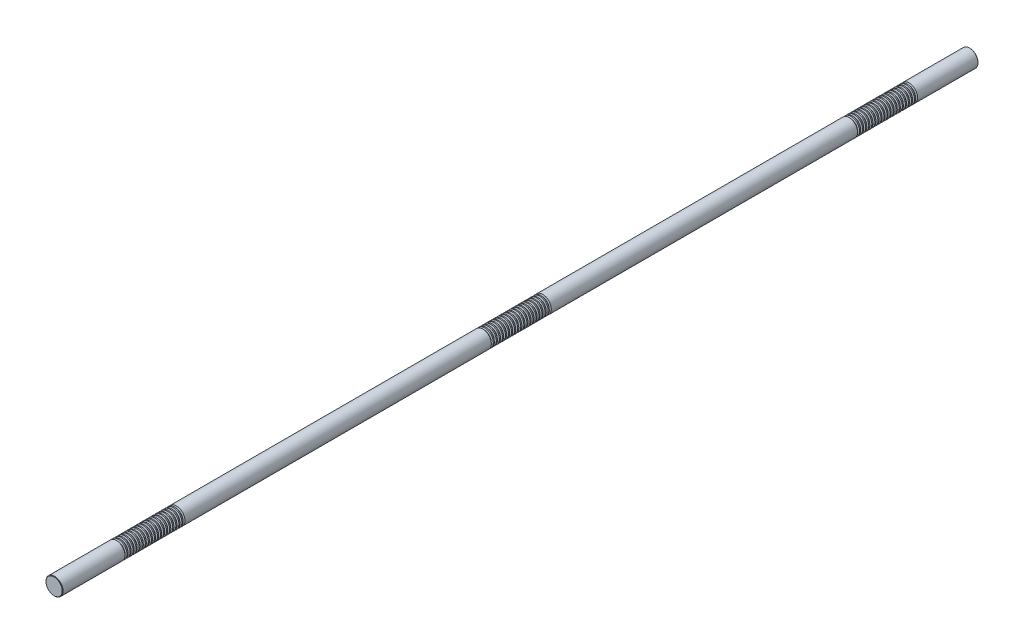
ISO-10303-21;
HEADER;
FILE_DESCRIPTION(('STEP AP214'),'2;1');
FILE_NAME('part.step','',(''),(''),'','','');
FILE_SCHEMA(('AUTOMOTIVE_DESIGN { 1 0 10303 214 1 1 1 1 }'));
ENDSEC;
DATA;
#1=APPLICATION_CONTEXT('core data for automotive mechanical design processes');
#2=APPLICATION_PROTOCOL_DEFINITION('international standard','automotive_design',2000,#1);
#3=PRODUCT_CONTEXT('',#1,'mechanical');
#4=PRODUCT('Part','Part','',(#3));
#5=PRODUCT_RELATED_PRODUCT_CATEGORY('part','',(#4));
#6=PRODUCT_DEFINITION_FORMATION('','',#4);
#7=PRODUCT_DEFINITION_CONTEXT('part definition',#1,'design');
#8=PRODUCT_DEFINITION('design','',#6,#7);
#9=PRODUCT_DEFINITION_SHAPE('','',#8);
#10=(LENGTH_UNIT() NAMED_UNIT(*) SI_UNIT(.MILLI.,.METRE.));
#11=(NAMED_UNIT(*) PLANE_ANGLE_UNIT() SI_UNIT($,.RADIAN.));
#12=(NAMED_UNIT(*) SI_UNIT($,.STERADIAN.) SOLID_ANGLE_UNIT());
#13=UNCERTAINTY_MEASURE_WITH_UNIT(LENGTH_MEASURE(1.E-05),#10,'distance_accuracy_value','');
#14=(GEOMETRIC_REPRESENTATION_CONTEXT(3) GLOBAL_UNCERTAINTY_ASSIGNED_CONTEXT((#13)) GLOBAL_UNIT_ASSIGNED_CONTEXT((#10,
#11,#12)) REPRESENTATION_CONTEXT('',''));
#15=CARTESIAN_POINT('',(0.,0.,0.));
#16=DIRECTION('',(0.,0.,1.));
#17=DIRECTION('',(1.,0.,0.));
#18=AXIS2_PLACEMENT_3D('',#15,#16,#17);
#19=CARTESIAN_POINT('',(0.,0.,750.));
#20=DIRECTION('',(0.,0.,-1.));
#21=DIRECTION('',(-1.,0.,0.));
#22=AXIS2_PLACEMENT_3D('',#19,#20,#21);
#23=CYLINDRICAL_SURFACE('',#22,14.);
#24=CARTESIAN_POINT('',(0.,0.,642.868430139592));
#25=DIRECTION('',(0.,0.,1.));
#26=DIRECTION('',(1.,0.,0.));
#27=AXIS2_PLACEMENT_3D('',#24,#25,#26);
#28=CIRCLE('',#27,14.);
#29=CARTESIAN_POINT('',(14.,0.,642.868430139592));
#30=VERTEX_POINT('',#29);
#31=EDGE_CURVE('E994',#30,#30,#28,.T.);
#32=ORIENTED_EDGE('',*,*,#31,.T.);
#33=EDGE_LOOP('',(#32));
#34=FACE_BOUND('',#33,.T.);
#35=CARTESIAN_POINT('',(0.,0.,644.631569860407));
#36=DIRECTION('',(0.,0.,1.));
#37=DIRECTION('',(1.,0.,0.));
#38=AXIS2_PLACEMENT_3D('',#35,#36,#37);
#39=CIRCLE('',#38,14.);
#40=CARTESIAN_POINT('',(14.,0.,644.631569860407));
#41=VERTEX_POINT('',#40);
#42=EDGE_CURVE('E1006',#41,#41,#39,.T.);
#43=ORIENTED_EDGE('',*,*,#42,.F.);
#44=EDGE_LOOP('',(#43));
#45=FACE_BOUND('',#44,.T.);
#46=ADVANCED_FACE('F37',(#34,#45),#23,.T.);
#47=CARTESIAN_POINT('',(0.,0.,637.868430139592));
#48=DIRECTION('',(0.,0.,1.));
#49=DIRECTION('',(1.,0.,0.));
#50=AXIS2_PLACEMENT_3D('',#47,#48,#49);
#51=CIRCLE('',#50,14.);
#52=CARTESIAN_POINT('',(14.,0.,637.868430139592));
#53=VERTEX_POINT('',#52);
#54=EDGE_CURVE('E978',#53,#53,#51,.T.);
#55=ORIENTED_EDGE('',*,*,#54,.T.);
#56=EDGE_LOOP('',(#55));
#57=FACE_BOUND('',#56,.T.);
#58=CARTESIAN_POINT('',(0.,0.,639.631569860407));
#59=DIRECTION('',(0.,0.,1.));
#60=DIRECTION('',(1.,0.,0.));
#61=AXIS2_PLACEMENT_3D('',#58,#59,#60);
#62=CIRCLE('',#61,14.);
#63=CARTESIAN_POINT('',(14.,0.,639.631569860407));
#64=VERTEX_POINT('',#63);
#65=EDGE_CURVE('E990',#64,#64,#62,.T.);
#66=ORIENTED_EDGE('',*,*,#65,.F.);
#67=EDGE_LOOP('',(#66));
#68=FACE_BOUND('',#67,.T.);
#69=ADVANCED_FACE('F1041',(#57,#68),#23,.T.);
#70=CARTESIAN_POINT('',(0.,0.,632.868430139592));
#71=DIRECTION('',(0.,0.,1.));
#72=DIRECTION('',(1.,0.,0.));
#73=AXIS2_PLACEMENT_3D('',#70,#71,#72);
#74=CIRCLE('',#73,14.);
#75=CARTESIAN_POINT('',(14.,0.,632.868430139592));
#76=VERTEX_POINT('',#75);
#77=EDGE_CURVE('E962',#76,#76,#74,.T.);
#78=ORIENTED_EDGE('',*,*,#77,.T.);
#79=EDGE_LOOP('',(#78));
#80=FACE_BOUND('',#79,.T.);
#81=CARTESIAN_POINT('',(0.,0.,634.631569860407));
#82=DIRECTION('',(0.,0.,1.));
#83=DIRECTION('',(1.,0.,0.));
#84=AXIS2_PLACEMENT_3D('',#81,#82,#83);
#85=CIRCLE('',#84,14.);
#86=CARTESIAN_POINT('',(14.,0.,634.631569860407));
#87=VERTEX_POINT('',#86);
#88=EDGE_CURVE('E974',#87,#87,#85,.T.);
#89=ORIENTED_EDGE('',*,*,#88,.F.);
#90=EDGE_LOOP('',(#89));
#91=FACE_BOUND('',#90,.T.);
#92=ADVANCED_FACE('F1049',(#80,#91),#23,.T.);
#93=CARTESIAN_POINT('',(0.,0.,627.868430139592));
#94=DIRECTION('',(0.,0.,1.));
#95=DIRECTION('',(1.,0.,0.));
#96=AXIS2_PLACEMENT_3D('',#93,#94,#95);
#97=CIRCLE('',#96,14.);
#98=CARTESIAN_POINT('',(14.,0.,627.868430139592));
#99=VERTEX_POINT('',#98);
#100=EDGE_CURVE('E946',#99,#99,#97,.T.);
#101=ORIENTED_EDGE('',*,*,#100,.T.);
#102=EDGE_LOOP('',(#101));
#103=FACE_BOUND('',#102,.T.);
#104=CARTESIAN_POINT('',(0.,0.,629.631569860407));
#105=DIRECTION('',(0.,0.,1.));
#106=DIRECTION('',(1.,0.,0.));
#107=AXIS2_PLACEMENT_3D('',#104,#105,#106);
#108=CIRCLE('',#107,14.);
#109=CARTESIAN_POINT('',(14.,0.,629.631569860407));
#110=VERTEX_POINT('',#109);
#111=EDGE_CURVE('E958',#110,#110,#108,.T.);
#112=ORIENTED_EDGE('',*,*,#111,.F.);
#113=EDGE_LOOP('',(#112));
#114=FACE_BOUND('',#113,.T.);
#115=ADVANCED_FACE('F2332',(#103,#114),#23,.T.);
#116=CARTESIAN_POINT('',(0.,0.,622.868430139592));
#117=DIRECTION('',(0.,0.,1.));
#118=DIRECTION('',(1.,0.,0.));
#119=AXIS2_PLACEMENT_3D('',#116,#117,#118);
#120=CIRCLE('',#119,14.);
#121=CARTESIAN_POINT('',(14.,0.,622.868430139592));
#122=VERTEX_POINT('',#121);
#123=EDGE_CURVE('E930',#122,#122,#120,.T.);
#124=ORIENTED_EDGE('',*,*,#123,.T.);
#125=EDGE_LOOP('',(#124));
#126=FACE_BOUND('',#125,.T.);
#127=CARTESIAN_POINT('',(0.,0.,624.631569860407));
#128=DIRECTION('',(0.,0.,1.));
#129=DIRECTION('',(1.,0.,0.));
#130=AXIS2_PLACEMENT_3D('',#127,#128,#129);
#131=CIRCLE('',#130,14.);
#132=CARTESIAN_POINT('',(14.,0.,624.631569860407));
#133=VERTEX_POINT('',#132);
#134=EDGE_CURVE('E942',#133,#133,#131,.T.);
#135=ORIENTED_EDGE('',*,*,#134,.F.);
#136=EDGE_LOOP('',(#135));
#137=FACE_BOUND('',#136,.T.);
#138=ADVANCED_FACE('F2309',(#126,#137),#23,.T.);
#139=CARTESIAN_POINT('',(0.,0.,617.868430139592));
#140=DIRECTION('',(0.,0.,1.));
#141=DIRECTION('',(1.,0.,0.));
#142=AXIS2_PLACEMENT_3D('',#139,#140,#141);
#143=CIRCLE('',#142,14.);
#144=CARTESIAN_POINT('',(14.,0.,617.868430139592));
#145=VERTEX_POINT('',#144);
#146=EDGE_CURVE('E914',#145,#145,#143,.T.);
#147=ORIENTED_EDGE('',*,*,#146,.T.);
#148=EDGE_LOOP('',(#147));
#149=FACE_BOUND('',#148,.T.);
#150=CARTESIAN_POINT('',(0.,0.,619.631569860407));
#151=DIRECTION('',(0.,0.,1.));
#152=DIRECTION('',(1.,0.,0.));
#153=AXIS2_PLACEMENT_3D('',#150,#151,#152);
#154=CIRCLE('',#153,14.);
#155=CARTESIAN_POINT('',(14.,0.,619.631569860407));
#156=VERTEX_POINT('',#155);
#157=EDGE_CURVE('E926',#156,#156,#154,.T.);
#158=ORIENTED_EDGE('',*,*,#157,.F.);
#159=EDGE_LOOP('',(#158));
#160=FACE_BOUND('',#159,.T.);
#161=ADVANCED_FACE('F2286',(#149,#160),#23,.T.);
#162=CARTESIAN_POINT('',(0.,0.,612.868430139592));
#163=DIRECTION('',(0.,0.,1.));
#164=DIRECTION('',(1.,0.,0.));
#165=AXIS2_PLACEMENT_3D('',#162,#163,#164);
#166=CIRCLE('',#165,14.);
#167=CARTESIAN_POINT('',(14.,0.,612.868430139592));
#168=VERTEX_POINT('',#167);
#169=EDGE_CURVE('E898',#168,#168,#166,.T.);
#170=ORIENTED_EDGE('',*,*,#169,.T.);
#171=EDGE_LOOP('',(#170));
#172=FACE_BOUND('',#171,.T.);
#173=CARTESIAN_POINT('',(0.,0.,614.631569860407));
#174=DIRECTION('',(0.,0.,1.));
#175=DIRECTION('',(1.,0.,0.));
#176=AXIS2_PLACEMENT_3D('',#173,#174,#175);
#177=CIRCLE('',#176,14.);
#178=CARTESIAN_POINT('',(14.,0.,614.631569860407));
#179=VERTEX_POINT('',#178);
#180=EDGE_CURVE('E910',#179,#179,#177,.T.);
#181=ORIENTED_EDGE('',*,*,#180,.F.);
#182=EDGE_LOOP('',(#181));
#183=FACE_BOUND('',#182,.T.);
#184=ADVANCED_FACE('F2263',(#172,#183),#23,.T.);
#185=CARTESIAN_POINT('',(0.,0.,607.868430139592));
#186=DIRECTION('',(0.,0.,1.));
#187=DIRECTION('',(1.,0.,0.));
#188=AXIS2_PLACEMENT_3D('',#185,#186,#187);
#189=CIRCLE('',#188,14.);
#190=CARTESIAN_POINT('',(14.,0.,607.868430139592));
#191=VERTEX_POINT('',#190);
#192=EDGE_CURVE('E882',#191,#191,#189,.T.);
#193=ORIENTED_EDGE('',*,*,#192,.T.);
#194=EDGE_LOOP('',(#193));
#195=FACE_BOUND('',#194,.T.);
#196=CARTESIAN_POINT('',(0.,0.,609.631569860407));
#197=DIRECTION('',(0.,0.,1.));
#198=DIRECTION('',(1.,0.,0.));
#199=AXIS2_PLACEMENT_3D('',#196,#197,#198);
#200=CIRCLE('',#199,14.);
#201=CARTESIAN_POINT('',(14.,0.,609.631569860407));
#202=VERTEX_POINT('',#201);
#203=EDGE_CURVE('E894',#202,#202,#200,.T.);
#204=ORIENTED_EDGE('',*,*,#203,.F.);
#205=EDGE_LOOP('',(#204));
#206=FACE_BOUND('',#205,.T.);
#207=ADVANCED_FACE('F2240',(#195,#206),#23,.T.);
#208=CARTESIAN_POINT('',(0.,0.,602.868430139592));
#209=DIRECTION('',(0.,0.,1.));
#210=DIRECTION('',(1.,0.,0.));
#211=AXIS2_PLACEMENT_3D('',#208,#209,#210);
#212=CIRCLE('',#211,14.);
#213=CARTESIAN_POINT('',(14.,0.,602.868430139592));
#214=VERTEX_POINT('',#213);
#215=EDGE_CURVE('E866',#214,#214,#212,.T.);
#216=ORIENTED_EDGE('',*,*,#215,.T.);
#217=EDGE_LOOP('',(#216));
#218=FACE_BOUND('',#217,.T.);
#219=CARTESIAN_POINT('',(0.,0.,604.631569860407));
#220=DIRECTION('',(0.,0.,1.));
#221=DIRECTION('',(1.,0.,0.));
#222=AXIS2_PLACEMENT_3D('',#219,#220,#221);
#223=CIRCLE('',#222,14.);
#224=CARTESIAN_POINT('',(14.,0.,604.631569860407));
#225=VERTEX_POINT('',#224);
#226=EDGE_CURVE('E878',#225,#225,#223,.T.);
#227=ORIENTED_EDGE('',*,*,#226,.F.);
#228=EDGE_LOOP('',(#227));
#229=FACE_BOUND('',#228,.T.);
#230=ADVANCED_FACE('F2217',(#218,#229),#23,.T.);
#231=CARTESIAN_POINT('',(0.,0.,597.868430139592));
#232=DIRECTION('',(0.,0.,1.));
#233=DIRECTION('',(1.,0.,0.));
#234=AXIS2_PLACEMENT_3D('',#231,#232,#233);
#235=CIRCLE('',#234,14.);
#236=CARTESIAN_POINT('',(14.,0.,597.868430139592));
#237=VERTEX_POINT('',#236);
#238=EDGE_CURVE('E850',#237,#237,#235,.T.);
#239=ORIENTED_EDGE('',*,*,#238,.T.);
#240=EDGE_LOOP('',(#239));
#241=FACE_BOUND('',#240,.T.);
#242=CARTESIAN_POINT('',(0.,0.,599.631569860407));
#243=DIRECTION('',(0.,0.,1.));
#244=DIRECTION('',(1.,0.,0.));
#245=AXIS2_PLACEMENT_3D('',#242,#243,#244);
#246=CIRCLE('',#245,14.);
#247=CARTESIAN_POINT('',(14.,0.,599.631569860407));
#248=VERTEX_POINT('',#247);
#249=EDGE_CURVE('E862',#248,#248,#246,.T.);
#250=ORIENTED_EDGE('',*,*,#249,.F.);
#251=EDGE_LOOP('',(#250));
#252=FACE_BOUND('',#251,.T.);
#253=ADVANCED_FACE('F2194',(#241,#252),#23,.T.);
#254=CARTESIAN_POINT('',(0.,0.,592.868430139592));
#255=DIRECTION('',(0.,0.,1.));
#256=DIRECTION('',(1.,0.,0.));
#257=AXIS2_PLACEMENT_3D('',#254,#255,#256);
#258=CIRCLE('',#257,14.);
#259=CARTESIAN_POINT('',(14.,0.,592.868430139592));
#260=VERTEX_POINT('',#259);
#261=EDGE_CURVE('E834',#260,#260,#258,.T.);
#262=ORIENTED_EDGE('',*,*,#261,.T.);
#263=EDGE_LOOP('',(#262));
#264=FACE_BOUND('',#263,.T.);
#265=CARTESIAN_POINT('',(0.,0.,594.631569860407));
#266=DIRECTION('',(0.,0.,1.));
#267=DIRECTION('',(1.,0.,0.));
#268=AXIS2_PLACEMENT_3D('',#265,#266,#267);
#269=CIRCLE('',#268,14.);
#270=CARTESIAN_POINT('',(14.,0.,594.631569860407));
#271=VERTEX_POINT('',#270);
#272=EDGE_CURVE('E846',#271,#271,#269,.T.);
#273=ORIENTED_EDGE('',*,*,#272,.F.);
#274=EDGE_LOOP('',(#273));
#275=FACE_BOUND('',#274,.T.);
#276=ADVANCED_FACE('F2171',(#264,#275),#23,.T.);
#277=CARTESIAN_POINT('',(0.,0.,587.868430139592));
#278=DIRECTION('',(0.,0.,1.));
#279=DIRECTION('',(1.,0.,0.));
#280=AXIS2_PLACEMENT_3D('',#277,#278,#279);
#281=CIRCLE('',#280,14.);
#282=CARTESIAN_POINT('',(14.,0.,587.868430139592));
#283=VERTEX_POINT('',#282);
#284=EDGE_CURVE('E818',#283,#283,#281,.T.);
#285=ORIENTED_EDGE('',*,*,#284,.T.);
#286=EDGE_LOOP('',(#285));
#287=FACE_BOUND('',#286,.T.);
#288=CARTESIAN_POINT('',(0.,0.,589.631569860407));
#289=DIRECTION('',(0.,0.,1.));
#290=DIRECTION('',(1.,0.,0.));
#291=AXIS2_PLACEMENT_3D('',#288,#289,#290);
#292=CIRCLE('',#291,14.);
#293=CARTESIAN_POINT('',(14.,0.,589.631569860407));
#294=VERTEX_POINT('',#293);
#295=EDGE_CURVE('E830',#294,#294,#292,.T.);
#296=ORIENTED_EDGE('',*,*,#295,.F.);
#297=EDGE_LOOP('',(#296));
#298=FACE_BOUND('',#297,.T.);
#299=ADVANCED_FACE('F2148',(#287,#298),#23,.T.);
#300=CARTESIAN_POINT('',(0.,0.,582.868430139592));
#301=DIRECTION('',(0.,0.,1.));
#302=DIRECTION('',(1.,0.,0.));
#303=AXIS2_PLACEMENT_3D('',#300,#301,#302);
#304=CIRCLE('',#303,14.);
#305=CARTESIAN_POINT('',(14.,0.,582.868430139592));
#306=VERTEX_POINT('',#305);
#307=EDGE_CURVE('E802',#306,#306,#304,.T.);
#308=ORIENTED_EDGE('',*,*,#307,.T.);
#309=EDGE_LOOP('',(#308));
#310=FACE_BOUND('',#309,.T.);
#311=CARTESIAN_POINT('',(0.,0.,584.631569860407));
#312=DIRECTION('',(0.,0.,1.));
#313=DIRECTION('',(1.,0.,0.));
#314=AXIS2_PLACEMENT_3D('',#311,#312,#313);
#315=CIRCLE('',#314,14.);
#316=CARTESIAN_POINT('',(14.,0.,584.631569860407));
#317=VERTEX_POINT('',#316);
#318=EDGE_CURVE('E814',#317,#317,#315,.T.);
#319=ORIENTED_EDGE('',*,*,#318,.F.);
#320=EDGE_LOOP('',(#319));
#321=FACE_BOUND('',#320,.T.);
#322=ADVANCED_FACE('F2125',(#310,#321),#23,.T.);
#323=CARTESIAN_POINT('',(0.,0.,577.868430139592));
#324=DIRECTION('',(0.,0.,1.));
#325=DIRECTION('',(1.,0.,0.));
#326=AXIS2_PLACEMENT_3D('',#323,#324,#325);
#327=CIRCLE('',#326,14.);
#328=CARTESIAN_POINT('',(14.,0.,577.868430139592));
#329=VERTEX_POINT('',#328);
#330=EDGE_CURVE('E787',#329,#329,#327,.T.);
#331=ORIENTED_EDGE('',*,*,#330,.T.);
#332=EDGE_LOOP('',(#331));
#333=FACE_BOUND('',#332,.T.);
#334=CARTESIAN_POINT('',(0.,0.,579.631569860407));
#335=DIRECTION('',(0.,0.,1.));
#336=DIRECTION('',(1.,0.,0.));
#337=AXIS2_PLACEMENT_3D('',#334,#335,#336);
#338=CIRCLE('',#337,14.);
#339=CARTESIAN_POINT('',(14.,0.,579.631569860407));
#340=VERTEX_POINT('',#339);
#341=EDGE_CURVE('E799',#340,#340,#338,.T.);
#342=ORIENTED_EDGE('',*,*,#341,.F.);
#343=EDGE_LOOP('',(#342));
#344=FACE_BOUND('',#343,.T.);
#345=ADVANCED_FACE('F2102',(#333,#344),#23,.T.);
#346=CARTESIAN_POINT('',(0.,0.,572.868430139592));
#347=DIRECTION('',(0.,0.,1.));
#348=DIRECTION('',(1.,0.,0.));
#349=AXIS2_PLACEMENT_3D('',#346,#347,#348);
#350=CIRCLE('',#349,14.);
#351=CARTESIAN_POINT('',(14.,0.,572.868430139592));
#352=VERTEX_POINT('',#351);
#353=EDGE_CURVE('E771',#352,#352,#350,.T.);
#354=ORIENTED_EDGE('',*,*,#353,.T.);
#355=EDGE_LOOP('',(#354));
#356=FACE_BOUND('',#355,.T.);
#357=CARTESIAN_POINT('',(0.,0.,574.631569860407));
#358=DIRECTION('',(0.,0.,1.));
#359=DIRECTION('',(1.,0.,0.));
#360=AXIS2_PLACEMENT_3D('',#357,#358,#359);
#361=CIRCLE('',#360,14.);
#362=CARTESIAN_POINT('',(14.,0.,574.631569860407));
#363=VERTEX_POINT('',#362);
#364=EDGE_CURVE('E783',#363,#363,#361,.T.);
#365=ORIENTED_EDGE('',*,*,#364,.F.);
#366=EDGE_LOOP('',(#365));
#367=FACE_BOUND('',#366,.T.);
#368=ADVANCED_FACE('F2079',(#356,#367),#23,.T.);
#369=CARTESIAN_POINT('',(0.,0.,567.868430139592));
#370=DIRECTION('',(0.,0.,1.));
#371=DIRECTION('',(1.,0.,0.));
#372=AXIS2_PLACEMENT_3D('',#369,#370,#371);
#373=CIRCLE('',#372,14.);
#374=CARTESIAN_POINT('',(14.,0.,567.868430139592));
#375=VERTEX_POINT('',#374);
#376=EDGE_CURVE('E755',#375,#375,#373,.T.);
#377=ORIENTED_EDGE('',*,*,#376,.T.);
#378=EDGE_LOOP('',(#377));
#379=FACE_BOUND('',#378,.T.);
#380=CARTESIAN_POINT('',(0.,0.,569.631569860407));
#381=DIRECTION('',(0.,0.,1.));
#382=DIRECTION('',(1.,0.,0.));
#383=AXIS2_PLACEMENT_3D('',#380,#381,#382);
#384=CIRCLE('',#383,14.);
#385=CARTESIAN_POINT('',(14.,0.,569.631569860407));
#386=VERTEX_POINT('',#385);
#387=EDGE_CURVE('E767',#386,#386,#384,.T.);
#388=ORIENTED_EDGE('',*,*,#387,.F.);
#389=EDGE_LOOP('',(#388));
#390=FACE_BOUND('',#389,.T.);
#391=ADVANCED_FACE('F2056',(#379,#390),#23,.T.);
#392=CARTESIAN_POINT('',(0.,0.,562.868430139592));
#393=DIRECTION('',(0.,0.,1.));
#394=DIRECTION('',(1.,0.,0.));
#395=AXIS2_PLACEMENT_3D('',#392,#393,#394);
#396=CIRCLE('',#395,14.);
#397=CARTESIAN_POINT('',(14.,0.,562.868430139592));
#398=VERTEX_POINT('',#397);
#399=EDGE_CURVE('E739',#398,#398,#396,.T.);
#400=ORIENTED_EDGE('',*,*,#399,.T.);
#401=EDGE_LOOP('',(#400));
#402=FACE_BOUND('',#401,.T.);
#403=CARTESIAN_POINT('',(0.,0.,564.631569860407));
#404=DIRECTION('',(0.,0.,1.));
#405=DIRECTION('',(1.,0.,0.));
#406=AXIS2_PLACEMENT_3D('',#403,#404,#405);
#407=CIRCLE('',#406,14.);
#408=CARTESIAN_POINT('',(14.,0.,564.631569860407));
#409=VERTEX_POINT('',#408);
#410=EDGE_CURVE('E751',#409,#409,#407,.T.);
#411=ORIENTED_EDGE('',*,*,#410,.F.);
#412=EDGE_LOOP('',(#411));
#413=FACE_BOUND('',#412,.T.);
#414=ADVANCED_FACE('F2033',(#402,#413),#23,.T.);
#415=CARTESIAN_POINT('',(0.,0.,557.868430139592));
#416=DIRECTION('',(0.,0.,1.));
#417=DIRECTION('',(1.,0.,0.));
#418=AXIS2_PLACEMENT_3D('',#415,#416,#417);
#419=CIRCLE('',#418,14.);
#420=CARTESIAN_POINT('',(14.,0.,557.868430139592));
#421=VERTEX_POINT('',#420);
#422=EDGE_CURVE('E723',#421,#421,#419,.T.);
#423=ORIENTED_EDGE('',*,*,#422,.T.);
#424=EDGE_LOOP('',(#423));
#425=FACE_BOUND('',#424,.T.);
#426=CARTESIAN_POINT('',(0.,0.,559.631569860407));
#427=DIRECTION('',(0.,0.,1.));
#428=DIRECTION('',(1.,0.,0.));
#429=AXIS2_PLACEMENT_3D('',#426,#427,#428);
#430=CIRCLE('',#429,14.);
#431=CARTESIAN_POINT('',(14.,0.,559.631569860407));
#432=VERTEX_POINT('',#431);
#433=EDGE_CURVE('E735',#432,#432,#430,.T.);
#434=ORIENTED_EDGE('',*,*,#433,.F.);
#435=EDGE_LOOP('',(#434));
#436=FACE_BOUND('',#435,.T.);
#437=ADVANCED_FACE('F2014',(#425,#436),#23,.T.);
#438=CARTESIAN_POINT('',(0.,0.,552.868430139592));
#439=DIRECTION('',(0.,0.,1.));
#440=DIRECTION('',(1.,0.,0.));
#441=AXIS2_PLACEMENT_3D('',#438,#439,#440);
#442=CIRCLE('',#441,14.);
#443=CARTESIAN_POINT('',(14.,0.,552.868430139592));
#444=VERTEX_POINT('',#443);
#445=EDGE_CURVE('E403',#444,#444,#442,.T.);
#446=ORIENTED_EDGE('',*,*,#445,.T.);
#447=EDGE_LOOP('',(#446));
#448=FACE_BOUND('',#447,.T.);
#449=CARTESIAN_POINT('',(0.,0.,554.631569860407));
#450=DIRECTION('',(0.,0.,1.));
#451=DIRECTION('',(1.,0.,0.));
#452=AXIS2_PLACEMENT_3D('',#449,#450,#451);
#453=CIRCLE('',#452,14.);
#454=CARTESIAN_POINT('',(14.,0.,554.631569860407));
#455=VERTEX_POINT('',#454);
#456=EDGE_CURVE('E719',#455,#455,#453,.T.);
#457=ORIENTED_EDGE('',*,*,#456,.F.);
#458=EDGE_LOOP('',(#457));
#459=FACE_BOUND('',#458,.T.);
#460=ADVANCED_FACE('F1963',(#448,#459),#23,.T.);
#461=CARTESIAN_POINT('',(0.,0.,42.8684301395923));
#462=DIRECTION('',(0.,0.,1.));
#463=DIRECTION('',(1.,0.,0.));
#464=AXIS2_PLACEMENT_3D('',#461,#462,#463);
#465=CIRCLE('',#464,14.);
#466=CARTESIAN_POINT('',(14.,0.,42.8684301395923));
#467=VERTEX_POINT('',#466);
#468=EDGE_CURVE('E691',#467,#467,#465,.T.);
#469=ORIENTED_EDGE('',*,*,#468,.T.);
#470=EDGE_LOOP('',(#469));
#471=FACE_BOUND('',#470,.T.);
#472=CARTESIAN_POINT('',(0.,0.,44.6315698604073));
#473=DIRECTION('',(0.,0.,1.));
#474=DIRECTION('',(1.,0.,0.));
#475=AXIS2_PLACEMENT_3D('',#472,#473,#474);
#476=CIRCLE('',#475,14.);
#477=CARTESIAN_POINT('',(14.,0.,44.6315698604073));
#478=VERTEX_POINT('',#477);
#479=EDGE_CURVE('E703',#478,#478,#476,.T.);
#480=ORIENTED_EDGE('',*,*,#479,.F.);
#481=EDGE_LOOP('',(#480));
#482=FACE_BOUND('',#481,.T.);
#483=ADVANCED_FACE('F1939',(#471,#482),#23,.T.);
#484=CARTESIAN_POINT('',(0.,0.,37.8684301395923));
#485=DIRECTION('',(0.,0.,1.));
#486=DIRECTION('',(1.,0.,0.));
#487=AXIS2_PLACEMENT_3D('',#484,#485,#486);
#488=CIRCLE('',#487,14.);
#489=CARTESIAN_POINT('',(14.,0.,37.8684301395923));
#490=VERTEX_POINT('',#489);
#491=EDGE_CURVE('E675',#490,#490,#488,.T.);
#492=ORIENTED_EDGE('',*,*,#491,.T.);
#493=EDGE_LOOP('',(#492));
#494=FACE_BOUND('',#493,.T.);
#495=CARTESIAN_POINT('',(0.,0.,39.6315698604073));
#496=DIRECTION('',(0.,0.,1.));
#497=DIRECTION('',(1.,0.,0.));
#498=AXIS2_PLACEMENT_3D('',#495,#496,#497);
#499=CIRCLE('',#498,14.);
#500=CARTESIAN_POINT('',(14.,0.,39.6315698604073));
#501=VERTEX_POINT('',#500);
#502=EDGE_CURVE('E687',#501,#501,#499,.T.);
#503=ORIENTED_EDGE('',*,*,#502,.F.);
#504=EDGE_LOOP('',(#503));
#505=FACE_BOUND('',#504,.T.);
#506=ADVANCED_FACE('F1916',(#494,#505),#23,.T.);
#507=CARTESIAN_POINT('',(0.,0.,32.8684301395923));
#508=DIRECTION('',(0.,0.,1.));
#509=DIRECTION('',(1.,0.,0.));
#510=AXIS2_PLACEMENT_3D('',#507,#508,#509);
#511=CIRCLE('',#510,14.);
#512=CARTESIAN_POINT('',(14.,0.,32.8684301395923));
#513=VERTEX_POINT('',#512);
#514=EDGE_CURVE('E659',#513,#513,#511,.T.);
#515=ORIENTED_EDGE('',*,*,#514,.T.);
#516=EDGE_LOOP('',(#515));
#517=FACE_BOUND('',#516,.T.);
#518=CARTESIAN_POINT('',(0.,0.,34.6315698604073));
#519=DIRECTION('',(0.,0.,1.));
#520=DIRECTION('',(1.,0.,0.));
#521=AXIS2_PLACEMENT_3D('',#518,#519,#520);
#522=CIRCLE('',#521,14.);
#523=CARTESIAN_POINT('',(14.,0.,34.6315698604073));
#524=VERTEX_POINT('',#523);
#525=EDGE_CURVE('E671',#524,#524,#522,.T.);
#526=ORIENTED_EDGE('',*,*,#525,.F.);
#527=EDGE_LOOP('',(#526));
#528=FACE_BOUND('',#527,.T.);
#529=ADVANCED_FACE('F1893',(#517,#528),#23,.T.);
#530=CARTESIAN_POINT('',(0.,0.,27.8684301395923));
#531=DIRECTION('',(0.,0.,1.));
#532=DIRECTION('',(1.,0.,0.));
#533=AXIS2_PLACEMENT_3D('',#530,#531,#532);
#534=CIRCLE('',#533,14.);
#535=CARTESIAN_POINT('',(14.,0.,27.8684301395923));
#536=VERTEX_POINT('',#535);
#537=EDGE_CURVE('E643',#536,#536,#534,.T.);
#538=ORIENTED_EDGE('',*,*,#537,.T.);
#539=EDGE_LOOP('',(#538));
#540=FACE_BOUND('',#539,.T.);
#541=CARTESIAN_POINT('',(0.,0.,29.6315698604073));
#542=DIRECTION('',(0.,0.,1.));
#543=DIRECTION('',(1.,0.,0.));
#544=AXIS2_PLACEMENT_3D('',#541,#542,#543);
#545=CIRCLE('',#544,14.);
#546=CARTESIAN_POINT('',(14.,0.,29.6315698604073));
#547=VERTEX_POINT('',#546);
#548=EDGE_CURVE('E655',#547,#547,#545,.T.);
#549=ORIENTED_EDGE('',*,*,#548,.F.);
#550=EDGE_LOOP('',(#549));
#551=FACE_BOUND('',#550,.T.);
#552=ADVANCED_FACE('F1870',(#540,#551),#23,.T.);
#553=CARTESIAN_POINT('',(0.,0.,22.8684301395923));
#554=DIRECTION('',(0.,0.,1.));
#555=DIRECTION('',(1.,0.,0.));
#556=AXIS2_PLACEMENT_3D('',#553,#554,#555);
#557=CIRCLE('',#556,14.);
#558=CARTESIAN_POINT('',(14.,0.,22.8684301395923));
#559=VERTEX_POINT('',#558);
#560=EDGE_CURVE('E627',#559,#559,#557,.T.);
#561=ORIENTED_EDGE('',*,*,#560,.T.);
#562=EDGE_LOOP('',(#561));
#563=FACE_BOUND('',#562,.T.);
#564=CARTESIAN_POINT('',(0.,0.,24.6315698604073));
#565=DIRECTION('',(0.,0.,1.));
#566=DIRECTION('',(1.,0.,0.));
#567=AXIS2_PLACEMENT_3D('',#564,#565,#566);
#568=CIRCLE('',#567,14.);
#569=CARTESIAN_POINT('',(14.,0.,24.6315698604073));
#570=VERTEX_POINT('',#569);
#571=EDGE_CURVE('E639',#570,#570,#568,.T.);
#572=ORIENTED_EDGE('',*,*,#571,.F.);
#573=EDGE_LOOP('',(#572));
#574=FACE_BOUND('',#573,.T.);
#575=ADVANCED_FACE('F1847',(#563,#574),#23,.T.);
#576=CARTESIAN_POINT('',(0.,0.,17.8684301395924));
#577=DIRECTION('',(0.,0.,1.));
#578=DIRECTION('',(1.,0.,0.));
#579=AXIS2_PLACEMENT_3D('',#576,#577,#578);
#580=CIRCLE('',#579,14.);
#581=CARTESIAN_POINT('',(14.,0.,17.8684301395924));
#582=VERTEX_POINT('',#581);
#583=EDGE_CURVE('E611',#582,#582,#580,.T.);
#584=ORIENTED_EDGE('',*,*,#583,.T.);
#585=EDGE_LOOP('',(#584));
#586=FACE_BOUND('',#585,.T.);
#587=CARTESIAN_POINT('',(0.,0.,19.6315698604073));
#588=DIRECTION('',(0.,0.,1.));
#589=DIRECTION('',(1.,0.,0.));
#590=AXIS2_PLACEMENT_3D('',#587,#588,#589);
#591=CIRCLE('',#590,14.);
#592=CARTESIAN_POINT('',(14.,0.,19.6315698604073));
#593=VERTEX_POINT('',#592);
#594=EDGE_CURVE('E623',#593,#593,#591,.T.);
#595=ORIENTED_EDGE('',*,*,#594,.F.);
#596=EDGE_LOOP('',(#595));
#597=FACE_BOUND('',#596,.T.);
#598=ADVANCED_FACE('F1824',(#586,#597),#23,.T.);
#599=CARTESIAN_POINT('',(0.,0.,12.8684301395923));
#600=DIRECTION('',(0.,0.,1.));
#601=DIRECTION('',(1.,0.,0.));
#602=AXIS2_PLACEMENT_3D('',#599,#600,#601);
#603=CIRCLE('',#602,14.);
#604=CARTESIAN_POINT('',(14.,0.,12.8684301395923));
#605=VERTEX_POINT('',#604);
#606=EDGE_CURVE('E595',#605,#605,#603,.T.);
#607=ORIENTED_EDGE('',*,*,#606,.T.);
#608=EDGE_LOOP('',(#607));
#609=FACE_BOUND('',#608,.T.);
#610=CARTESIAN_POINT('',(0.,0.,14.6315698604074));
#611=DIRECTION('',(0.,0.,1.));
#612=DIRECTION('',(1.,0.,0.));
#613=AXIS2_PLACEMENT_3D('',#610,#611,#612);
#614=CIRCLE('',#613,14.);
#615=CARTESIAN_POINT('',(14.,0.,14.6315698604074));
#616=VERTEX_POINT('',#615);
#617=EDGE_CURVE('E607',#616,#616,#614,.T.);
#618=ORIENTED_EDGE('',*,*,#617,.F.);
#619=EDGE_LOOP('',(#618));
#620=FACE_BOUND('',#619,.T.);
#621=ADVANCED_FACE('F1801',(#609,#620),#23,.T.);
#622=CARTESIAN_POINT('',(0.,0.,7.86843013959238));
#623=DIRECTION('',(0.,0.,1.));
#624=DIRECTION('',(1.,0.,0.));
#625=AXIS2_PLACEMENT_3D('',#622,#623,#624);
#626=CIRCLE('',#625,14.);
#627=CARTESIAN_POINT('',(14.,0.,7.86843013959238));
#628=VERTEX_POINT('',#627);
#629=EDGE_CURVE('E579',#628,#628,#626,.T.);
#630=ORIENTED_EDGE('',*,*,#629,.T.);
#631=EDGE_LOOP('',(#630));
#632=FACE_BOUND('',#631,.T.);
#633=CARTESIAN_POINT('',(0.,0.,9.63156986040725));
#634=DIRECTION('',(0.,0.,1.));
#635=DIRECTION('',(1.,0.,0.));
#636=AXIS2_PLACEMENT_3D('',#633,#634,#635);
#637=CIRCLE('',#636,14.);
#638=CARTESIAN_POINT('',(14.,0.,9.63156986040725));
#639=VERTEX_POINT('',#638);
#640=EDGE_CURVE('E591',#639,#639,#637,.T.);
#641=ORIENTED_EDGE('',*,*,#640,.F.);
#642=EDGE_LOOP('',(#641));
#643=FACE_BOUND('',#642,.T.);
#644=ADVANCED_FACE('F1778',(#632,#643),#23,.T.);
#645=CARTESIAN_POINT('',(0.,0.,2.86843013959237));
#646=DIRECTION('',(0.,0.,1.));
#647=DIRECTION('',(1.,0.,0.));
#648=AXIS2_PLACEMENT_3D('',#645,#646,#647);
#649=CIRCLE('',#648,14.);
#650=CARTESIAN_POINT('',(14.,0.,2.86843013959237));
#651=VERTEX_POINT('',#650);
#652=EDGE_CURVE('E563',#651,#651,#649,.T.);
#653=ORIENTED_EDGE('',*,*,#652,.T.);
#654=EDGE_LOOP('',(#653));
#655=FACE_BOUND('',#654,.T.);
#656=CARTESIAN_POINT('',(0.,0.,4.63156986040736));
#657=DIRECTION('',(0.,0.,1.));
#658=DIRECTION('',(1.,0.,0.));
#659=AXIS2_PLACEMENT_3D('',#656,#657,#658);
#660=CIRCLE('',#659,14.);
#661=CARTESIAN_POINT('',(14.,0.,4.63156986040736));
#662=VERTEX_POINT('',#661);
#663=EDGE_CURVE('E575',#662,#662,#660,.T.);
#664=ORIENTED_EDGE('',*,*,#663,.F.);
#665=EDGE_LOOP('',(#664));
#666=FACE_BOUND('',#665,.T.);
#667=ADVANCED_FACE('F1755',(#655,#666),#23,.T.);
#668=CARTESIAN_POINT('',(0.,0.,-2.13156986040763));
#669=DIRECTION('',(0.,0.,1.));
#670=DIRECTION('',(1.,0.,0.));
#671=AXIS2_PLACEMENT_3D('',#668,#669,#670);
#672=CIRCLE('',#671,14.);
#673=CARTESIAN_POINT('',(14.,0.,-2.13156986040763));
#674=VERTEX_POINT('',#673);
#675=EDGE_CURVE('E547',#674,#674,#672,.T.);
#676=ORIENTED_EDGE('',*,*,#675,.T.);
#677=EDGE_LOOP('',(#676));
#678=FACE_BOUND('',#677,.T.);
#679=CARTESIAN_POINT('',(0.,0.,-0.368430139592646));
#680=DIRECTION('',(0.,0.,1.));
#681=DIRECTION('',(1.,0.,0.));
#682=AXIS2_PLACEMENT_3D('',#679,#680,#681);
#683=CIRCLE('',#682,14.);
#684=CARTESIAN_POINT('',(14.,0.,-0.368430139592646));
#685=VERTEX_POINT('',#684);
#686=EDGE_CURVE('E559',#685,#685,#683,.T.);
#687=ORIENTED_EDGE('',*,*,#686,.F.);
#688=EDGE_LOOP('',(#687));
#689=FACE_BOUND('',#688,.T.);
#690=ADVANCED_FACE('F1732',(#678,#689),#23,.T.);
#691=CARTESIAN_POINT('',(0.,0.,-7.13156986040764));
#692=DIRECTION('',(0.,0.,1.));
#693=DIRECTION('',(1.,0.,0.));
#694=AXIS2_PLACEMENT_3D('',#691,#692,#693);
#695=CIRCLE('',#694,14.);
#696=CARTESIAN_POINT('',(14.,0.,-7.13156986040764));
#697=VERTEX_POINT('',#696);
#698=EDGE_CURVE('E531',#697,#697,#695,.T.);
#699=ORIENTED_EDGE('',*,*,#698,.T.);
#700=EDGE_LOOP('',(#699));
#701=FACE_BOUND('',#700,.T.);
#702=CARTESIAN_POINT('',(0.,0.,-5.36843013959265));
#703=DIRECTION('',(0.,0.,1.));
#704=DIRECTION('',(1.,0.,0.));
#705=AXIS2_PLACEMENT_3D('',#702,#703,#704);
#706=CIRCLE('',#705,14.);
#707=CARTESIAN_POINT('',(14.,0.,-5.36843013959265));
#708=VERTEX_POINT('',#707);
#709=EDGE_CURVE('E543',#708,#708,#706,.T.);
#710=ORIENTED_EDGE('',*,*,#709,.F.);
#711=EDGE_LOOP('',(#710));
#712=FACE_BOUND('',#711,.T.);
#713=ADVANCED_FACE('F1709',(#701,#712),#23,.T.);
#714=CARTESIAN_POINT('',(0.,0.,-12.1315698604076));
#715=DIRECTION('',(0.,0.,1.));
#716=DIRECTION('',(1.,0.,0.));
#717=AXIS2_PLACEMENT_3D('',#714,#715,#716);
#718=CIRCLE('',#717,14.);
#719=CARTESIAN_POINT('',(14.,0.,-12.1315698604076));
#720=VERTEX_POINT('',#719);
#721=EDGE_CURVE('E515',#720,#720,#718,.T.);
#722=ORIENTED_EDGE('',*,*,#721,.T.);
#723=EDGE_LOOP('',(#722));
#724=FACE_BOUND('',#723,.T.);
#725=CARTESIAN_POINT('',(0.,0.,-10.3684301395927));
#726=DIRECTION('',(0.,0.,1.));
#727=DIRECTION('',(1.,0.,0.));
#728=AXIS2_PLACEMENT_3D('',#725,#726,#727);
#729=CIRCLE('',#728,14.);
#730=CARTESIAN_POINT('',(14.,0.,-10.3684301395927));
#731=VERTEX_POINT('',#730);
#732=EDGE_CURVE('E527',#731,#731,#729,.T.);
#733=ORIENTED_EDGE('',*,*,#732,.F.);
#734=EDGE_LOOP('',(#733));
#735=FACE_BOUND('',#734,.T.);
#736=ADVANCED_FACE('F1686',(#724,#735),#23,.T.);
#737=CARTESIAN_POINT('',(0.,0.,-17.1315698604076));
#738=DIRECTION('',(0.,0.,1.));
#739=DIRECTION('',(1.,0.,0.));
#740=AXIS2_PLACEMENT_3D('',#737,#738,#739);
#741=CIRCLE('',#740,14.);
#742=CARTESIAN_POINT('',(14.,0.,-17.1315698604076));
#743=VERTEX_POINT('',#742);
#744=EDGE_CURVE('E499',#743,#743,#741,.T.);
#745=ORIENTED_EDGE('',*,*,#744,.T.);
#746=EDGE_LOOP('',(#745));
#747=FACE_BOUND('',#746,.T.);
#748=CARTESIAN_POINT('',(0.,0.,-15.3684301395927));
#749=DIRECTION('',(0.,0.,1.));
#750=DIRECTION('',(1.,0.,0.));
#751=AXIS2_PLACEMENT_3D('',#748,#749,#750);
#752=CIRCLE('',#751,14.);
#753=CARTESIAN_POINT('',(14.,0.,-15.3684301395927));
#754=VERTEX_POINT('',#753);
#755=EDGE_CURVE('E511',#754,#754,#752,.T.);
#756=ORIENTED_EDGE('',*,*,#755,.F.);
#757=EDGE_LOOP('',(#756));
#758=FACE_BOUND('',#757,.T.);
#759=ADVANCED_FACE('F1663',(#747,#758),#23,.T.);
#760=CARTESIAN_POINT('',(0.,0.,-22.1315698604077));
#761=DIRECTION('',(0.,0.,1.));
#762=DIRECTION('',(1.,0.,0.));
#763=AXIS2_PLACEMENT_3D('',#760,#761,#762);
#764=CIRCLE('',#763,14.);
#765=CARTESIAN_POINT('',(14.,0.,-22.1315698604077));
#766=VERTEX_POINT('',#765);
#767=EDGE_CURVE('E483',#766,#766,#764,.T.);
#768=ORIENTED_EDGE('',*,*,#767,.T.);
#769=EDGE_LOOP('',(#768));
#770=FACE_BOUND('',#769,.T.);
#771=CARTESIAN_POINT('',(0.,0.,-20.3684301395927));
#772=DIRECTION('',(0.,0.,1.));
#773=DIRECTION('',(1.,0.,0.));
#774=AXIS2_PLACEMENT_3D('',#771,#772,#773);
#775=CIRCLE('',#774,14.);
#776=CARTESIAN_POINT('',(14.,0.,-20.3684301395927));
#777=VERTEX_POINT('',#776);
#778=EDGE_CURVE('E495',#777,#777,#775,.T.);
#779=ORIENTED_EDGE('',*,*,#778,.F.);
#780=EDGE_LOOP('',(#779));
#781=FACE_BOUND('',#780,.T.);
#782=ADVANCED_FACE('F1640',(#770,#781),#23,.T.);
#783=CARTESIAN_POINT('',(0.,0.,-27.1315698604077));
#784=DIRECTION('',(0.,0.,1.));
#785=DIRECTION('',(1.,0.,0.));
#786=AXIS2_PLACEMENT_3D('',#783,#784,#785);
#787=CIRCLE('',#786,14.);
#788=CARTESIAN_POINT('',(14.,0.,-27.1315698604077));
#789=VERTEX_POINT('',#788);
#790=EDGE_CURVE('E467',#789,#789,#787,.T.);
#791=ORIENTED_EDGE('',*,*,#790,.T.);
#792=EDGE_LOOP('',(#791));
#793=FACE_BOUND('',#792,.T.);
#794=CARTESIAN_POINT('',(0.,0.,-25.3684301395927));
#795=DIRECTION('',(0.,0.,1.));
#796=DIRECTION('',(1.,0.,0.));
#797=AXIS2_PLACEMENT_3D('',#794,#795,#796);
#798=CIRCLE('',#797,14.);
#799=CARTESIAN_POINT('',(14.,0.,-25.3684301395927));
#800=VERTEX_POINT('',#799);
#801=EDGE_CURVE('E479',#800,#800,#798,.T.);
#802=ORIENTED_EDGE('',*,*,#801,.F.);
#803=EDGE_LOOP('',(#802));
#804=FACE_BOUND('',#803,.T.);
#805=ADVANCED_FACE('F1617',(#793,#804),#23,.T.);
#806=CARTESIAN_POINT('',(0.,0.,-32.1315698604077));
#807=DIRECTION('',(0.,0.,1.));
#808=DIRECTION('',(1.,0.,0.));
#809=AXIS2_PLACEMENT_3D('',#806,#807,#808);
#810=CIRCLE('',#809,14.);
#811=CARTESIAN_POINT('',(14.,0.,-32.1315698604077));
#812=VERTEX_POINT('',#811);
#813=EDGE_CURVE('E451',#812,#812,#810,.T.);
#814=ORIENTED_EDGE('',*,*,#813,.T.);
#815=EDGE_LOOP('',(#814));
#816=FACE_BOUND('',#815,.T.);
#817=CARTESIAN_POINT('',(0.,0.,-30.3684301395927));
#818=DIRECTION('',(0.,0.,1.));
#819=DIRECTION('',(1.,0.,0.));
#820=AXIS2_PLACEMENT_3D('',#817,#818,#819);
#821=CIRCLE('',#820,14.);
#822=CARTESIAN_POINT('',(14.,0.,-30.3684301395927));
#823=VERTEX_POINT('',#822);
#824=EDGE_CURVE('E463',#823,#823,#821,.T.);
#825=ORIENTED_EDGE('',*,*,#824,.F.);
#826=EDGE_LOOP('',(#825));
#827=FACE_BOUND('',#826,.T.);
#828=ADVANCED_FACE('F1594',(#816,#827),#23,.T.);
#829=CARTESIAN_POINT('',(0.,0.,-37.1315698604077));
#830=DIRECTION('',(0.,0.,1.));
#831=DIRECTION('',(1.,0.,0.));
#832=AXIS2_PLACEMENT_3D('',#829,#830,#831);
#833=CIRCLE('',#832,14.);
#834=CARTESIAN_POINT('',(14.,0.,-37.1315698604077));
#835=VERTEX_POINT('',#834);
#836=EDGE_CURVE('E435',#835,#835,#833,.T.);
#837=ORIENTED_EDGE('',*,*,#836,.T.);
#838=EDGE_LOOP('',(#837));
#839=FACE_BOUND('',#838,.T.);
#840=CARTESIAN_POINT('',(0.,0.,-35.3684301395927));
#841=DIRECTION('',(0.,0.,1.));
#842=DIRECTION('',(1.,0.,0.));
#843=AXIS2_PLACEMENT_3D('',#840,#841,#842);
#844=CIRCLE('',#843,14.);
#845=CARTESIAN_POINT('',(14.,0.,-35.3684301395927));
#846=VERTEX_POINT('',#845);
#847=EDGE_CURVE('E447',#846,#846,#844,.T.);
#848=ORIENTED_EDGE('',*,*,#847,.F.);
#849=EDGE_LOOP('',(#848));
#850=FACE_BOUND('',#849,.T.);
#851=ADVANCED_FACE('F1571',(#839,#850),#23,.T.);
#852=CARTESIAN_POINT('',(0.,0.,-42.1315698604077));
#853=DIRECTION('',(0.,0.,1.));
#854=DIRECTION('',(1.,0.,0.));
#855=AXIS2_PLACEMENT_3D('',#852,#853,#854);
#856=CIRCLE('',#855,14.);
#857=CARTESIAN_POINT('',(14.,0.,-42.1315698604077));
#858=VERTEX_POINT('',#857);
#859=EDGE_CURVE('E419',#858,#858,#856,.T.);
#860=ORIENTED_EDGE('',*,*,#859,.T.);
#861=EDGE_LOOP('',(#860));
#862=FACE_BOUND('',#861,.T.);
#863=CARTESIAN_POINT('',(0.,0.,-40.3684301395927));
#864=DIRECTION('',(0.,0.,1.));
#865=DIRECTION('',(1.,0.,0.));
#866=AXIS2_PLACEMENT_3D('',#863,#864,#865);
#867=CIRCLE('',#866,14.);
#868=CARTESIAN_POINT('',(14.,0.,-40.3684301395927));
#869=VERTEX_POINT('',#868);
#870=EDGE_CURVE('E431',#869,#869,#867,.T.);
#871=ORIENTED_EDGE('',*,*,#870,.F.);
#872=EDGE_LOOP('',(#871));
#873=FACE_BOUND('',#872,.T.);
#874=ADVANCED_FACE('F1548',(#862,#873),#23,.T.);
#875=CARTESIAN_POINT('',(0.,0.,-47.1315698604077));
#876=DIRECTION('',(0.,0.,1.));
#877=DIRECTION('',(1.,0.,0.));
#878=AXIS2_PLACEMENT_3D('',#875,#876,#877);
#879=CIRCLE('',#878,14.);
#880=CARTESIAN_POINT('',(14.,0.,-47.1315698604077));
#881=VERTEX_POINT('',#880);
#882=EDGE_CURVE('E387',#881,#881,#879,.T.);
#883=ORIENTED_EDGE('',*,*,#882,.T.);
#884=EDGE_LOOP('',(#883));
#885=FACE_BOUND('',#884,.T.);
#886=CARTESIAN_POINT('',(0.,0.,-45.3684301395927));
#887=DIRECTION('',(0.,0.,1.));
#888=DIRECTION('',(1.,0.,0.));
#889=AXIS2_PLACEMENT_3D('',#886,#887,#888);
#890=CIRCLE('',#889,14.);
#891=CARTESIAN_POINT('',(14.,0.,-45.3684301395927));
#892=VERTEX_POINT('',#891);
#893=EDGE_CURVE('E415',#892,#892,#890,.T.);
#894=ORIENTED_EDGE('',*,*,#893,.F.);
#895=EDGE_LOOP('',(#894));
#896=FACE_BOUND('',#895,.T.);
#897=ADVANCED_FACE('F1525',(#885,#896),#23,.T.);
#898=CARTESIAN_POINT('',(0.,0.,-552.131569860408));
#899=DIRECTION('',(0.,0.,1.));
#900=DIRECTION('',(1.,0.,0.));
#901=AXIS2_PLACEMENT_3D('',#898,#899,#900);
#902=CIRCLE('',#901,14.);
#903=CARTESIAN_POINT('',(14.,0.,-552.131569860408));
#904=VERTEX_POINT('',#903);
#905=EDGE_CURVE('E371',#904,#904,#902,.T.);
#906=ORIENTED_EDGE('',*,*,#905,.T.);
#907=EDGE_LOOP('',(#906));
#908=FACE_BOUND('',#907,.T.);
#909=CARTESIAN_POINT('',(0.,0.,-50.3684301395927));
#910=DIRECTION('',(0.,0.,1.));
#911=DIRECTION('',(1.,0.,0.));
#912=AXIS2_PLACEMENT_3D('',#909,#910,#911);
#913=CIRCLE('',#912,14.);
#914=CARTESIAN_POINT('',(14.,0.,-50.3684301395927));
#915=VERTEX_POINT('',#914);
#916=EDGE_CURVE('E383',#915,#915,#913,.T.);
#917=ORIENTED_EDGE('',*,*,#916,.F.);
#918=EDGE_LOOP('',(#917));
#919=FACE_BOUND('',#918,.T.);
#920=ADVANCED_FACE('F1502',(#908,#919),#23,.T.);
#921=CARTESIAN_POINT('',(0.,0.,-557.131569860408));
#922=DIRECTION('',(0.,0.,1.));
#923=DIRECTION('',(1.,0.,0.));
#924=AXIS2_PLACEMENT_3D('',#921,#922,#923);
#925=CIRCLE('',#924,14.);
#926=CARTESIAN_POINT('',(14.,0.,-557.131569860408));
#927=VERTEX_POINT('',#926);
#928=EDGE_CURVE('E355',#927,#927,#925,.T.);
#929=ORIENTED_EDGE('',*,*,#928,.T.);
#930=EDGE_LOOP('',(#929));
#931=FACE_BOUND('',#930,.T.);
#932=CARTESIAN_POINT('',(0.,0.,-555.368430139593));
#933=DIRECTION('',(0.,0.,1.));
#934=DIRECTION('',(1.,0.,0.));
#935=AXIS2_PLACEMENT_3D('',#932,#933,#934);
#936=CIRCLE('',#935,14.);
#937=CARTESIAN_POINT('',(14.,0.,-555.368430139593));
#938=VERTEX_POINT('',#937);
#939=EDGE_CURVE('E367',#938,#938,#936,.T.);
#940=ORIENTED_EDGE('',*,*,#939,.F.);
#941=EDGE_LOOP('',(#940));
#942=FACE_BOUND('',#941,.T.);
#943=ADVANCED_FACE('F1479',(#931,#942),#23,.T.);
#944=CARTESIAN_POINT('',(0.,0.,-562.131569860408));
#945=DIRECTION('',(0.,0.,1.));
#946=DIRECTION('',(1.,0.,0.));
#947=AXIS2_PLACEMENT_3D('',#944,#945,#946);
#948=CIRCLE('',#947,14.);
#949=CARTESIAN_POINT('',(14.,0.,-562.131569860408));
#950=VERTEX_POINT('',#949);
#951=EDGE_CURVE('E339',#950,#950,#948,.T.);
#952=ORIENTED_EDGE('',*,*,#951,.T.);
#953=EDGE_LOOP('',(#952));
#954=FACE_BOUND('',#953,.T.);
#955=CARTESIAN_POINT('',(0.,0.,-560.368430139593));
#956=DIRECTION('',(0.,0.,1.));
#957=DIRECTION('',(1.,0.,0.));
#958=AXIS2_PLACEMENT_3D('',#955,#956,#957);
#959=CIRCLE('',#958,14.);
#960=CARTESIAN_POINT('',(14.,0.,-560.368430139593));
#961=VERTEX_POINT('',#960);
#962=EDGE_CURVE('E351',#961,#961,#959,.T.);
#963=ORIENTED_EDGE('',*,*,#962,.F.);
#964=EDGE_LOOP('',(#963));
#965=FACE_BOUND('',#964,.T.);
#966=ADVANCED_FACE('F1456',(#954,#965),#23,.T.);
#967=CARTESIAN_POINT('',(0.,0.,-567.131569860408));
#968=DIRECTION('',(0.,0.,1.));
#969=DIRECTION('',(1.,0.,0.));
#970=AXIS2_PLACEMENT_3D('',#967,#968,#969);
#971=CIRCLE('',#970,14.);
#972=CARTESIAN_POINT('',(14.,0.,-567.131569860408));
#973=VERTEX_POINT('',#972);
#974=EDGE_CURVE('E323',#973,#973,#971,.T.);
#975=ORIENTED_EDGE('',*,*,#974,.T.);
#976=EDGE_LOOP('',(#975));
#977=FACE_BOUND('',#976,.T.);
#978=CARTESIAN_POINT('',(0.,0.,-565.368430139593));
#979=DIRECTION('',(0.,0.,1.));
#980=DIRECTION('',(1.,0.,0.));
#981=AXIS2_PLACEMENT_3D('',#978,#979,#980);
#982=CIRCLE('',#981,14.);
#983=CARTESIAN_POINT('',(14.,0.,-565.368430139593));
#984=VERTEX_POINT('',#983);
#985=EDGE_CURVE('E335',#984,#984,#982,.T.);
#986=ORIENTED_EDGE('',*,*,#985,.F.);
#987=EDGE_LOOP('',(#986));
#988=FACE_BOUND('',#987,.T.);
#989=ADVANCED_FACE('F1433',(#977,#988),#23,.T.);
#990=CARTESIAN_POINT('',(0.,0.,-572.131569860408));
#991=DIRECTION('',(0.,0.,1.));
#992=DIRECTION('',(1.,0.,0.));
#993=AXIS2_PLACEMENT_3D('',#990,#991,#992);
#994=CIRCLE('',#993,14.);
#995=CARTESIAN_POINT('',(14.,0.,-572.131569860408));
#996=VERTEX_POINT('',#995);
#997=EDGE_CURVE('E307',#996,#996,#994,.T.);
#998=ORIENTED_EDGE('',*,*,#997,.T.);
#999=EDGE_LOOP('',(#998));
#1000=FACE_BOUND('',#999,.T.);
#1001=CARTESIAN_POINT('',(0.,0.,-570.368430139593));
#1002=DIRECTION('',(0.,0.,1.));
#1003=DIRECTION('',(1.,0.,0.));
#1004=AXIS2_PLACEMENT_3D('',#1001,#1002,#1003);
#1005=CIRCLE('',#1004,14.);
#1006=CARTESIAN_POINT('',(14.,0.,-570.368430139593));
#1007=VERTEX_POINT('',#1006);
#1008=EDGE_CURVE('E319',#1007,#1007,#1005,.T.);
#1009=ORIENTED_EDGE('',*,*,#1008,.F.);
#1010=EDGE_LOOP('',(#1009));
#1011=FACE_BOUND('',#1010,.T.);
#1012=ADVANCED_FACE('F1410',(#1000,#1011),#23,.T.);
#1013=CARTESIAN_POINT('',(0.,0.,-577.131569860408));
#1014=DIRECTION('',(0.,0.,1.));
#1015=DIRECTION('',(1.,0.,0.));
#1016=AXIS2_PLACEMENT_3D('',#1013,#1014,#1015);
#1017=CIRCLE('',#1016,14.);
#1018=CARTESIAN_POINT('',(14.,0.,-577.131569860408));
#1019=VERTEX_POINT('',#1018);
#1020=EDGE_CURVE('E291',#1019,#1019,#1017,.T.);
#1021=ORIENTED_EDGE('',*,*,#1020,.T.);
#1022=EDGE_LOOP('',(#1021));
#1023=FACE_BOUND('',#1022,.T.);
#1024=CARTESIAN_POINT('',(0.,0.,-575.368430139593));
#1025=DIRECTION('',(0.,0.,1.));
#1026=DIRECTION('',(1.,0.,0.));
#1027=AXIS2_PLACEMENT_3D('',#1024,#1025,#1026);
#1028=CIRCLE('',#1027,14.);
#1029=CARTESIAN_POINT('',(14.,0.,-575.368430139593));
#1030=VERTEX_POINT('',#1029);
#1031=EDGE_CURVE('E303',#1030,#1030,#1028,.T.);
#1032=ORIENTED_EDGE('',*,*,#1031,.F.);
#1033=EDGE_LOOP('',(#1032));
#1034=FACE_BOUND('',#1033,.T.);
#1035=ADVANCED_FACE('F1387',(#1023,#1034),#23,.T.);
#1036=CARTESIAN_POINT('',(0.,0.,-582.131569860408));
#1037=DIRECTION('',(0.,0.,1.));
#1038=DIRECTION('',(1.,0.,0.));
#1039=AXIS2_PLACEMENT_3D('',#1036,#1037,#1038);
#1040=CIRCLE('',#1039,14.);
#1041=CARTESIAN_POINT('',(14.,0.,-582.131569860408));
#1042=VERTEX_POINT('',#1041);
#1043=EDGE_CURVE('E275',#1042,#1042,#1040,.T.);
#1044=ORIENTED_EDGE('',*,*,#1043,.T.);
#1045=EDGE_LOOP('',(#1044));
#1046=FACE_BOUND('',#1045,.T.);
#1047=CARTESIAN_POINT('',(0.,0.,-580.368430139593));
#1048=DIRECTION('',(0.,0.,1.));
#1049=DIRECTION('',(1.,0.,0.));
#1050=AXIS2_PLACEMENT_3D('',#1047,#1048,#1049);
#1051=CIRCLE('',#1050,14.);
#1052=CARTESIAN_POINT('',(14.,0.,-580.368430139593));
#1053=VERTEX_POINT('',#1052);
#1054=EDGE_CURVE('E287',#1053,#1053,#1051,.T.);
#1055=ORIENTED_EDGE('',*,*,#1054,.F.);
#1056=EDGE_LOOP('',(#1055));
#1057=FACE_BOUND('',#1056,.T.);
#1058=ADVANCED_FACE('F1364',(#1046,#1057),#23,.T.);
#1059=CARTESIAN_POINT('',(0.,0.,-587.131569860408));
#1060=DIRECTION('',(0.,0.,1.));
#1061=DIRECTION('',(1.,0.,0.));
#1062=AXIS2_PLACEMENT_3D('',#1059,#1060,#1061);
#1063=CIRCLE('',#1062,14.);
#1064=CARTESIAN_POINT('',(14.,0.,-587.131569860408));
#1065=VERTEX_POINT('',#1064);
#1066=EDGE_CURVE('E259',#1065,#1065,#1063,.T.);
#1067=ORIENTED_EDGE('',*,*,#1066,.T.);
#1068=EDGE_LOOP('',(#1067));
#1069=FACE_BOUND('',#1068,.T.);
#1070=CARTESIAN_POINT('',(0.,0.,-585.368430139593));
#1071=DIRECTION('',(0.,0.,1.));
#1072=DIRECTION('',(1.,0.,0.));
#1073=AXIS2_PLACEMENT_3D('',#1070,#1071,#1072);
#1074=CIRCLE('',#1073,14.);
#1075=CARTESIAN_POINT('',(14.,0.,-585.368430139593));
#1076=VERTEX_POINT('',#1075);
#1077=EDGE_CURVE('E271',#1076,#1076,#1074,.T.);
#1078=ORIENTED_EDGE('',*,*,#1077,.F.);
#1079=EDGE_LOOP('',(#1078));
#1080=FACE_BOUND('',#1079,.T.);
#1081=ADVANCED_FACE('F1341',(#1069,#1080),#23,.T.);
#1082=CARTESIAN_POINT('',(0.,0.,-592.131569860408));
#1083=DIRECTION('',(0.,0.,1.));
#1084=DIRECTION('',(1.,0.,0.));
#1085=AXIS2_PLACEMENT_3D('',#1082,#1083,#1084);
#1086=CIRCLE('',#1085,14.);
#1087=CARTESIAN_POINT('',(14.,0.,-592.131569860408));
#1088=VERTEX_POINT('',#1087);
#1089=EDGE_CURVE('E244',#1088,#1088,#1086,.T.);
#1090=ORIENTED_EDGE('',*,*,#1089,.T.);
#1091=EDGE_LOOP('',(#1090));
#1092=FACE_BOUND('',#1091,.T.);
#1093=CARTESIAN_POINT('',(0.,0.,-590.368430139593));
#1094=DIRECTION('',(0.,0.,1.));
#1095=DIRECTION('',(1.,0.,0.));
#1096=AXIS2_PLACEMENT_3D('',#1093,#1094,#1095);
#1097=CIRCLE('',#1096,14.);
#1098=CARTESIAN_POINT('',(14.,0.,-590.368430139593));
#1099=VERTEX_POINT('',#1098);
#1100=EDGE_CURVE('E255',#1099,#1099,#1097,.T.);
#1101=ORIENTED_EDGE('',*,*,#1100,.F.);
#1102=EDGE_LOOP('',(#1101));
#1103=FACE_BOUND('',#1102,.T.);
#1104=ADVANCED_FACE('F1318',(#1092,#1103),#23,.T.);
#1105=CARTESIAN_POINT('',(0.,0.,-597.131569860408));
#1106=DIRECTION('',(0.,0.,1.));
#1107=DIRECTION('',(1.,0.,0.));
#1108=AXIS2_PLACEMENT_3D('',#1105,#1106,#1107);
#1109=CIRCLE('',#1108,14.);
#1110=CARTESIAN_POINT('',(14.,0.,-597.131569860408));
#1111=VERTEX_POINT('',#1110);
#1112=EDGE_CURVE('E228',#1111,#1111,#1109,.T.);
#1113=ORIENTED_EDGE('',*,*,#1112,.T.);
#1114=EDGE_LOOP('',(#1113));
#1115=FACE_BOUND('',#1114,.T.);
#1116=CARTESIAN_POINT('',(0.,0.,-595.368430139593));
#1117=DIRECTION('',(0.,0.,1.));
#1118=DIRECTION('',(1.,0.,0.));
#1119=AXIS2_PLACEMENT_3D('',#1116,#1117,#1118);
#1120=CIRCLE('',#1119,14.);
#1121=CARTESIAN_POINT('',(14.,0.,-595.368430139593));
#1122=VERTEX_POINT('',#1121);
#1123=EDGE_CURVE('E240',#1122,#1122,#1120,.T.);
#1124=ORIENTED_EDGE('',*,*,#1123,.F.);
#1125=EDGE_LOOP('',(#1124));
#1126=FACE_BOUND('',#1125,.T.);
#1127=ADVANCED_FACE('F1295',(#1115,#1126),#23,.T.);
#1128=CARTESIAN_POINT('',(0.,0.,-602.131569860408));
#1129=DIRECTION('',(0.,0.,1.));
#1130=DIRECTION('',(1.,0.,0.));
#1131=AXIS2_PLACEMENT_3D('',#1128,#1129,#1130);
#1132=CIRCLE('',#1131,14.);
#1133=CARTESIAN_POINT('',(14.,0.,-602.131569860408));
#1134=VERTEX_POINT('',#1133);
#1135=EDGE_CURVE('E212',#1134,#1134,#1132,.T.);
#1136=ORIENTED_EDGE('',*,*,#1135,.T.);
#1137=EDGE_LOOP('',(#1136));
#1138=FACE_BOUND('',#1137,.T.);
#1139=CARTESIAN_POINT('',(0.,0.,-600.368430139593));
#1140=DIRECTION('',(0.,0.,1.));
#1141=DIRECTION('',(1.,0.,0.));
#1142=AXIS2_PLACEMENT_3D('',#1139,#1140,#1141);
#1143=CIRCLE('',#1142,14.);
#1144=CARTESIAN_POINT('',(14.,0.,-600.368430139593));
#1145=VERTEX_POINT('',#1144);
#1146=EDGE_CURVE('E224',#1145,#1145,#1143,.T.);
#1147=ORIENTED_EDGE('',*,*,#1146,.F.);
#1148=EDGE_LOOP('',(#1147));
#1149=FACE_BOUND('',#1148,.T.);
#1150=ADVANCED_FACE('F1272',(#1138,#1149),#23,.T.);
#1151=CARTESIAN_POINT('',(0.,0.,-607.131569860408));
#1152=DIRECTION('',(0.,0.,1.));
#1153=DIRECTION('',(1.,0.,0.));
#1154=AXIS2_PLACEMENT_3D('',#1151,#1152,#1153);
#1155=CIRCLE('',#1154,14.);
#1156=CARTESIAN_POINT('',(14.,0.,-607.131569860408));
#1157=VERTEX_POINT('',#1156);
#1158=EDGE_CURVE('E196',#1157,#1157,#1155,.T.);
#1159=ORIENTED_EDGE('',*,*,#1158,.T.);
#1160=EDGE_LOOP('',(#1159));
#1161=FACE_BOUND('',#1160,.T.);
#1162=CARTESIAN_POINT('',(0.,0.,-605.368430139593));
#1163=DIRECTION('',(0.,0.,1.));
#1164=DIRECTION('',(1.,0.,0.));
#1165=AXIS2_PLACEMENT_3D('',#1162,#1163,#1164);
#1166=CIRCLE('',#1165,14.);
#1167=CARTESIAN_POINT('',(14.,0.,-605.368430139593));
#1168=VERTEX_POINT('',#1167);
#1169=EDGE_CURVE('E208',#1168,#1168,#1166,.T.);
#1170=ORIENTED_EDGE('',*,*,#1169,.F.);
#1171=EDGE_LOOP('',(#1170));
#1172=FACE_BOUND('',#1171,.T.);
#1173=ADVANCED_FACE('F1249',(#1161,#1172),#23,.T.);
#1174=CARTESIAN_POINT('',(0.,0.,-612.131569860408));
#1175=DIRECTION('',(0.,0.,1.));
#1176=DIRECTION('',(1.,0.,0.));
#1177=AXIS2_PLACEMENT_3D('',#1174,#1175,#1176);
#1178=CIRCLE('',#1177,14.);
#1179=CARTESIAN_POINT('',(14.,0.,-612.131569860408));
#1180=VERTEX_POINT('',#1179);
#1181=EDGE_CURVE('E180',#1180,#1180,#1178,.T.);
#1182=ORIENTED_EDGE('',*,*,#1181,.T.);
#1183=EDGE_LOOP('',(#1182));
#1184=FACE_BOUND('',#1183,.T.);
#1185=CARTESIAN_POINT('',(0.,0.,-610.368430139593));
#1186=DIRECTION('',(0.,0.,1.));
#1187=DIRECTION('',(1.,0.,0.));
#1188=AXIS2_PLACEMENT_3D('',#1185,#1186,#1187);
#1189=CIRCLE('',#1188,14.);
#1190=CARTESIAN_POINT('',(14.,0.,-610.368430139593));
#1191=VERTEX_POINT('',#1190);
#1192=EDGE_CURVE('E192',#1191,#1191,#1189,.T.);
#1193=ORIENTED_EDGE('',*,*,#1192,.F.);
#1194=EDGE_LOOP('',(#1193));
#1195=FACE_BOUND('',#1194,.T.);
#1196=ADVANCED_FACE('F1226',(#1184,#1195),#23,.T.);
#1197=CARTESIAN_POINT('',(0.,0.,-617.131569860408));
#1198=DIRECTION('',(0.,0.,1.));
#1199=DIRECTION('',(1.,0.,0.));
#1200=AXIS2_PLACEMENT_3D('',#1197,#1198,#1199);
#1201=CIRCLE('',#1200,14.);
#1202=CARTESIAN_POINT('',(14.,0.,-617.131569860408));
#1203=VERTEX_POINT('',#1202);
#1204=EDGE_CURVE('E164',#1203,#1203,#1201,.T.);
#1205=ORIENTED_EDGE('',*,*,#1204,.T.);
#1206=EDGE_LOOP('',(#1205));
#1207=FACE_BOUND('',#1206,.T.);
#1208=CARTESIAN_POINT('',(0.,0.,-615.368430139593));
#1209=DIRECTION('',(0.,0.,1.));
#1210=DIRECTION('',(1.,0.,0.));
#1211=AXIS2_PLACEMENT_3D('',#1208,#1209,#1210);
#1212=CIRCLE('',#1211,14.);
#1213=CARTESIAN_POINT('',(14.,0.,-615.368430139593));
#1214=VERTEX_POINT('',#1213);
#1215=EDGE_CURVE('E176',#1214,#1214,#1212,.T.);
#1216=ORIENTED_EDGE('',*,*,#1215,.F.);
#1217=EDGE_LOOP('',(#1216));
#1218=FACE_BOUND('',#1217,.T.);
#1219=ADVANCED_FACE('F1203',(#1207,#1218),#23,.T.);
#1220=CARTESIAN_POINT('',(0.,0.,-622.131569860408));
#1221=DIRECTION('',(0.,0.,1.));
#1222=DIRECTION('',(1.,0.,0.));
#1223=AXIS2_PLACEMENT_3D('',#1220,#1221,#1222);
#1224=CIRCLE('',#1223,14.);
#1225=CARTESIAN_POINT('',(14.,0.,-622.131569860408));
#1226=VERTEX_POINT('',#1225);
#1227=EDGE_CURVE('E148',#1226,#1226,#1224,.T.);
#1228=ORIENTED_EDGE('',*,*,#1227,.T.);
#1229=EDGE_LOOP('',(#1228));
#1230=FACE_BOUND('',#1229,.T.);
#1231=CARTESIAN_POINT('',(0.,0.,-620.368430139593));
#1232=DIRECTION('',(0.,0.,1.));
#1233=DIRECTION('',(1.,0.,0.));
#1234=AXIS2_PLACEMENT_3D('',#1231,#1232,#1233);
#1235=CIRCLE('',#1234,14.);
#1236=CARTESIAN_POINT('',(14.,0.,-620.368430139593));
#1237=VERTEX_POINT('',#1236);
#1238=EDGE_CURVE('E160',#1237,#1237,#1235,.T.);
#1239=ORIENTED_EDGE('',*,*,#1238,.F.);
#1240=EDGE_LOOP('',(#1239));
#1241=FACE_BOUND('',#1240,.T.);
#1242=ADVANCED_FACE('F1180',(#1230,#1241),#23,.T.);
#1243=CARTESIAN_POINT('',(0.,0.,-627.131569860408));
#1244=DIRECTION('',(0.,0.,1.));
#1245=DIRECTION('',(1.,0.,0.));
#1246=AXIS2_PLACEMENT_3D('',#1243,#1244,#1245);
#1247=CIRCLE('',#1246,14.);
#1248=CARTESIAN_POINT('',(14.,0.,-627.131569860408));
#1249=VERTEX_POINT('',#1248);
#1250=EDGE_CURVE('E132',#1249,#1249,#1247,.T.);
#1251=ORIENTED_EDGE('',*,*,#1250,.T.);
#1252=EDGE_LOOP('',(#1251));
#1253=FACE_BOUND('',#1252,.T.);
#1254=CARTESIAN_POINT('',(0.,0.,-625.368430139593));
#1255=DIRECTION('',(0.,0.,1.));
#1256=DIRECTION('',(1.,0.,0.));
#1257=AXIS2_PLACEMENT_3D('',#1254,#1255,#1256);
#1258=CIRCLE('',#1257,14.);
#1259=CARTESIAN_POINT('',(14.,0.,-625.368430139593));
#1260=VERTEX_POINT('',#1259);
#1261=EDGE_CURVE('E144',#1260,#1260,#1258,.T.);
#1262=ORIENTED_EDGE('',*,*,#1261,.F.);
#1263=EDGE_LOOP('',(#1262));
#1264=FACE_BOUND('',#1263,.T.);
#1265=ADVANCED_FACE('F1157',(#1253,#1264),#23,.T.);
#1266=CARTESIAN_POINT('',(0.,0.,-632.131569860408));
#1267=DIRECTION('',(0.,0.,1.));
#1268=DIRECTION('',(1.,0.,0.));
#1269=AXIS2_PLACEMENT_3D('',#1266,#1267,#1268);
#1270=CIRCLE('',#1269,14.);
#1271=CARTESIAN_POINT('',(14.,0.,-632.131569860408));
#1272=VERTEX_POINT('',#1271);
#1273=EDGE_CURVE('E116',#1272,#1272,#1270,.T.);
#1274=ORIENTED_EDGE('',*,*,#1273,.T.);
#1275=EDGE_LOOP('',(#1274));
#1276=FACE_BOUND('',#1275,.T.);
#1277=CARTESIAN_POINT('',(0.,0.,-630.368430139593));
#1278=DIRECTION('',(0.,0.,1.));
#1279=DIRECTION('',(1.,0.,0.));
#1280=AXIS2_PLACEMENT_3D('',#1277,#1278,#1279);
#1281=CIRCLE('',#1280,14.);
#1282=CARTESIAN_POINT('',(14.,0.,-630.368430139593));
#1283=VERTEX_POINT('',#1282);
#1284=EDGE_CURVE('E128',#1283,#1283,#1281,.T.);
#1285=ORIENTED_EDGE('',*,*,#1284,.F.);
#1286=EDGE_LOOP('',(#1285));
#1287=FACE_BOUND('',#1286,.T.);
#1288=ADVANCED_FACE('F1134',(#1276,#1287),#23,.T.);
#1289=CARTESIAN_POINT('',(0.,0.,-637.131569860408));
#1290=DIRECTION('',(0.,0.,1.));
#1291=DIRECTION('',(1.,0.,0.));
#1292=AXIS2_PLACEMENT_3D('',#1289,#1290,#1291);
#1293=CIRCLE('',#1292,14.);
#1294=CARTESIAN_POINT('',(14.,0.,-637.131569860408));
#1295=VERTEX_POINT('',#1294);
#1296=EDGE_CURVE('E100',#1295,#1295,#1293,.T.);
#1297=ORIENTED_EDGE('',*,*,#1296,.T.);
#1298=EDGE_LOOP('',(#1297));
#1299=FACE_BOUND('',#1298,.T.);
#1300=CARTESIAN_POINT('',(0.,0.,-635.368430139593));
#1301=DIRECTION('',(0.,0.,1.));
#1302=DIRECTION('',(1.,0.,0.));
#1303=AXIS2_PLACEMENT_3D('',#1300,#1301,#1302);
#1304=CIRCLE('',#1303,14.);
#1305=CARTESIAN_POINT('',(14.,0.,-635.368430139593));
#1306=VERTEX_POINT('',#1305);
#1307=EDGE_CURVE('E112',#1306,#1306,#1304,.T.);
#1308=ORIENTED_EDGE('',*,*,#1307,.F.);
#1309=EDGE_LOOP('',(#1308));
#1310=FACE_BOUND('',#1309,.T.);
#1311=ADVANCED_FACE('F1111',(#1299,#1310),#23,.T.);
#1312=CARTESIAN_POINT('',(0.,0.,-642.131569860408));
#1313=DIRECTION('',(0.,0.,1.));
#1314=DIRECTION('',(1.,0.,0.));
#1315=AXIS2_PLACEMENT_3D('',#1312,#1313,#1314);
#1316=CIRCLE('',#1315,14.);
#1317=CARTESIAN_POINT('',(14.,0.,-642.131569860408));
#1318=VERTEX_POINT('',#1317);
#1319=EDGE_CURVE('E84',#1318,#1318,#1316,.T.);
#1320=ORIENTED_EDGE('',*,*,#1319,.T.);
#1321=EDGE_LOOP('',(#1320));
#1322=FACE_BOUND('',#1321,.T.);
#1323=CARTESIAN_POINT('',(0.,0.,-640.368430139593));
#1324=DIRECTION('',(0.,0.,1.));
#1325=DIRECTION('',(1.,0.,0.));
#1326=AXIS2_PLACEMENT_3D('',#1323,#1324,#1325);
#1327=CIRCLE('',#1326,14.);
#1328=CARTESIAN_POINT('',(14.,0.,-640.368430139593));
#1329=VERTEX_POINT('',#1328);
#1330=EDGE_CURVE('E96',#1329,#1329,#1327,.T.);
#1331=ORIENTED_EDGE('',*,*,#1330,.F.);
#1332=EDGE_LOOP('',(#1331));
#1333=FACE_BOUND('',#1332,.T.);
#1334=ADVANCED_FACE('F1064',(#1322,#1333),#23,.T.);
#1335=CARTESIAN_POINT('',(0.,0.,-647.131569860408));
#1336=DIRECTION('',(0.,0.,1.));
#1337=DIRECTION('',(1.,0.,0.));
#1338=AXIS2_PLACEMENT_3D('',#1335,#1336,#1337);
#1339=CIRCLE('',#1338,14.);
#1340=CARTESIAN_POINT('',(14.,0.,-647.131569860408));
#1341=VERTEX_POINT('',#1340);
#1342=EDGE_CURVE('E69',#1341,#1341,#1339,.T.);
#1343=ORIENTED_EDGE('',*,*,#1342,.T.);
#1344=EDGE_LOOP('',(#1343));
#1345=FACE_BOUND('',#1344,.T.);
#1346=CARTESIAN_POINT('',(0.,0.,-645.368430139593));
#1347=DIRECTION('',(0.,0.,1.));
#1348=DIRECTION('',(1.,0.,0.));
#1349=AXIS2_PLACEMENT_3D('',#1346,#1347,#1348);
#1350=CIRCLE('',#1349,14.);
#1351=CARTESIAN_POINT('',(14.,0.,-645.368430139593));
#1352=VERTEX_POINT('',#1351);
#1353=EDGE_CURVE('E80',#1352,#1352,#1350,.T.);
#1354=ORIENTED_EDGE('',*,*,#1353,.F.);
#1355=EDGE_LOOP('',(#1354));
#1356=FACE_BOUND('',#1355,.T.);
#1357=ADVANCED_FACE('F1057',(#1345,#1356),#23,.T.);
#1358=CARTESIAN_POINT('',(0.,0.,-749.3));
#1359=DIRECTION('',(0.,0.,1.));
#1360=DIRECTION('',(1.,0.,0.));
#1361=AXIS2_PLACEMENT_3D('',#1358,#1359,#1360);
#1362=CIRCLE('',#1361,14.);
#1363=CARTESIAN_POINT('',(14.,0.,-749.3));
#1364=VERTEX_POINT('',#1363);
#1365=EDGE_CURVE('E52',#1364,#1364,#1362,.T.);
#1366=ORIENTED_EDGE('',*,*,#1365,.T.);
#1367=EDGE_LOOP('',(#1366));
#1368=FACE_BOUND('',#1367,.T.);
#1369=CARTESIAN_POINT('',(0.,0.,-650.368430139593));
#1370=DIRECTION('',(0.,0.,1.));
#1371=DIRECTION('',(1.,0.,0.));
#1372=AXIS2_PLACEMENT_3D('',#1369,#1370,#1371);
#1373=CIRCLE('',#1372,14.);
#1374=CARTESIAN_POINT('',(14.,0.,-650.368430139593));
#1375=VERTEX_POINT('',#1374);
#1376=EDGE_CURVE('E65',#1375,#1375,#1373,.T.);
#1377=ORIENTED_EDGE('',*,*,#1376,.F.);
#1378=EDGE_LOOP('',(#1377));
#1379=FACE_BOUND('',#1378,.T.);
#1380=ADVANCED_FACE('F1045',(#1368,#1379),#23,.T.);
#1381=CARTESIAN_POINT('',(0.,0.,-750.));
#1382=DIRECTION('',(0.,0.,1.));
#1383=DIRECTION('',(1.,0.,0.));
#1384=AXIS2_PLACEMENT_3D('',#1381,#1382,#1383);
#1385=PLANE('',#1384);
#1386=CARTESIAN_POINT('',(0.,0.,-750.));
#1387=DIRECTION('',(0.,0.,1.));
#1388=DIRECTION('',(1.,0.,0.));
#1389=AXIS2_PLACEMENT_3D('',#1386,#1387,#1388);
#1390=CIRCLE('',#1389,13.3000000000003);
#1391=CARTESIAN_POINT('',(13.3000000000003,0.,-750.));
#1392=VERTEX_POINT('',#1391);
#1393=EDGE_CURVE('E45',#1392,#1392,#1390,.F.);
#1394=ORIENTED_EDGE('',*,*,#1393,.T.);
#1395=EDGE_LOOP('',(#1394));
#1396=FACE_BOUND('',#1395,.T.);
#1397=ADVANCED_FACE('F1056',(#1396),#1385,.F.);
#1398=CARTESIAN_POINT('',(0.,0.,-749.3));
#1399=DIRECTION('',(0.,0.,1.));
#1400=DIRECTION('',(1.,0.,0.));
#1401=AXIS2_PLACEMENT_3D('',#1398,#1399,#1400);
#1402=CONICAL_SURFACE('',#1401,14.,0.78539816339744);
#1403=ORIENTED_EDGE('',*,*,#1393,.F.);
#1404=EDGE_LOOP('',(#1403));
#1405=FACE_BOUND('',#1404,.T.);
#1406=ORIENTED_EDGE('',*,*,#1365,.F.);
#1407=EDGE_LOOP('',(#1406));
#1408=FACE_BOUND('',#1407,.T.);
#1409=ADVANCED_FACE('F1063',(#1405,#1408),#1402,.T.);
#1410=CARTESIAN_POINT('',(0.,0.,-649.631569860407));
#1411=DIRECTION('',(0.,0.,-1.));
#1412=DIRECTION('',(-1.,0.,0.));
#1413=AXIS2_PLACEMENT_3D('',#1410,#1411,#1412);
#1414=CONICAL_SURFACE('',#1413,11.25,1.30899693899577);
#1415=ORIENTED_EDGE('',*,*,#1376,.T.);
#1416=EDGE_LOOP('',(#1415));
#1417=FACE_BOUND('',#1416,.T.);
#1418=CARTESIAN_POINT('',(0.,0.,-649.631569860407));
#1419=DIRECTION('',(0.,0.,1.));
#1420=DIRECTION('',(1.,0.,0.));
#1421=AXIS2_PLACEMENT_3D('',#1418,#1419,#1420);
#1422=CIRCLE('',#1421,11.25);
#1423=CARTESIAN_POINT('',(11.25,0.,-649.631569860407));
#1424=VERTEX_POINT('',#1423);
#1425=EDGE_CURVE('E76',#1424,#1424,#1422,.T.);
#1426=ORIENTED_EDGE('',*,*,#1425,.F.);
#1427=EDGE_LOOP('',(#1426));
#1428=FACE_BOUND('',#1427,.T.);
#1429=ADVANCED_FACE('F1070',(#1417,#1428),#1414,.T.);
#1430=CARTESIAN_POINT('',(0.,0.,-647.131569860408));
#1431=DIRECTION('',(0.,0.,1.));
#1432=DIRECTION('',(1.,0.,0.));
#1433=AXIS2_PLACEMENT_3D('',#1430,#1431,#1432);
#1434=CONICAL_SURFACE('',#1433,14.,1.30899693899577);
#1435=CARTESIAN_POINT('',(0.,0.,-647.868430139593));
#1436=DIRECTION('',(0.,0.,1.));
#1437=DIRECTION('',(1.,0.,0.));
#1438=AXIS2_PLACEMENT_3D('',#1435,#1436,#1437);
#1439=CIRCLE('',#1438,11.25);
#1440=CARTESIAN_POINT('',(11.25,0.,-647.868430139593));
#1441=VERTEX_POINT('',#1440);
#1442=EDGE_CURVE('E72',#1441,#1441,#1439,.T.);
#1443=ORIENTED_EDGE('',*,*,#1442,.T.);
#1444=EDGE_LOOP('',(#1443));
#1445=FACE_BOUND('',#1444,.T.);
#1446=ORIENTED_EDGE('',*,*,#1342,.F.);
#1447=EDGE_LOOP('',(#1446));
#1448=FACE_BOUND('',#1447,.T.);
#1449=ADVANCED_FACE('F1073',(#1445,#1448),#1434,.T.);
#1450=CARTESIAN_POINT('',(0.,0.,749.3));
#1451=DIRECTION('',(0.,0.,1.));
#1452=DIRECTION('',(1.,0.,0.));
#1453=AXIS2_PLACEMENT_3D('',#1450,#1451,#1452);
#1454=CYLINDRICAL_SURFACE('',#1453,11.25);
#1455=ORIENTED_EDGE('',*,*,#1425,.T.);
#1456=EDGE_LOOP('',(#1455));
#1457=FACE_BOUND('',#1456,.T.);
#1458=ORIENTED_EDGE('',*,*,#1442,.F.);
#1459=EDGE_LOOP('',(#1458));
#1460=FACE_BOUND('',#1459,.T.);
#1461=ADVANCED_FACE('F1077',(#1457,#1460),#1454,.T.);
#1462=CARTESIAN_POINT('',(0.,0.,-644.631569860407));
#1463=DIRECTION('',(0.,0.,-1.));
#1464=DIRECTION('',(-1.,0.,0.));
#1465=AXIS2_PLACEMENT_3D('',#1462,#1463,#1464);
#1466=CONICAL_SURFACE('',#1465,11.25,1.30899693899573);
#1467=ORIENTED_EDGE('',*,*,#1353,.T.);
#1468=EDGE_LOOP('',(#1467));
#1469=FACE_BOUND('',#1468,.T.);
#1470=CARTESIAN_POINT('',(0.,0.,-644.631569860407));
#1471=DIRECTION('',(0.,0.,1.));
#1472=DIRECTION('',(1.,0.,0.));
#1473=AXIS2_PLACEMENT_3D('',#1470,#1471,#1472);
#1474=CIRCLE('',#1473,11.25);
#1475=CARTESIAN_POINT('',(11.25,0.,-644.631569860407));
#1476=VERTEX_POINT('',#1475);
#1477=EDGE_CURVE('E92',#1476,#1476,#1474,.T.);
#1478=ORIENTED_EDGE('',*,*,#1477,.F.);
#1479=EDGE_LOOP('',(#1478));
#1480=FACE_BOUND('',#1479,.T.);
#1481=ADVANCED_FACE('F1080',(#1469,#1480),#1466,.T.);
#1482=CARTESIAN_POINT('',(0.,0.,-642.131569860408));
#1483=DIRECTION('',(0.,0.,1.));
#1484=DIRECTION('',(1.,0.,0.));
#1485=AXIS2_PLACEMENT_3D('',#1482,#1483,#1484);
#1486=CONICAL_SURFACE('',#1485,14.,1.30899693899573);
#1487=CARTESIAN_POINT('',(0.,0.,-642.868430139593));
#1488=DIRECTION('',(0.,0.,1.));
#1489=DIRECTION('',(1.,0.,0.));
#1490=AXIS2_PLACEMENT_3D('',#1487,#1488,#1489);
#1491=CIRCLE('',#1490,11.25);
#1492=CARTESIAN_POINT('',(11.25,0.,-642.868430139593));
#1493=VERTEX_POINT('',#1492);
#1494=EDGE_CURVE('E88',#1493,#1493,#1491,.T.);
#1495=ORIENTED_EDGE('',*,*,#1494,.T.);
#1496=EDGE_LOOP('',(#1495));
#1497=FACE_BOUND('',#1496,.T.);
#1498=ORIENTED_EDGE('',*,*,#1319,.F.);
#1499=EDGE_LOOP('',(#1498));
#1500=FACE_BOUND('',#1499,.T.);
#1501=ADVANCED_FACE('F1093',(#1497,#1500),#1486,.T.);
#1502=CARTESIAN_POINT('',(0.,0.,-645.368430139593));
#1503=DIRECTION('',(0.,0.,1.));
#1504=DIRECTION('',(1.,0.,0.));
#1505=AXIS2_PLACEMENT_3D('',#1502,#1503,#1504);
#1506=CYLINDRICAL_SURFACE('',#1505,11.25);
#1507=ORIENTED_EDGE('',*,*,#1477,.T.);
#1508=EDGE_LOOP('',(#1507));
#1509=FACE_BOUND('',#1508,.T.);
#1510=ORIENTED_EDGE('',*,*,#1494,.F.);
#1511=EDGE_LOOP('',(#1510));
#1512=FACE_BOUND('',#1511,.T.);
#1513=ADVANCED_FACE('F1097',(#1509,#1512),#1506,.T.);
#1514=CARTESIAN_POINT('',(0.,0.,-639.631569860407));
#1515=DIRECTION('',(0.,0.,-1.));
#1516=DIRECTION('',(-1.,0.,0.));
#1517=AXIS2_PLACEMENT_3D('',#1514,#1515,#1516);
#1518=CONICAL_SURFACE('',#1517,11.25,1.30899693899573);
#1519=ORIENTED_EDGE('',*,*,#1330,.T.);
#1520=EDGE_LOOP('',(#1519));
#1521=FACE_BOUND('',#1520,.T.);
#1522=CARTESIAN_POINT('',(0.,0.,-639.631569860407));
#1523=DIRECTION('',(0.,0.,1.));
#1524=DIRECTION('',(1.,0.,0.));
#1525=AXIS2_PLACEMENT_3D('',#1522,#1523,#1524);
#1526=CIRCLE('',#1525,11.25);
#1527=CARTESIAN_POINT('',(11.25,0.,-639.631569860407));
#1528=VERTEX_POINT('',#1527);
#1529=EDGE_CURVE('E108',#1528,#1528,#1526,.T.);
#1530=ORIENTED_EDGE('',*,*,#1529,.F.);
#1531=EDGE_LOOP('',(#1530));
#1532=FACE_BOUND('',#1531,.T.);
#1533=ADVANCED_FACE('F1100',(#1521,#1532),#1518,.T.);
#1534=CARTESIAN_POINT('',(0.,0.,-637.131569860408));
#1535=DIRECTION('',(0.,0.,1.));
#1536=DIRECTION('',(1.,0.,0.));
#1537=AXIS2_PLACEMENT_3D('',#1534,#1535,#1536);
#1538=CONICAL_SURFACE('',#1537,14.,1.30899693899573);
#1539=CARTESIAN_POINT('',(0.,0.,-637.868430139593));
#1540=DIRECTION('',(0.,0.,1.));
#1541=DIRECTION('',(1.,0.,0.));
#1542=AXIS2_PLACEMENT_3D('',#1539,#1540,#1541);
#1543=CIRCLE('',#1542,11.25);
#1544=CARTESIAN_POINT('',(11.25,0.,-637.868430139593));
#1545=VERTEX_POINT('',#1544);
#1546=EDGE_CURVE('E104',#1545,#1545,#1543,.T.);
#1547=ORIENTED_EDGE('',*,*,#1546,.T.);
#1548=EDGE_LOOP('',(#1547));
#1549=FACE_BOUND('',#1548,.T.);
#1550=ORIENTED_EDGE('',*,*,#1296,.F.);
#1551=EDGE_LOOP('',(#1550));
#1552=FACE_BOUND('',#1551,.T.);
#1553=ADVANCED_FACE('F1116',(#1549,#1552),#1538,.T.);
#1554=CARTESIAN_POINT('',(0.,0.,-640.368430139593));
#1555=DIRECTION('',(0.,0.,1.));
#1556=DIRECTION('',(1.,0.,0.));
#1557=AXIS2_PLACEMENT_3D('',#1554,#1555,#1556);
#1558=CYLINDRICAL_SURFACE('',#1557,11.25);
#1559=ORIENTED_EDGE('',*,*,#1529,.T.);
#1560=EDGE_LOOP('',(#1559));
#1561=FACE_BOUND('',#1560,.T.);
#1562=ORIENTED_EDGE('',*,*,#1546,.F.);
#1563=EDGE_LOOP('',(#1562));
#1564=FACE_BOUND('',#1563,.T.);
#1565=ADVANCED_FACE('F1120',(#1561,#1564),#1558,.T.);
#1566=CARTESIAN_POINT('',(0.,0.,-634.631569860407));
#1567=DIRECTION('',(0.,0.,-1.));
#1568=DIRECTION('',(-1.,0.,0.));
#1569=AXIS2_PLACEMENT_3D('',#1566,#1567,#1568);
#1570=CONICAL_SURFACE('',#1569,11.25,1.30899693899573);
#1571=ORIENTED_EDGE('',*,*,#1307,.T.);
#1572=EDGE_LOOP('',(#1571));
#1573=FACE_BOUND('',#1572,.T.);
#1574=CARTESIAN_POINT('',(0.,0.,-634.631569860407));
#1575=DIRECTION('',(0.,0.,1.));
#1576=DIRECTION('',(1.,0.,0.));
#1577=AXIS2_PLACEMENT_3D('',#1574,#1575,#1576);
#1578=CIRCLE('',#1577,11.25);
#1579=CARTESIAN_POINT('',(11.25,0.,-634.631569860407));
#1580=VERTEX_POINT('',#1579);
#1581=EDGE_CURVE('E124',#1580,#1580,#1578,.T.);
#1582=ORIENTED_EDGE('',*,*,#1581,.F.);
#1583=EDGE_LOOP('',(#1582));
#1584=FACE_BOUND('',#1583,.T.);
#1585=ADVANCED_FACE('F1123',(#1573,#1584),#1570,.T.);
#1586=CARTESIAN_POINT('',(0.,0.,-632.131569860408));
#1587=DIRECTION('',(0.,0.,1.));
#1588=DIRECTION('',(1.,0.,0.));
#1589=AXIS2_PLACEMENT_3D('',#1586,#1587,#1588);
#1590=CONICAL_SURFACE('',#1589,14.,1.30899693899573);
#1591=CARTESIAN_POINT('',(0.,0.,-632.868430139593));
#1592=DIRECTION('',(0.,0.,1.));
#1593=DIRECTION('',(1.,0.,0.));
#1594=AXIS2_PLACEMENT_3D('',#1591,#1592,#1593);
#1595=CIRCLE('',#1594,11.25);
#1596=CARTESIAN_POINT('',(11.25,0.,-632.868430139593));
#1597=VERTEX_POINT('',#1596);
#1598=EDGE_CURVE('E120',#1597,#1597,#1595,.T.);
#1599=ORIENTED_EDGE('',*,*,#1598,.T.);
#1600=EDGE_LOOP('',(#1599));
#1601=FACE_BOUND('',#1600,.T.);
#1602=ORIENTED_EDGE('',*,*,#1273,.F.);
#1603=EDGE_LOOP('',(#1602));
#1604=FACE_BOUND('',#1603,.T.);
#1605=ADVANCED_FACE('F1139',(#1601,#1604),#1590,.T.);
#1606=CARTESIAN_POINT('',(0.,0.,-635.368430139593));
#1607=DIRECTION('',(0.,0.,1.));
#1608=DIRECTION('',(1.,0.,0.));
#1609=AXIS2_PLACEMENT_3D('',#1606,#1607,#1608);
#1610=CYLINDRICAL_SURFACE('',#1609,11.25);
#1611=ORIENTED_EDGE('',*,*,#1581,.T.);
#1612=EDGE_LOOP('',(#1611));
#1613=FACE_BOUND('',#1612,.T.);
#1614=ORIENTED_EDGE('',*,*,#1598,.F.);
#1615=EDGE_LOOP('',(#1614));
#1616=FACE_BOUND('',#1615,.T.);
#1617=ADVANCED_FACE('F1143',(#1613,#1616),#1610,.T.);
#1618=CARTESIAN_POINT('',(0.,0.,-629.631569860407));
#1619=DIRECTION('',(0.,0.,-1.));
#1620=DIRECTION('',(-1.,0.,0.));
#1621=AXIS2_PLACEMENT_3D('',#1618,#1619,#1620);
#1622=CONICAL_SURFACE('',#1621,11.25,1.30899693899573);
#1623=ORIENTED_EDGE('',*,*,#1284,.T.);
#1624=EDGE_LOOP('',(#1623));
#1625=FACE_BOUND('',#1624,.T.);
#1626=CARTESIAN_POINT('',(0.,0.,-629.631569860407));
#1627=DIRECTION('',(0.,0.,1.));
#1628=DIRECTION('',(1.,0.,0.));
#1629=AXIS2_PLACEMENT_3D('',#1626,#1627,#1628);
#1630=CIRCLE('',#1629,11.25);
#1631=CARTESIAN_POINT('',(11.25,0.,-629.631569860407));
#1632=VERTEX_POINT('',#1631);
#1633=EDGE_CURVE('E140',#1632,#1632,#1630,.T.);
#1634=ORIENTED_EDGE('',*,*,#1633,.F.);
#1635=EDGE_LOOP('',(#1634));
#1636=FACE_BOUND('',#1635,.T.);
#1637=ADVANCED_FACE('F1146',(#1625,#1636),#1622,.T.);
#1638=CARTESIAN_POINT('',(0.,0.,-627.131569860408));
#1639=DIRECTION('',(0.,0.,1.));
#1640=DIRECTION('',(1.,0.,0.));
#1641=AXIS2_PLACEMENT_3D('',#1638,#1639,#1640);
#1642=CONICAL_SURFACE('',#1641,14.,1.30899693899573);
#1643=CARTESIAN_POINT('',(0.,0.,-627.868430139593));
#1644=DIRECTION('',(0.,0.,1.));
#1645=DIRECTION('',(1.,0.,0.));
#1646=AXIS2_PLACEMENT_3D('',#1643,#1644,#1645);
#1647=CIRCLE('',#1646,11.25);
#1648=CARTESIAN_POINT('',(11.25,0.,-627.868430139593));
#1649=VERTEX_POINT('',#1648);
#1650=EDGE_CURVE('E136',#1649,#1649,#1647,.T.);
#1651=ORIENTED_EDGE('',*,*,#1650,.T.);
#1652=EDGE_LOOP('',(#1651));
#1653=FACE_BOUND('',#1652,.T.);
#1654=ORIENTED_EDGE('',*,*,#1250,.F.);
#1655=EDGE_LOOP('',(#1654));
#1656=FACE_BOUND('',#1655,.T.);
#1657=ADVANCED_FACE('F1162',(#1653,#1656),#1642,.T.);
#1658=CARTESIAN_POINT('',(0.,0.,-630.368430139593));
#1659=DIRECTION('',(0.,0.,1.));
#1660=DIRECTION('',(1.,0.,0.));
#1661=AXIS2_PLACEMENT_3D('',#1658,#1659,#1660);
#1662=CYLINDRICAL_SURFACE('',#1661,11.25);
#1663=ORIENTED_EDGE('',*,*,#1633,.T.);
#1664=EDGE_LOOP('',(#1663));
#1665=FACE_BOUND('',#1664,.T.);
#1666=ORIENTED_EDGE('',*,*,#1650,.F.);
#1667=EDGE_LOOP('',(#1666));
#1668=FACE_BOUND('',#1667,.T.);
#1669=ADVANCED_FACE('F1166',(#1665,#1668),#1662,.T.);
#1670=CARTESIAN_POINT('',(0.,0.,-624.631569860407));
#1671=DIRECTION('',(0.,0.,-1.));
#1672=DIRECTION('',(-1.,0.,0.));
#1673=AXIS2_PLACEMENT_3D('',#1670,#1671,#1672);
#1674=CONICAL_SURFACE('',#1673,11.25,1.30899693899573);
#1675=ORIENTED_EDGE('',*,*,#1261,.T.);
#1676=EDGE_LOOP('',(#1675));
#1677=FACE_BOUND('',#1676,.T.);
#1678=CARTESIAN_POINT('',(0.,0.,-624.631569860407));
#1679=DIRECTION('',(0.,0.,1.));
#1680=DIRECTION('',(1.,0.,0.));
#1681=AXIS2_PLACEMENT_3D('',#1678,#1679,#1680);
#1682=CIRCLE('',#1681,11.25);
#1683=CARTESIAN_POINT('',(11.25,0.,-624.631569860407));
#1684=VERTEX_POINT('',#1683);
#1685=EDGE_CURVE('E156',#1684,#1684,#1682,.T.);
#1686=ORIENTED_EDGE('',*,*,#1685,.F.);
#1687=EDGE_LOOP('',(#1686));
#1688=FACE_BOUND('',#1687,.T.);
#1689=ADVANCED_FACE('F1169',(#1677,#1688),#1674,.T.);
#1690=CARTESIAN_POINT('',(0.,0.,-622.131569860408));
#1691=DIRECTION('',(0.,0.,1.));
#1692=DIRECTION('',(1.,0.,0.));
#1693=AXIS2_PLACEMENT_3D('',#1690,#1691,#1692);
#1694=CONICAL_SURFACE('',#1693,14.,1.30899693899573);
#1695=CARTESIAN_POINT('',(0.,0.,-622.868430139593));
#1696=DIRECTION('',(0.,0.,1.));
#1697=DIRECTION('',(1.,0.,0.));
#1698=AXIS2_PLACEMENT_3D('',#1695,#1696,#1697);
#1699=CIRCLE('',#1698,11.25);
#1700=CARTESIAN_POINT('',(11.25,0.,-622.868430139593));
#1701=VERTEX_POINT('',#1700);
#1702=EDGE_CURVE('E152',#1701,#1701,#1699,.T.);
#1703=ORIENTED_EDGE('',*,*,#1702,.T.);
#1704=EDGE_LOOP('',(#1703));
#1705=FACE_BOUND('',#1704,.T.);
#1706=ORIENTED_EDGE('',*,*,#1227,.F.);
#1707=EDGE_LOOP('',(#1706));
#1708=FACE_BOUND('',#1707,.T.);
#1709=ADVANCED_FACE('F1185',(#1705,#1708),#1694,.T.);
#1710=CARTESIAN_POINT('',(0.,0.,-625.368430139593));
#1711=DIRECTION('',(0.,0.,1.));
#1712=DIRECTION('',(1.,0.,0.));
#1713=AXIS2_PLACEMENT_3D('',#1710,#1711,#1712);
#1714=CYLINDRICAL_SURFACE('',#1713,11.25);
#1715=ORIENTED_EDGE('',*,*,#1685,.T.);
#1716=EDGE_LOOP('',(#1715));
#1717=FACE_BOUND('',#1716,.T.);
#1718=ORIENTED_EDGE('',*,*,#1702,.F.);
#1719=EDGE_LOOP('',(#1718));
#1720=FACE_BOUND('',#1719,.T.);
#1721=ADVANCED_FACE('F1189',(#1717,#1720),#1714,.T.);
#1722=CARTESIAN_POINT('',(0.,0.,-619.631569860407));
#1723=DIRECTION('',(0.,0.,-1.));
#1724=DIRECTION('',(-1.,0.,0.));
#1725=AXIS2_PLACEMENT_3D('',#1722,#1723,#1724);
#1726=CONICAL_SURFACE('',#1725,11.25,1.30899693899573);
#1727=ORIENTED_EDGE('',*,*,#1238,.T.);
#1728=EDGE_LOOP('',(#1727));
#1729=FACE_BOUND('',#1728,.T.);
#1730=CARTESIAN_POINT('',(0.,0.,-619.631569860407));
#1731=DIRECTION('',(0.,0.,1.));
#1732=DIRECTION('',(1.,0.,0.));
#1733=AXIS2_PLACEMENT_3D('',#1730,#1731,#1732);
#1734=CIRCLE('',#1733,11.25);
#1735=CARTESIAN_POINT('',(11.25,0.,-619.631569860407));
#1736=VERTEX_POINT('',#1735);
#1737=EDGE_CURVE('E172',#1736,#1736,#1734,.T.);
#1738=ORIENTED_EDGE('',*,*,#1737,.F.);
#1739=EDGE_LOOP('',(#1738));
#1740=FACE_BOUND('',#1739,.T.);
#1741=ADVANCED_FACE('F1192',(#1729,#1740),#1726,.T.);
#1742=CARTESIAN_POINT('',(0.,0.,-617.131569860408));
#1743=DIRECTION('',(0.,0.,1.));
#1744=DIRECTION('',(1.,0.,0.));
#1745=AXIS2_PLACEMENT_3D('',#1742,#1743,#1744);
#1746=CONICAL_SURFACE('',#1745,14.,1.30899693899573);
#1747=CARTESIAN_POINT('',(0.,0.,-617.868430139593));
#1748=DIRECTION('',(0.,0.,1.));
#1749=DIRECTION('',(1.,0.,0.));
#1750=AXIS2_PLACEMENT_3D('',#1747,#1748,#1749);
#1751=CIRCLE('',#1750,11.25);
#1752=CARTESIAN_POINT('',(11.25,0.,-617.868430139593));
#1753=VERTEX_POINT('',#1752);
#1754=EDGE_CURVE('E168',#1753,#1753,#1751,.T.);
#1755=ORIENTED_EDGE('',*,*,#1754,.T.);
#1756=EDGE_LOOP('',(#1755));
#1757=FACE_BOUND('',#1756,.T.);
#1758=ORIENTED_EDGE('',*,*,#1204,.F.);
#1759=EDGE_LOOP('',(#1758));
#1760=FACE_BOUND('',#1759,.T.);
#1761=ADVANCED_FACE('F1208',(#1757,#1760),#1746,.T.);
#1762=CARTESIAN_POINT('',(0.,0.,-620.368430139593));
#1763=DIRECTION('',(0.,0.,1.));
#1764=DIRECTION('',(1.,0.,0.));
#1765=AXIS2_PLACEMENT_3D('',#1762,#1763,#1764);
#1766=CYLINDRICAL_SURFACE('',#1765,11.25);
#1767=ORIENTED_EDGE('',*,*,#1737,.T.);
#1768=EDGE_LOOP('',(#1767));
#1769=FACE_BOUND('',#1768,.T.);
#1770=ORIENTED_EDGE('',*,*,#1754,.F.);
#1771=EDGE_LOOP('',(#1770));
#1772=FACE_BOUND('',#1771,.T.);
#1773=ADVANCED_FACE('F1212',(#1769,#1772),#1766,.T.);
#1774=CARTESIAN_POINT('',(0.,0.,-614.631569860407));
#1775=DIRECTION('',(0.,0.,-1.));
#1776=DIRECTION('',(-1.,0.,0.));
#1777=AXIS2_PLACEMENT_3D('',#1774,#1775,#1776);
#1778=CONICAL_SURFACE('',#1777,11.25,1.30899693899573);
#1779=ORIENTED_EDGE('',*,*,#1215,.T.);
#1780=EDGE_LOOP('',(#1779));
#1781=FACE_BOUND('',#1780,.T.);
#1782=CARTESIAN_POINT('',(0.,0.,-614.631569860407));
#1783=DIRECTION('',(0.,0.,1.));
#1784=DIRECTION('',(1.,0.,0.));
#1785=AXIS2_PLACEMENT_3D('',#1782,#1783,#1784);
#1786=CIRCLE('',#1785,11.25);
#1787=CARTESIAN_POINT('',(11.25,0.,-614.631569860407));
#1788=VERTEX_POINT('',#1787);
#1789=EDGE_CURVE('E188',#1788,#1788,#1786,.T.);
#1790=ORIENTED_EDGE('',*,*,#1789,.F.);
#1791=EDGE_LOOP('',(#1790));
#1792=FACE_BOUND('',#1791,.T.);
#1793=ADVANCED_FACE('F1215',(#1781,#1792),#1778,.T.);
#1794=CARTESIAN_POINT('',(0.,0.,-612.131569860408));
#1795=DIRECTION('',(0.,0.,1.));
#1796=DIRECTION('',(1.,0.,0.));
#1797=AXIS2_PLACEMENT_3D('',#1794,#1795,#1796);
#1798=CONICAL_SURFACE('',#1797,14.,1.30899693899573);
#1799=CARTESIAN_POINT('',(0.,0.,-612.868430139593));
#1800=DIRECTION('',(0.,0.,1.));
#1801=DIRECTION('',(1.,0.,0.));
#1802=AXIS2_PLACEMENT_3D('',#1799,#1800,#1801);
#1803=CIRCLE('',#1802,11.25);
#1804=CARTESIAN_POINT('',(11.25,0.,-612.868430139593));
#1805=VERTEX_POINT('',#1804);
#1806=EDGE_CURVE('E184',#1805,#1805,#1803,.T.);
#1807=ORIENTED_EDGE('',*,*,#1806,.T.);
#1808=EDGE_LOOP('',(#1807));
#1809=FACE_BOUND('',#1808,.T.);
#1810=ORIENTED_EDGE('',*,*,#1181,.F.);
#1811=EDGE_LOOP('',(#1810));
#1812=FACE_BOUND('',#1811,.T.);
#1813=ADVANCED_FACE('F1231',(#1809,#1812),#1798,.T.);
#1814=CARTESIAN_POINT('',(0.,0.,-615.368430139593));
#1815=DIRECTION('',(0.,0.,1.));
#1816=DIRECTION('',(1.,0.,0.));
#1817=AXIS2_PLACEMENT_3D('',#1814,#1815,#1816);
#1818=CYLINDRICAL_SURFACE('',#1817,11.25);
#1819=ORIENTED_EDGE('',*,*,#1789,.T.);
#1820=EDGE_LOOP('',(#1819));
#1821=FACE_BOUND('',#1820,.T.);
#1822=ORIENTED_EDGE('',*,*,#1806,.F.);
#1823=EDGE_LOOP('',(#1822));
#1824=FACE_BOUND('',#1823,.T.);
#1825=ADVANCED_FACE('F1235',(#1821,#1824),#1818,.T.);
#1826=CARTESIAN_POINT('',(0.,0.,-609.631569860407));
#1827=DIRECTION('',(0.,0.,-1.));
#1828=DIRECTION('',(-1.,0.,0.));
#1829=AXIS2_PLACEMENT_3D('',#1826,#1827,#1828);
#1830=CONICAL_SURFACE('',#1829,11.25,1.30899693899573);
#1831=ORIENTED_EDGE('',*,*,#1192,.T.);
#1832=EDGE_LOOP('',(#1831));
#1833=FACE_BOUND('',#1832,.T.);
#1834=CARTESIAN_POINT('',(0.,0.,-609.631569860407));
#1835=DIRECTION('',(0.,0.,1.));
#1836=DIRECTION('',(1.,0.,0.));
#1837=AXIS2_PLACEMENT_3D('',#1834,#1835,#1836);
#1838=CIRCLE('',#1837,11.25);
#1839=CARTESIAN_POINT('',(11.25,0.,-609.631569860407));
#1840=VERTEX_POINT('',#1839);
#1841=EDGE_CURVE('E204',#1840,#1840,#1838,.T.);
#1842=ORIENTED_EDGE('',*,*,#1841,.F.);
#1843=EDGE_LOOP('',(#1842));
#1844=FACE_BOUND('',#1843,.T.);
#1845=ADVANCED_FACE('F1238',(#1833,#1844),#1830,.T.);
#1846=CARTESIAN_POINT('',(0.,0.,-607.131569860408));
#1847=DIRECTION('',(0.,0.,1.));
#1848=DIRECTION('',(1.,0.,0.));
#1849=AXIS2_PLACEMENT_3D('',#1846,#1847,#1848);
#1850=CONICAL_SURFACE('',#1849,14.,1.30899693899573);
#1851=CARTESIAN_POINT('',(0.,0.,-607.868430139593));
#1852=DIRECTION('',(0.,0.,1.));
#1853=DIRECTION('',(1.,0.,0.));
#1854=AXIS2_PLACEMENT_3D('',#1851,#1852,#1853);
#1855=CIRCLE('',#1854,11.25);
#1856=CARTESIAN_POINT('',(11.25,0.,-607.868430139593));
#1857=VERTEX_POINT('',#1856);
#1858=EDGE_CURVE('E200',#1857,#1857,#1855,.T.);
#1859=ORIENTED_EDGE('',*,*,#1858,.T.);
#1860=EDGE_LOOP('',(#1859));
#1861=FACE_BOUND('',#1860,.T.);
#1862=ORIENTED_EDGE('',*,*,#1158,.F.);
#1863=EDGE_LOOP('',(#1862));
#1864=FACE_BOUND('',#1863,.T.);
#1865=ADVANCED_FACE('F1254',(#1861,#1864),#1850,.T.);
#1866=CARTESIAN_POINT('',(0.,0.,-610.368430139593));
#1867=DIRECTION('',(0.,0.,1.));
#1868=DIRECTION('',(1.,0.,0.));
#1869=AXIS2_PLACEMENT_3D('',#1866,#1867,#1868);
#1870=CYLINDRICAL_SURFACE('',#1869,11.25);
#1871=ORIENTED_EDGE('',*,*,#1841,.T.);
#1872=EDGE_LOOP('',(#1871));
#1873=FACE_BOUND('',#1872,.T.);
#1874=ORIENTED_EDGE('',*,*,#1858,.F.);
#1875=EDGE_LOOP('',(#1874));
#1876=FACE_BOUND('',#1875,.T.);
#1877=ADVANCED_FACE('F1258',(#1873,#1876),#1870,.T.);
#1878=CARTESIAN_POINT('',(0.,0.,-604.631569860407));
#1879=DIRECTION('',(0.,0.,-1.));
#1880=DIRECTION('',(-1.,0.,0.));
#1881=AXIS2_PLACEMENT_3D('',#1878,#1879,#1880);
#1882=CONICAL_SURFACE('',#1881,11.25,1.30899693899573);
#1883=ORIENTED_EDGE('',*,*,#1169,.T.);
#1884=EDGE_LOOP('',(#1883));
#1885=FACE_BOUND('',#1884,.T.);
#1886=CARTESIAN_POINT('',(0.,0.,-604.631569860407));
#1887=DIRECTION('',(0.,0.,1.));
#1888=DIRECTION('',(1.,0.,0.));
#1889=AXIS2_PLACEMENT_3D('',#1886,#1887,#1888);
#1890=CIRCLE('',#1889,11.25);
#1891=CARTESIAN_POINT('',(11.25,0.,-604.631569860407));
#1892=VERTEX_POINT('',#1891);
#1893=EDGE_CURVE('E220',#1892,#1892,#1890,.T.);
#1894=ORIENTED_EDGE('',*,*,#1893,.F.);
#1895=EDGE_LOOP('',(#1894));
#1896=FACE_BOUND('',#1895,.T.);
#1897=ADVANCED_FACE('F1261',(#1885,#1896),#1882,.T.);
#1898=CARTESIAN_POINT('',(0.,0.,-602.131569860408));
#1899=DIRECTION('',(0.,0.,1.));
#1900=DIRECTION('',(1.,0.,0.));
#1901=AXIS2_PLACEMENT_3D('',#1898,#1899,#1900);
#1902=CONICAL_SURFACE('',#1901,14.,1.30899693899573);
#1903=CARTESIAN_POINT('',(0.,0.,-602.868430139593));
#1904=DIRECTION('',(0.,0.,1.));
#1905=DIRECTION('',(1.,0.,0.));
#1906=AXIS2_PLACEMENT_3D('',#1903,#1904,#1905);
#1907=CIRCLE('',#1906,11.25);
#1908=CARTESIAN_POINT('',(11.25,0.,-602.868430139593));
#1909=VERTEX_POINT('',#1908);
#1910=EDGE_CURVE('E216',#1909,#1909,#1907,.T.);
#1911=ORIENTED_EDGE('',*,*,#1910,.T.);
#1912=EDGE_LOOP('',(#1911));
#1913=FACE_BOUND('',#1912,.T.);
#1914=ORIENTED_EDGE('',*,*,#1135,.F.);
#1915=EDGE_LOOP('',(#1914));
#1916=FACE_BOUND('',#1915,.T.);
#1917=ADVANCED_FACE('F1277',(#1913,#1916),#1902,.T.);
#1918=CARTESIAN_POINT('',(0.,0.,-605.368430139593));
#1919=DIRECTION('',(0.,0.,1.));
#1920=DIRECTION('',(1.,0.,0.));
#1921=AXIS2_PLACEMENT_3D('',#1918,#1919,#1920);
#1922=CYLINDRICAL_SURFACE('',#1921,11.25);
#1923=ORIENTED_EDGE('',*,*,#1893,.T.);
#1924=EDGE_LOOP('',(#1923));
#1925=FACE_BOUND('',#1924,.T.);
#1926=ORIENTED_EDGE('',*,*,#1910,.F.);
#1927=EDGE_LOOP('',(#1926));
#1928=FACE_BOUND('',#1927,.T.);
#1929=ADVANCED_FACE('F1281',(#1925,#1928),#1922,.T.);
#1930=CARTESIAN_POINT('',(0.,0.,-599.631569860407));
#1931=DIRECTION('',(0.,0.,-1.));
#1932=DIRECTION('',(-1.,0.,0.));
#1933=AXIS2_PLACEMENT_3D('',#1930,#1931,#1932);
#1934=CONICAL_SURFACE('',#1933,11.25,1.30899693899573);
#1935=ORIENTED_EDGE('',*,*,#1146,.T.);
#1936=EDGE_LOOP('',(#1935));
#1937=FACE_BOUND('',#1936,.T.);
#1938=CARTESIAN_POINT('',(0.,0.,-599.631569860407));
#1939=DIRECTION('',(0.,0.,1.));
#1940=DIRECTION('',(1.,0.,0.));
#1941=AXIS2_PLACEMENT_3D('',#1938,#1939,#1940);
#1942=CIRCLE('',#1941,11.25);
#1943=CARTESIAN_POINT('',(11.25,0.,-599.631569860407));
#1944=VERTEX_POINT('',#1943);
#1945=EDGE_CURVE('E236',#1944,#1944,#1942,.T.);
#1946=ORIENTED_EDGE('',*,*,#1945,.F.);
#1947=EDGE_LOOP('',(#1946));
#1948=FACE_BOUND('',#1947,.T.);
#1949=ADVANCED_FACE('F1284',(#1937,#1948),#1934,.T.);
#1950=CARTESIAN_POINT('',(0.,0.,-597.131569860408));
#1951=DIRECTION('',(0.,0.,1.));
#1952=DIRECTION('',(1.,0.,0.));
#1953=AXIS2_PLACEMENT_3D('',#1950,#1951,#1952);
#1954=CONICAL_SURFACE('',#1953,14.,1.30899693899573);
#1955=CARTESIAN_POINT('',(0.,0.,-597.868430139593));
#1956=DIRECTION('',(0.,0.,1.));
#1957=DIRECTION('',(1.,0.,0.));
#1958=AXIS2_PLACEMENT_3D('',#1955,#1956,#1957);
#1959=CIRCLE('',#1958,11.25);
#1960=CARTESIAN_POINT('',(11.25,0.,-597.868430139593));
#1961=VERTEX_POINT('',#1960);
#1962=EDGE_CURVE('E232',#1961,#1961,#1959,.T.);
#1963=ORIENTED_EDGE('',*,*,#1962,.T.);
#1964=EDGE_LOOP('',(#1963));
#1965=FACE_BOUND('',#1964,.T.);
#1966=ORIENTED_EDGE('',*,*,#1112,.F.);
#1967=EDGE_LOOP('',(#1966));
#1968=FACE_BOUND('',#1967,.T.);
#1969=ADVANCED_FACE('F1300',(#1965,#1968),#1954,.T.);
#1970=CARTESIAN_POINT('',(0.,0.,-600.368430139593));
#1971=DIRECTION('',(0.,0.,1.));
#1972=DIRECTION('',(1.,0.,0.));
#1973=AXIS2_PLACEMENT_3D('',#1970,#1971,#1972);
#1974=CYLINDRICAL_SURFACE('',#1973,11.25);
#1975=ORIENTED_EDGE('',*,*,#1945,.T.);
#1976=EDGE_LOOP('',(#1975));
#1977=FACE_BOUND('',#1976,.T.);
#1978=ORIENTED_EDGE('',*,*,#1962,.F.);
#1979=EDGE_LOOP('',(#1978));
#1980=FACE_BOUND('',#1979,.T.);
#1981=ADVANCED_FACE('F1304',(#1977,#1980),#1974,.T.);
#1982=CARTESIAN_POINT('',(0.,0.,-594.631569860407));
#1983=DIRECTION('',(0.,0.,-1.));
#1984=DIRECTION('',(-1.,0.,0.));
#1985=AXIS2_PLACEMENT_3D('',#1982,#1983,#1984);
#1986=CONICAL_SURFACE('',#1985,11.25,1.30899693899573);
#1987=ORIENTED_EDGE('',*,*,#1123,.T.);
#1988=EDGE_LOOP('',(#1987));
#1989=FACE_BOUND('',#1988,.T.);
#1990=CARTESIAN_POINT('',(0.,0.,-594.631569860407));
#1991=DIRECTION('',(0.,0.,1.));
#1992=DIRECTION('',(1.,0.,0.));
#1993=AXIS2_PLACEMENT_3D('',#1990,#1991,#1992);
#1994=CIRCLE('',#1993,11.25);
#1995=CARTESIAN_POINT('',(11.25,0.,-594.631569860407));
#1996=VERTEX_POINT('',#1995);
#1997=EDGE_CURVE('E251',#1996,#1996,#1994,.T.);
#1998=ORIENTED_EDGE('',*,*,#1997,.F.);
#1999=EDGE_LOOP('',(#1998));
#2000=FACE_BOUND('',#1999,.T.);
#2001=ADVANCED_FACE('F1307',(#1989,#2000),#1986,.T.);
#2002=CARTESIAN_POINT('',(0.,0.,-592.131569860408));
#2003=DIRECTION('',(0.,0.,1.));
#2004=DIRECTION('',(1.,0.,0.));
#2005=AXIS2_PLACEMENT_3D('',#2002,#2003,#2004);
#2006=CONICAL_SURFACE('',#2005,14.,1.30899693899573);
#2007=CARTESIAN_POINT('',(0.,0.,-592.868430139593));
#2008=DIRECTION('',(0.,0.,1.));
#2009=DIRECTION('',(1.,0.,0.));
#2010=AXIS2_PLACEMENT_3D('',#2007,#2008,#2009);
#2011=CIRCLE('',#2010,11.25);
#2012=CARTESIAN_POINT('',(11.25,0.,-592.868430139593));
#2013=VERTEX_POINT('',#2012);
#2014=EDGE_CURVE('E248',#2013,#2013,#2011,.T.);
#2015=ORIENTED_EDGE('',*,*,#2014,.T.);
#2016=EDGE_LOOP('',(#2015));
#2017=FACE_BOUND('',#2016,.T.);
#2018=ORIENTED_EDGE('',*,*,#1089,.F.);
#2019=EDGE_LOOP('',(#2018));
#2020=FACE_BOUND('',#2019,.T.);
#2021=ADVANCED_FACE('F1323',(#2017,#2020),#2006,.T.);
#2022=CARTESIAN_POINT('',(0.,0.,-595.368430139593));
#2023=DIRECTION('',(0.,0.,1.));
#2024=DIRECTION('',(1.,0.,0.));
#2025=AXIS2_PLACEMENT_3D('',#2022,#2023,#2024);
#2026=CYLINDRICAL_SURFACE('',#2025,11.25);
#2027=ORIENTED_EDGE('',*,*,#1997,.T.);
#2028=EDGE_LOOP('',(#2027));
#2029=FACE_BOUND('',#2028,.T.);
#2030=ORIENTED_EDGE('',*,*,#2014,.F.);
#2031=EDGE_LOOP('',(#2030));
#2032=FACE_BOUND('',#2031,.T.);
#2033=ADVANCED_FACE('F1327',(#2029,#2032),#2026,.T.);
#2034=CARTESIAN_POINT('',(0.,0.,-589.631569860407));
#2035=DIRECTION('',(0.,0.,-1.));
#2036=DIRECTION('',(-1.,0.,0.));
#2037=AXIS2_PLACEMENT_3D('',#2034,#2035,#2036);
#2038=CONICAL_SURFACE('',#2037,11.25,1.30899693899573);
#2039=ORIENTED_EDGE('',*,*,#1100,.T.);
#2040=EDGE_LOOP('',(#2039));
#2041=FACE_BOUND('',#2040,.T.);
#2042=CARTESIAN_POINT('',(0.,0.,-589.631569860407));
#2043=DIRECTION('',(0.,0.,1.));
#2044=DIRECTION('',(1.,0.,0.));
#2045=AXIS2_PLACEMENT_3D('',#2042,#2043,#2044);
#2046=CIRCLE('',#2045,11.25);
#2047=CARTESIAN_POINT('',(11.25,0.,-589.631569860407));
#2048=VERTEX_POINT('',#2047);
#2049=EDGE_CURVE('E267',#2048,#2048,#2046,.T.);
#2050=ORIENTED_EDGE('',*,*,#2049,.F.);
#2051=EDGE_LOOP('',(#2050));
#2052=FACE_BOUND('',#2051,.T.);
#2053=ADVANCED_FACE('F1330',(#2041,#2052),#2038,.T.);
#2054=CARTESIAN_POINT('',(0.,0.,-587.131569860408));
#2055=DIRECTION('',(0.,0.,1.));
#2056=DIRECTION('',(1.,0.,0.));
#2057=AXIS2_PLACEMENT_3D('',#2054,#2055,#2056);
#2058=CONICAL_SURFACE('',#2057,14.,1.30899693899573);
#2059=CARTESIAN_POINT('',(0.,0.,-587.868430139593));
#2060=DIRECTION('',(0.,0.,1.));
#2061=DIRECTION('',(1.,0.,0.));
#2062=AXIS2_PLACEMENT_3D('',#2059,#2060,#2061);
#2063=CIRCLE('',#2062,11.25);
#2064=CARTESIAN_POINT('',(11.25,0.,-587.868430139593));
#2065=VERTEX_POINT('',#2064);
#2066=EDGE_CURVE('E263',#2065,#2065,#2063,.T.);
#2067=ORIENTED_EDGE('',*,*,#2066,.T.);
#2068=EDGE_LOOP('',(#2067));
#2069=FACE_BOUND('',#2068,.T.);
#2070=ORIENTED_EDGE('',*,*,#1066,.F.);
#2071=EDGE_LOOP('',(#2070));
#2072=FACE_BOUND('',#2071,.T.);
#2073=ADVANCED_FACE('F1346',(#2069,#2072),#2058,.T.);
#2074=CARTESIAN_POINT('',(0.,0.,-590.368430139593));
#2075=DIRECTION('',(0.,0.,1.));
#2076=DIRECTION('',(1.,0.,0.));
#2077=AXIS2_PLACEMENT_3D('',#2074,#2075,#2076);
#2078=CYLINDRICAL_SURFACE('',#2077,11.25);
#2079=ORIENTED_EDGE('',*,*,#2049,.T.);
#2080=EDGE_LOOP('',(#2079));
#2081=FACE_BOUND('',#2080,.T.);
#2082=ORIENTED_EDGE('',*,*,#2066,.F.);
#2083=EDGE_LOOP('',(#2082));
#2084=FACE_BOUND('',#2083,.T.);
#2085=ADVANCED_FACE('F1350',(#2081,#2084),#2078,.T.);
#2086=CARTESIAN_POINT('',(0.,0.,-584.631569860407));
#2087=DIRECTION('',(0.,0.,-1.));
#2088=DIRECTION('',(-1.,0.,0.));
#2089=AXIS2_PLACEMENT_3D('',#2086,#2087,#2088);
#2090=CONICAL_SURFACE('',#2089,11.25,1.30899693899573);
#2091=ORIENTED_EDGE('',*,*,#1077,.T.);
#2092=EDGE_LOOP('',(#2091));
#2093=FACE_BOUND('',#2092,.T.);
#2094=CARTESIAN_POINT('',(0.,0.,-584.631569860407));
#2095=DIRECTION('',(0.,0.,1.));
#2096=DIRECTION('',(1.,0.,0.));
#2097=AXIS2_PLACEMENT_3D('',#2094,#2095,#2096);
#2098=CIRCLE('',#2097,11.25);
#2099=CARTESIAN_POINT('',(11.25,0.,-584.631569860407));
#2100=VERTEX_POINT('',#2099);
#2101=EDGE_CURVE('E283',#2100,#2100,#2098,.T.);
#2102=ORIENTED_EDGE('',*,*,#2101,.F.);
#2103=EDGE_LOOP('',(#2102));
#2104=FACE_BOUND('',#2103,.T.);
#2105=ADVANCED_FACE('F1353',(#2093,#2104),#2090,.T.);
#2106=CARTESIAN_POINT('',(0.,0.,-582.131569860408));
#2107=DIRECTION('',(0.,0.,1.));
#2108=DIRECTION('',(1.,0.,0.));
#2109=AXIS2_PLACEMENT_3D('',#2106,#2107,#2108);
#2110=CONICAL_SURFACE('',#2109,14.,1.30899693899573);
#2111=CARTESIAN_POINT('',(0.,0.,-582.868430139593));
#2112=DIRECTION('',(0.,0.,1.));
#2113=DIRECTION('',(1.,0.,0.));
#2114=AXIS2_PLACEMENT_3D('',#2111,#2112,#2113);
#2115=CIRCLE('',#2114,11.25);
#2116=CARTESIAN_POINT('',(11.25,0.,-582.868430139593));
#2117=VERTEX_POINT('',#2116);
#2118=EDGE_CURVE('E279',#2117,#2117,#2115,.T.);
#2119=ORIENTED_EDGE('',*,*,#2118,.T.);
#2120=EDGE_LOOP('',(#2119));
#2121=FACE_BOUND('',#2120,.T.);
#2122=ORIENTED_EDGE('',*,*,#1043,.F.);
#2123=EDGE_LOOP('',(#2122));
#2124=FACE_BOUND('',#2123,.T.);
#2125=ADVANCED_FACE('F1369',(#2121,#2124),#2110,.T.);
#2126=CARTESIAN_POINT('',(0.,0.,-585.368430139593));
#2127=DIRECTION('',(0.,0.,1.));
#2128=DIRECTION('',(1.,0.,0.));
#2129=AXIS2_PLACEMENT_3D('',#2126,#2127,#2128);
#2130=CYLINDRICAL_SURFACE('',#2129,11.25);
#2131=ORIENTED_EDGE('',*,*,#2101,.T.);
#2132=EDGE_LOOP('',(#2131));
#2133=FACE_BOUND('',#2132,.T.);
#2134=ORIENTED_EDGE('',*,*,#2118,.F.);
#2135=EDGE_LOOP('',(#2134));
#2136=FACE_BOUND('',#2135,.T.);
#2137=ADVANCED_FACE('F1373',(#2133,#2136),#2130,.T.);
#2138=CARTESIAN_POINT('',(0.,0.,-579.631569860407));
#2139=DIRECTION('',(0.,0.,-1.));
#2140=DIRECTION('',(-1.,0.,0.));
#2141=AXIS2_PLACEMENT_3D('',#2138,#2139,#2140);
#2142=CONICAL_SURFACE('',#2141,11.25,1.30899693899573);
#2143=ORIENTED_EDGE('',*,*,#1054,.T.);
#2144=EDGE_LOOP('',(#2143));
#2145=FACE_BOUND('',#2144,.T.);
#2146=CARTESIAN_POINT('',(0.,0.,-579.631569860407));
#2147=DIRECTION('',(0.,0.,1.));
#2148=DIRECTION('',(1.,0.,0.));
#2149=AXIS2_PLACEMENT_3D('',#2146,#2147,#2148);
#2150=CIRCLE('',#2149,11.25);
#2151=CARTESIAN_POINT('',(11.25,0.,-579.631569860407));
#2152=VERTEX_POINT('',#2151);
#2153=EDGE_CURVE('E299',#2152,#2152,#2150,.T.);
#2154=ORIENTED_EDGE('',*,*,#2153,.F.);
#2155=EDGE_LOOP('',(#2154));
#2156=FACE_BOUND('',#2155,.T.);
#2157=ADVANCED_FACE('F1376',(#2145,#2156),#2142,.T.);
#2158=CARTESIAN_POINT('',(0.,0.,-577.131569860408));
#2159=DIRECTION('',(0.,0.,1.));
#2160=DIRECTION('',(1.,0.,0.));
#2161=AXIS2_PLACEMENT_3D('',#2158,#2159,#2160);
#2162=CONICAL_SURFACE('',#2161,14.,1.30899693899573);
#2163=CARTESIAN_POINT('',(0.,0.,-577.868430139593));
#2164=DIRECTION('',(0.,0.,1.));
#2165=DIRECTION('',(1.,0.,0.));
#2166=AXIS2_PLACEMENT_3D('',#2163,#2164,#2165);
#2167=CIRCLE('',#2166,11.25);
#2168=CARTESIAN_POINT('',(11.25,0.,-577.868430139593));
#2169=VERTEX_POINT('',#2168);
#2170=EDGE_CURVE('E295',#2169,#2169,#2167,.T.);
#2171=ORIENTED_EDGE('',*,*,#2170,.T.);
#2172=EDGE_LOOP('',(#2171));
#2173=FACE_BOUND('',#2172,.T.);
#2174=ORIENTED_EDGE('',*,*,#1020,.F.);
#2175=EDGE_LOOP('',(#2174));
#2176=FACE_BOUND('',#2175,.T.);
#2177=ADVANCED_FACE('F1392',(#2173,#2176),#2162,.T.);
#2178=CARTESIAN_POINT('',(0.,0.,-580.368430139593));
#2179=DIRECTION('',(0.,0.,1.));
#2180=DIRECTION('',(1.,0.,0.));
#2181=AXIS2_PLACEMENT_3D('',#2178,#2179,#2180);
#2182=CYLINDRICAL_SURFACE('',#2181,11.25);
#2183=ORIENTED_EDGE('',*,*,#2153,.T.);
#2184=EDGE_LOOP('',(#2183));
#2185=FACE_BOUND('',#2184,.T.);
#2186=ORIENTED_EDGE('',*,*,#2170,.F.);
#2187=EDGE_LOOP('',(#2186));
#2188=FACE_BOUND('',#2187,.T.);
#2189=ADVANCED_FACE('F1396',(#2185,#2188),#2182,.T.);
#2190=CARTESIAN_POINT('',(0.,0.,-574.631569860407));
#2191=DIRECTION('',(0.,0.,-1.));
#2192=DIRECTION('',(-1.,0.,0.));
#2193=AXIS2_PLACEMENT_3D('',#2190,#2191,#2192);
#2194=CONICAL_SURFACE('',#2193,11.25,1.30899693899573);
#2195=ORIENTED_EDGE('',*,*,#1031,.T.);
#2196=EDGE_LOOP('',(#2195));
#2197=FACE_BOUND('',#2196,.T.);
#2198=CARTESIAN_POINT('',(0.,0.,-574.631569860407));
#2199=DIRECTION('',(0.,0.,1.));
#2200=DIRECTION('',(1.,0.,0.));
#2201=AXIS2_PLACEMENT_3D('',#2198,#2199,#2200);
#2202=CIRCLE('',#2201,11.25);
#2203=CARTESIAN_POINT('',(11.25,0.,-574.631569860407));
#2204=VERTEX_POINT('',#2203);
#2205=EDGE_CURVE('E315',#2204,#2204,#2202,.T.);
#2206=ORIENTED_EDGE('',*,*,#2205,.F.);
#2207=EDGE_LOOP('',(#2206));
#2208=FACE_BOUND('',#2207,.T.);
#2209=ADVANCED_FACE('F1399',(#2197,#2208),#2194,.T.);
#2210=CARTESIAN_POINT('',(0.,0.,-572.131569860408));
#2211=DIRECTION('',(0.,0.,1.));
#2212=DIRECTION('',(1.,0.,0.));
#2213=AXIS2_PLACEMENT_3D('',#2210,#2211,#2212);
#2214=CONICAL_SURFACE('',#2213,14.,1.30899693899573);
#2215=CARTESIAN_POINT('',(0.,0.,-572.868430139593));
#2216=DIRECTION('',(0.,0.,1.));
#2217=DIRECTION('',(1.,0.,0.));
#2218=AXIS2_PLACEMENT_3D('',#2215,#2216,#2217);
#2219=CIRCLE('',#2218,11.25);
#2220=CARTESIAN_POINT('',(11.25,0.,-572.868430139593));
#2221=VERTEX_POINT('',#2220);
#2222=EDGE_CURVE('E311',#2221,#2221,#2219,.T.);
#2223=ORIENTED_EDGE('',*,*,#2222,.T.);
#2224=EDGE_LOOP('',(#2223));
#2225=FACE_BOUND('',#2224,.T.);
#2226=ORIENTED_EDGE('',*,*,#997,.F.);
#2227=EDGE_LOOP('',(#2226));
#2228=FACE_BOUND('',#2227,.T.);
#2229=ADVANCED_FACE('F1415',(#2225,#2228),#2214,.T.);
#2230=CARTESIAN_POINT('',(0.,0.,-575.368430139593));
#2231=DIRECTION('',(0.,0.,1.));
#2232=DIRECTION('',(1.,0.,0.));
#2233=AXIS2_PLACEMENT_3D('',#2230,#2231,#2232);
#2234=CYLINDRICAL_SURFACE('',#2233,11.25);
#2235=ORIENTED_EDGE('',*,*,#2205,.T.);
#2236=EDGE_LOOP('',(#2235));
#2237=FACE_BOUND('',#2236,.T.);
#2238=ORIENTED_EDGE('',*,*,#2222,.F.);
#2239=EDGE_LOOP('',(#2238));
#2240=FACE_BOUND('',#2239,.T.);
#2241=ADVANCED_FACE('F1419',(#2237,#2240),#2234,.T.);
#2242=CARTESIAN_POINT('',(0.,0.,-569.631569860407));
#2243=DIRECTION('',(0.,0.,-1.));
#2244=DIRECTION('',(-1.,0.,0.));
#2245=AXIS2_PLACEMENT_3D('',#2242,#2243,#2244);
#2246=CONICAL_SURFACE('',#2245,11.25,1.30899693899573);
#2247=ORIENTED_EDGE('',*,*,#1008,.T.);
#2248=EDGE_LOOP('',(#2247));
#2249=FACE_BOUND('',#2248,.T.);
#2250=CARTESIAN_POINT('',(0.,0.,-569.631569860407));
#2251=DIRECTION('',(0.,0.,1.));
#2252=DIRECTION('',(1.,0.,0.));
#2253=AXIS2_PLACEMENT_3D('',#2250,#2251,#2252);
#2254=CIRCLE('',#2253,11.25);
#2255=CARTESIAN_POINT('',(11.25,0.,-569.631569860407));
#2256=VERTEX_POINT('',#2255);
#2257=EDGE_CURVE('E331',#2256,#2256,#2254,.T.);
#2258=ORIENTED_EDGE('',*,*,#2257,.F.);
#2259=EDGE_LOOP('',(#2258));
#2260=FACE_BOUND('',#2259,.T.);
#2261=ADVANCED_FACE('F1422',(#2249,#2260),#2246,.T.);
#2262=CARTESIAN_POINT('',(0.,0.,-567.131569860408));
#2263=DIRECTION('',(0.,0.,1.));
#2264=DIRECTION('',(1.,0.,0.));
#2265=AXIS2_PLACEMENT_3D('',#2262,#2263,#2264);
#2266=CONICAL_SURFACE('',#2265,14.,1.30899693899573);
#2267=CARTESIAN_POINT('',(0.,0.,-567.868430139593));
#2268=DIRECTION('',(0.,0.,1.));
#2269=DIRECTION('',(1.,0.,0.));
#2270=AXIS2_PLACEMENT_3D('',#2267,#2268,#2269);
#2271=CIRCLE('',#2270,11.25);
#2272=CARTESIAN_POINT('',(11.25,0.,-567.868430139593));
#2273=VERTEX_POINT('',#2272);
#2274=EDGE_CURVE('E327',#2273,#2273,#2271,.T.);
#2275=ORIENTED_EDGE('',*,*,#2274,.T.);
#2276=EDGE_LOOP('',(#2275));
#2277=FACE_BOUND('',#2276,.T.);
#2278=ORIENTED_EDGE('',*,*,#974,.F.);
#2279=EDGE_LOOP('',(#2278));
#2280=FACE_BOUND('',#2279,.T.);
#2281=ADVANCED_FACE('F1438',(#2277,#2280),#2266,.T.);
#2282=CARTESIAN_POINT('',(0.,0.,-570.368430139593));
#2283=DIRECTION('',(0.,0.,1.));
#2284=DIRECTION('',(1.,0.,0.));
#2285=AXIS2_PLACEMENT_3D('',#2282,#2283,#2284);
#2286=CYLINDRICAL_SURFACE('',#2285,11.25);
#2287=ORIENTED_EDGE('',*,*,#2257,.T.);
#2288=EDGE_LOOP('',(#2287));
#2289=FACE_BOUND('',#2288,.T.);
#2290=ORIENTED_EDGE('',*,*,#2274,.F.);
#2291=EDGE_LOOP('',(#2290));
#2292=FACE_BOUND('',#2291,.T.);
#2293=ADVANCED_FACE('F1442',(#2289,#2292),#2286,.T.);
#2294=CARTESIAN_POINT('',(0.,0.,-564.631569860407));
#2295=DIRECTION('',(0.,0.,-1.));
#2296=DIRECTION('',(-1.,0.,0.));
#2297=AXIS2_PLACEMENT_3D('',#2294,#2295,#2296);
#2298=CONICAL_SURFACE('',#2297,11.25,1.30899693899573);
#2299=ORIENTED_EDGE('',*,*,#985,.T.);
#2300=EDGE_LOOP('',(#2299));
#2301=FACE_BOUND('',#2300,.T.);
#2302=CARTESIAN_POINT('',(0.,0.,-564.631569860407));
#2303=DIRECTION('',(0.,0.,1.));
#2304=DIRECTION('',(1.,0.,0.));
#2305=AXIS2_PLACEMENT_3D('',#2302,#2303,#2304);
#2306=CIRCLE('',#2305,11.25);
#2307=CARTESIAN_POINT('',(11.25,0.,-564.631569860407));
#2308=VERTEX_POINT('',#2307);
#2309=EDGE_CURVE('E347',#2308,#2308,#2306,.T.);
#2310=ORIENTED_EDGE('',*,*,#2309,.F.);
#2311=EDGE_LOOP('',(#2310));
#2312=FACE_BOUND('',#2311,.T.);
#2313=ADVANCED_FACE('F1445',(#2301,#2312),#2298,.T.);
#2314=CARTESIAN_POINT('',(0.,0.,-562.131569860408));
#2315=DIRECTION('',(0.,0.,1.));
#2316=DIRECTION('',(1.,0.,0.));
#2317=AXIS2_PLACEMENT_3D('',#2314,#2315,#2316);
#2318=CONICAL_SURFACE('',#2317,14.,1.30899693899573);
#2319=CARTESIAN_POINT('',(0.,0.,-562.868430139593));
#2320=DIRECTION('',(0.,0.,1.));
#2321=DIRECTION('',(1.,0.,0.));
#2322=AXIS2_PLACEMENT_3D('',#2319,#2320,#2321);
#2323=CIRCLE('',#2322,11.25);
#2324=CARTESIAN_POINT('',(11.25,0.,-562.868430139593));
#2325=VERTEX_POINT('',#2324);
#2326=EDGE_CURVE('E343',#2325,#2325,#2323,.T.);
#2327=ORIENTED_EDGE('',*,*,#2326,.T.);
#2328=EDGE_LOOP('',(#2327));
#2329=FACE_BOUND('',#2328,.T.);
#2330=ORIENTED_EDGE('',*,*,#951,.F.);
#2331=EDGE_LOOP('',(#2330));
#2332=FACE_BOUND('',#2331,.T.);
#2333=ADVANCED_FACE('F1461',(#2329,#2332),#2318,.T.);
#2334=CARTESIAN_POINT('',(0.,0.,-565.368430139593));
#2335=DIRECTION('',(0.,0.,1.));
#2336=DIRECTION('',(1.,0.,0.));
#2337=AXIS2_PLACEMENT_3D('',#2334,#2335,#2336);
#2338=CYLINDRICAL_SURFACE('',#2337,11.25);
#2339=ORIENTED_EDGE('',*,*,#2309,.T.);
#2340=EDGE_LOOP('',(#2339));
#2341=FACE_BOUND('',#2340,.T.);
#2342=ORIENTED_EDGE('',*,*,#2326,.F.);
#2343=EDGE_LOOP('',(#2342));
#2344=FACE_BOUND('',#2343,.T.);
#2345=ADVANCED_FACE('F1465',(#2341,#2344),#2338,.T.);
#2346=CARTESIAN_POINT('',(0.,0.,-559.631569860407));
#2347=DIRECTION('',(0.,0.,-1.));
#2348=DIRECTION('',(-1.,0.,0.));
#2349=AXIS2_PLACEMENT_3D('',#2346,#2347,#2348);
#2350=CONICAL_SURFACE('',#2349,11.25,1.30899693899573);
#2351=ORIENTED_EDGE('',*,*,#962,.T.);
#2352=EDGE_LOOP('',(#2351));
#2353=FACE_BOUND('',#2352,.T.);
#2354=CARTESIAN_POINT('',(0.,0.,-559.631569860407));
#2355=DIRECTION('',(0.,0.,1.));
#2356=DIRECTION('',(1.,0.,0.));
#2357=AXIS2_PLACEMENT_3D('',#2354,#2355,#2356);
#2358=CIRCLE('',#2357,11.25);
#2359=CARTESIAN_POINT('',(11.25,0.,-559.631569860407));
#2360=VERTEX_POINT('',#2359);
#2361=EDGE_CURVE('E363',#2360,#2360,#2358,.T.);
#2362=ORIENTED_EDGE('',*,*,#2361,.F.);
#2363=EDGE_LOOP('',(#2362));
#2364=FACE_BOUND('',#2363,.T.);
#2365=ADVANCED_FACE('F1468',(#2353,#2364),#2350,.T.);
#2366=CARTESIAN_POINT('',(0.,0.,-557.131569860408));
#2367=DIRECTION('',(0.,0.,1.));
#2368=DIRECTION('',(1.,0.,0.));
#2369=AXIS2_PLACEMENT_3D('',#2366,#2367,#2368);
#2370=CONICAL_SURFACE('',#2369,14.,1.30899693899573);
#2371=CARTESIAN_POINT('',(0.,0.,-557.868430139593));
#2372=DIRECTION('',(0.,0.,1.));
#2373=DIRECTION('',(1.,0.,0.));
#2374=AXIS2_PLACEMENT_3D('',#2371,#2372,#2373);
#2375=CIRCLE('',#2374,11.25);
#2376=CARTESIAN_POINT('',(11.25,0.,-557.868430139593));
#2377=VERTEX_POINT('',#2376);
#2378=EDGE_CURVE('E359',#2377,#2377,#2375,.T.);
#2379=ORIENTED_EDGE('',*,*,#2378,.T.);
#2380=EDGE_LOOP('',(#2379));
#2381=FACE_BOUND('',#2380,.T.);
#2382=ORIENTED_EDGE('',*,*,#928,.F.);
#2383=EDGE_LOOP('',(#2382));
#2384=FACE_BOUND('',#2383,.T.);
#2385=ADVANCED_FACE('F1484',(#2381,#2384),#2370,.T.);
#2386=CARTESIAN_POINT('',(0.,0.,-560.368430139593));
#2387=DIRECTION('',(0.,0.,1.));
#2388=DIRECTION('',(1.,0.,0.));
#2389=AXIS2_PLACEMENT_3D('',#2386,#2387,#2388);
#2390=CYLINDRICAL_SURFACE('',#2389,11.25);
#2391=ORIENTED_EDGE('',*,*,#2361,.T.);
#2392=EDGE_LOOP('',(#2391));
#2393=FACE_BOUND('',#2392,.T.);
#2394=ORIENTED_EDGE('',*,*,#2378,.F.);
#2395=EDGE_LOOP('',(#2394));
#2396=FACE_BOUND('',#2395,.T.);
#2397=ADVANCED_FACE('F1488',(#2393,#2396),#2390,.T.);
#2398=CARTESIAN_POINT('',(0.,0.,-554.631569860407));
#2399=DIRECTION('',(0.,0.,-1.));
#2400=DIRECTION('',(-1.,0.,0.));
#2401=AXIS2_PLACEMENT_3D('',#2398,#2399,#2400);
#2402=CONICAL_SURFACE('',#2401,11.25,1.30899693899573);
#2403=ORIENTED_EDGE('',*,*,#939,.T.);
#2404=EDGE_LOOP('',(#2403));
#2405=FACE_BOUND('',#2404,.T.);
#2406=CARTESIAN_POINT('',(0.,0.,-554.631569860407));
#2407=DIRECTION('',(0.,0.,1.));
#2408=DIRECTION('',(1.,0.,0.));
#2409=AXIS2_PLACEMENT_3D('',#2406,#2407,#2408);
#2410=CIRCLE('',#2409,11.25);
#2411=CARTESIAN_POINT('',(11.25,0.,-554.631569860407));
#2412=VERTEX_POINT('',#2411);
#2413=EDGE_CURVE('E379',#2412,#2412,#2410,.T.);
#2414=ORIENTED_EDGE('',*,*,#2413,.F.);
#2415=EDGE_LOOP('',(#2414));
#2416=FACE_BOUND('',#2415,.T.);
#2417=ADVANCED_FACE('F1491',(#2405,#2416),#2402,.T.);
#2418=CARTESIAN_POINT('',(0.,0.,-552.131569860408));
#2419=DIRECTION('',(0.,0.,1.));
#2420=DIRECTION('',(1.,0.,0.));
#2421=AXIS2_PLACEMENT_3D('',#2418,#2419,#2420);
#2422=CONICAL_SURFACE('',#2421,14.,1.30899693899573);
#2423=CARTESIAN_POINT('',(0.,0.,-552.868430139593));
#2424=DIRECTION('',(0.,0.,1.));
#2425=DIRECTION('',(1.,0.,0.));
#2426=AXIS2_PLACEMENT_3D('',#2423,#2424,#2425);
#2427=CIRCLE('',#2426,11.25);
#2428=CARTESIAN_POINT('',(11.25,0.,-552.868430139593));
#2429=VERTEX_POINT('',#2428);
#2430=EDGE_CURVE('E375',#2429,#2429,#2427,.T.);
#2431=ORIENTED_EDGE('',*,*,#2430,.T.);
#2432=EDGE_LOOP('',(#2431));
#2433=FACE_BOUND('',#2432,.T.);
#2434=ORIENTED_EDGE('',*,*,#905,.F.);
#2435=EDGE_LOOP('',(#2434));
#2436=FACE_BOUND('',#2435,.T.);
#2437=ADVANCED_FACE('F1507',(#2433,#2436),#2422,.T.);
#2438=CARTESIAN_POINT('',(0.,0.,-555.368430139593));
#2439=DIRECTION('',(0.,0.,1.));
#2440=DIRECTION('',(1.,0.,0.));
#2441=AXIS2_PLACEMENT_3D('',#2438,#2439,#2440);
#2442=CYLINDRICAL_SURFACE('',#2441,11.25);
#2443=ORIENTED_EDGE('',*,*,#2413,.T.);
#2444=EDGE_LOOP('',(#2443));
#2445=FACE_BOUND('',#2444,.T.);
#2446=ORIENTED_EDGE('',*,*,#2430,.F.);
#2447=EDGE_LOOP('',(#2446));
#2448=FACE_BOUND('',#2447,.T.);
#2449=ADVANCED_FACE('F1511',(#2445,#2448),#2442,.T.);
#2450=CARTESIAN_POINT('',(0.,0.,-49.6315698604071));
#2451=DIRECTION('',(0.,0.,-1.));
#2452=DIRECTION('',(-1.,0.,0.));
#2453=AXIS2_PLACEMENT_3D('',#2450,#2451,#2452);
#2454=CONICAL_SURFACE('',#2453,11.25,1.30899693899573);
#2455=ORIENTED_EDGE('',*,*,#916,.T.);
#2456=EDGE_LOOP('',(#2455));
#2457=FACE_BOUND('',#2456,.T.);
#2458=CARTESIAN_POINT('',(0.,0.,-49.6315698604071));
#2459=DIRECTION('',(0.,0.,1.));
#2460=DIRECTION('',(1.,0.,0.));
#2461=AXIS2_PLACEMENT_3D('',#2458,#2459,#2460);
#2462=CIRCLE('',#2461,11.25);
#2463=CARTESIAN_POINT('',(11.25,0.,-49.6315698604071));
#2464=VERTEX_POINT('',#2463);
#2465=EDGE_CURVE('E395',#2464,#2464,#2462,.T.);
#2466=ORIENTED_EDGE('',*,*,#2465,.F.);
#2467=EDGE_LOOP('',(#2466));
#2468=FACE_BOUND('',#2467,.T.);
#2469=ADVANCED_FACE('F1514',(#2457,#2468),#2454,.T.);
#2470=CARTESIAN_POINT('',(0.,0.,-47.1315698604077));
#2471=DIRECTION('',(0.,0.,1.));
#2472=DIRECTION('',(1.,0.,0.));
#2473=AXIS2_PLACEMENT_3D('',#2470,#2471,#2472);
#2474=CONICAL_SURFACE('',#2473,14.,1.30899693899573);
#2475=CARTESIAN_POINT('',(0.,0.,-47.8684301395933));
#2476=DIRECTION('',(0.,0.,1.));
#2477=DIRECTION('',(1.,0.,0.));
#2478=AXIS2_PLACEMENT_3D('',#2475,#2476,#2477);
#2479=CIRCLE('',#2478,11.25);
#2480=CARTESIAN_POINT('',(11.25,0.,-47.8684301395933));
#2481=VERTEX_POINT('',#2480);
#2482=EDGE_CURVE('E391',#2481,#2481,#2479,.T.);
#2483=ORIENTED_EDGE('',*,*,#2482,.T.);
#2484=EDGE_LOOP('',(#2483));
#2485=FACE_BOUND('',#2484,.T.);
#2486=ORIENTED_EDGE('',*,*,#882,.F.);
#2487=EDGE_LOOP('',(#2486));
#2488=FACE_BOUND('',#2487,.T.);
#2489=ADVANCED_FACE('F1530',(#2485,#2488),#2474,.T.);
#2490=CARTESIAN_POINT('',(0.,0.,-50.3684301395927));
#2491=DIRECTION('',(0.,0.,1.));
#2492=DIRECTION('',(1.,0.,0.));
#2493=AXIS2_PLACEMENT_3D('',#2490,#2491,#2492);
#2494=CYLINDRICAL_SURFACE('',#2493,11.25);
#2495=ORIENTED_EDGE('',*,*,#2465,.T.);
#2496=EDGE_LOOP('',(#2495));
#2497=FACE_BOUND('',#2496,.T.);
#2498=ORIENTED_EDGE('',*,*,#2482,.F.);
#2499=EDGE_LOOP('',(#2498));
#2500=FACE_BOUND('',#2499,.T.);
#2501=ADVANCED_FACE('F1534',(#2497,#2500),#2494,.T.);
#2502=CARTESIAN_POINT('',(0.,0.,-44.6315698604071));
#2503=DIRECTION('',(0.,0.,-1.));
#2504=DIRECTION('',(-1.,0.,0.));
#2505=AXIS2_PLACEMENT_3D('',#2502,#2503,#2504);
#2506=CONICAL_SURFACE('',#2505,11.25,1.30899693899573);
#2507=ORIENTED_EDGE('',*,*,#893,.T.);
#2508=EDGE_LOOP('',(#2507));
#2509=FACE_BOUND('',#2508,.T.);
#2510=CARTESIAN_POINT('',(0.,0.,-44.6315698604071));
#2511=DIRECTION('',(0.,0.,1.));
#2512=DIRECTION('',(1.,0.,0.));
#2513=AXIS2_PLACEMENT_3D('',#2510,#2511,#2512);
#2514=CIRCLE('',#2513,11.25);
#2515=CARTESIAN_POINT('',(11.25,0.,-44.6315698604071));
#2516=VERTEX_POINT('',#2515);
#2517=EDGE_CURVE('E427',#2516,#2516,#2514,.T.);
#2518=ORIENTED_EDGE('',*,*,#2517,.F.);
#2519=EDGE_LOOP('',(#2518));
#2520=FACE_BOUND('',#2519,.T.);
#2521=ADVANCED_FACE('F1537',(#2509,#2520),#2506,.T.);
#2522=CARTESIAN_POINT('',(0.,0.,-42.1315698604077));
#2523=DIRECTION('',(0.,0.,1.));
#2524=DIRECTION('',(1.,0.,0.));
#2525=AXIS2_PLACEMENT_3D('',#2522,#2523,#2524);
#2526=CONICAL_SURFACE('',#2525,14.,1.30899693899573);
#2527=CARTESIAN_POINT('',(0.,0.,-42.8684301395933));
#2528=DIRECTION('',(0.,0.,1.));
#2529=DIRECTION('',(1.,0.,0.));
#2530=AXIS2_PLACEMENT_3D('',#2527,#2528,#2529);
#2531=CIRCLE('',#2530,11.25);
#2532=CARTESIAN_POINT('',(11.25,0.,-42.8684301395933));
#2533=VERTEX_POINT('',#2532);
#2534=EDGE_CURVE('E423',#2533,#2533,#2531,.T.);
#2535=ORIENTED_EDGE('',*,*,#2534,.T.);
#2536=EDGE_LOOP('',(#2535));
#2537=FACE_BOUND('',#2536,.T.);
#2538=ORIENTED_EDGE('',*,*,#859,.F.);
#2539=EDGE_LOOP('',(#2538));
#2540=FACE_BOUND('',#2539,.T.);
#2541=ADVANCED_FACE('F1553',(#2537,#2540),#2526,.T.);
#2542=CARTESIAN_POINT('',(0.,0.,-45.3684301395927));
#2543=DIRECTION('',(0.,0.,1.));
#2544=DIRECTION('',(1.,0.,0.));
#2545=AXIS2_PLACEMENT_3D('',#2542,#2543,#2544);
#2546=CYLINDRICAL_SURFACE('',#2545,11.25);
#2547=ORIENTED_EDGE('',*,*,#2517,.T.);
#2548=EDGE_LOOP('',(#2547));
#2549=FACE_BOUND('',#2548,.T.);
#2550=ORIENTED_EDGE('',*,*,#2534,.F.);
#2551=EDGE_LOOP('',(#2550));
#2552=FACE_BOUND('',#2551,.T.);
#2553=ADVANCED_FACE('F1557',(#2549,#2552),#2546,.T.);
#2554=CARTESIAN_POINT('',(0.,0.,-39.6315698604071));
#2555=DIRECTION('',(0.,0.,-1.));
#2556=DIRECTION('',(-1.,0.,0.));
#2557=AXIS2_PLACEMENT_3D('',#2554,#2555,#2556);
#2558=CONICAL_SURFACE('',#2557,11.25,1.30899693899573);
#2559=ORIENTED_EDGE('',*,*,#870,.T.);
#2560=EDGE_LOOP('',(#2559));
#2561=FACE_BOUND('',#2560,.T.);
#2562=CARTESIAN_POINT('',(0.,0.,-39.6315698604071));
#2563=DIRECTION('',(0.,0.,1.));
#2564=DIRECTION('',(1.,0.,0.));
#2565=AXIS2_PLACEMENT_3D('',#2562,#2563,#2564);
#2566=CIRCLE('',#2565,11.25);
#2567=CARTESIAN_POINT('',(11.25,0.,-39.6315698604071));
#2568=VERTEX_POINT('',#2567);
#2569=EDGE_CURVE('E443',#2568,#2568,#2566,.T.);
#2570=ORIENTED_EDGE('',*,*,#2569,.F.);
#2571=EDGE_LOOP('',(#2570));
#2572=FACE_BOUND('',#2571,.T.);
#2573=ADVANCED_FACE('F1560',(#2561,#2572),#2558,.T.);
#2574=CARTESIAN_POINT('',(0.,0.,-37.1315698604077));
#2575=DIRECTION('',(0.,0.,1.));
#2576=DIRECTION('',(1.,0.,0.));
#2577=AXIS2_PLACEMENT_3D('',#2574,#2575,#2576);
#2578=CONICAL_SURFACE('',#2577,14.,1.30899693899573);
#2579=CARTESIAN_POINT('',(0.,0.,-37.8684301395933));
#2580=DIRECTION('',(0.,0.,1.));
#2581=DIRECTION('',(1.,0.,0.));
#2582=AXIS2_PLACEMENT_3D('',#2579,#2580,#2581);
#2583=CIRCLE('',#2582,11.25);
#2584=CARTESIAN_POINT('',(11.25,0.,-37.8684301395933));
#2585=VERTEX_POINT('',#2584);
#2586=EDGE_CURVE('E439',#2585,#2585,#2583,.T.);
#2587=ORIENTED_EDGE('',*,*,#2586,.T.);
#2588=EDGE_LOOP('',(#2587));
#2589=FACE_BOUND('',#2588,.T.);
#2590=ORIENTED_EDGE('',*,*,#836,.F.);
#2591=EDGE_LOOP('',(#2590));
#2592=FACE_BOUND('',#2591,.T.);
#2593=ADVANCED_FACE('F1576',(#2589,#2592),#2578,.T.);
#2594=CARTESIAN_POINT('',(0.,0.,-40.3684301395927));
#2595=DIRECTION('',(0.,0.,1.));
#2596=DIRECTION('',(1.,0.,0.));
#2597=AXIS2_PLACEMENT_3D('',#2594,#2595,#2596);
#2598=CYLINDRICAL_SURFACE('',#2597,11.25);
#2599=ORIENTED_EDGE('',*,*,#2569,.T.);
#2600=EDGE_LOOP('',(#2599));
#2601=FACE_BOUND('',#2600,.T.);
#2602=ORIENTED_EDGE('',*,*,#2586,.F.);
#2603=EDGE_LOOP('',(#2602));
#2604=FACE_BOUND('',#2603,.T.);
#2605=ADVANCED_FACE('F1580',(#2601,#2604),#2598,.T.);
#2606=CARTESIAN_POINT('',(0.,0.,-34.6315698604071));
#2607=DIRECTION('',(0.,0.,-1.));
#2608=DIRECTION('',(-1.,0.,0.));
#2609=AXIS2_PLACEMENT_3D('',#2606,#2607,#2608);
#2610=CONICAL_SURFACE('',#2609,11.25,1.30899693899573);
#2611=ORIENTED_EDGE('',*,*,#847,.T.);
#2612=EDGE_LOOP('',(#2611));
#2613=FACE_BOUND('',#2612,.T.);
#2614=CARTESIAN_POINT('',(0.,0.,-34.6315698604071));
#2615=DIRECTION('',(0.,0.,1.));
#2616=DIRECTION('',(1.,0.,0.));
#2617=AXIS2_PLACEMENT_3D('',#2614,#2615,#2616);
#2618=CIRCLE('',#2617,11.25);
#2619=CARTESIAN_POINT('',(11.25,0.,-34.6315698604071));
#2620=VERTEX_POINT('',#2619);
#2621=EDGE_CURVE('E459',#2620,#2620,#2618,.T.);
#2622=ORIENTED_EDGE('',*,*,#2621,.F.);
#2623=EDGE_LOOP('',(#2622));
#2624=FACE_BOUND('',#2623,.T.);
#2625=ADVANCED_FACE('F1583',(#2613,#2624),#2610,.T.);
#2626=CARTESIAN_POINT('',(0.,0.,-32.1315698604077));
#2627=DIRECTION('',(0.,0.,1.));
#2628=DIRECTION('',(1.,0.,0.));
#2629=AXIS2_PLACEMENT_3D('',#2626,#2627,#2628);
#2630=CONICAL_SURFACE('',#2629,14.,1.30899693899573);
#2631=CARTESIAN_POINT('',(0.,0.,-32.8684301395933));
#2632=DIRECTION('',(0.,0.,1.));
#2633=DIRECTION('',(1.,0.,0.));
#2634=AXIS2_PLACEMENT_3D('',#2631,#2632,#2633);
#2635=CIRCLE('',#2634,11.25);
#2636=CARTESIAN_POINT('',(11.25,0.,-32.8684301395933));
#2637=VERTEX_POINT('',#2636);
#2638=EDGE_CURVE('E455',#2637,#2637,#2635,.T.);
#2639=ORIENTED_EDGE('',*,*,#2638,.T.);
#2640=EDGE_LOOP('',(#2639));
#2641=FACE_BOUND('',#2640,.T.);
#2642=ORIENTED_EDGE('',*,*,#813,.F.);
#2643=EDGE_LOOP('',(#2642));
#2644=FACE_BOUND('',#2643,.T.);
#2645=ADVANCED_FACE('F1599',(#2641,#2644),#2630,.T.);
#2646=CARTESIAN_POINT('',(0.,0.,-35.3684301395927));
#2647=DIRECTION('',(0.,0.,1.));
#2648=DIRECTION('',(1.,0.,0.));
#2649=AXIS2_PLACEMENT_3D('',#2646,#2647,#2648);
#2650=CYLINDRICAL_SURFACE('',#2649,11.25);
#2651=ORIENTED_EDGE('',*,*,#2621,.T.);
#2652=EDGE_LOOP('',(#2651));
#2653=FACE_BOUND('',#2652,.T.);
#2654=ORIENTED_EDGE('',*,*,#2638,.F.);
#2655=EDGE_LOOP('',(#2654));
#2656=FACE_BOUND('',#2655,.T.);
#2657=ADVANCED_FACE('F1603',(#2653,#2656),#2650,.T.);
#2658=CARTESIAN_POINT('',(0.,0.,-29.631569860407));
#2659=DIRECTION('',(0.,0.,-1.));
#2660=DIRECTION('',(-1.,0.,0.));
#2661=AXIS2_PLACEMENT_3D('',#2658,#2659,#2660);
#2662=CONICAL_SURFACE('',#2661,11.25,1.30899693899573);
#2663=ORIENTED_EDGE('',*,*,#824,.T.);
#2664=EDGE_LOOP('',(#2663));
#2665=FACE_BOUND('',#2664,.T.);
#2666=CARTESIAN_POINT('',(0.,0.,-29.631569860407));
#2667=DIRECTION('',(0.,0.,1.));
#2668=DIRECTION('',(1.,0.,0.));
#2669=AXIS2_PLACEMENT_3D('',#2666,#2667,#2668);
#2670=CIRCLE('',#2669,11.25);
#2671=CARTESIAN_POINT('',(11.25,0.,-29.631569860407));
#2672=VERTEX_POINT('',#2671);
#2673=EDGE_CURVE('E475',#2672,#2672,#2670,.T.);
#2674=ORIENTED_EDGE('',*,*,#2673,.F.);
#2675=EDGE_LOOP('',(#2674));
#2676=FACE_BOUND('',#2675,.T.);
#2677=ADVANCED_FACE('F1606',(#2665,#2676),#2662,.T.);
#2678=CARTESIAN_POINT('',(0.,0.,-27.1315698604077));
#2679=DIRECTION('',(0.,0.,1.));
#2680=DIRECTION('',(1.,0.,0.));
#2681=AXIS2_PLACEMENT_3D('',#2678,#2679,#2680);
#2682=CONICAL_SURFACE('',#2681,14.,1.30899693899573);
#2683=CARTESIAN_POINT('',(0.,0.,-27.8684301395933));
#2684=DIRECTION('',(0.,0.,1.));
#2685=DIRECTION('',(1.,0.,0.));
#2686=AXIS2_PLACEMENT_3D('',#2683,#2684,#2685);
#2687=CIRCLE('',#2686,11.25);
#2688=CARTESIAN_POINT('',(11.25,0.,-27.8684301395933));
#2689=VERTEX_POINT('',#2688);
#2690=EDGE_CURVE('E471',#2689,#2689,#2687,.T.);
#2691=ORIENTED_EDGE('',*,*,#2690,.T.);
#2692=EDGE_LOOP('',(#2691));
#2693=FACE_BOUND('',#2692,.T.);
#2694=ORIENTED_EDGE('',*,*,#790,.F.);
#2695=EDGE_LOOP('',(#2694));
#2696=FACE_BOUND('',#2695,.T.);
#2697=ADVANCED_FACE('F1622',(#2693,#2696),#2682,.T.);
#2698=CARTESIAN_POINT('',(0.,0.,-30.3684301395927));
#2699=DIRECTION('',(0.,0.,1.));
#2700=DIRECTION('',(1.,0.,0.));
#2701=AXIS2_PLACEMENT_3D('',#2698,#2699,#2700);
#2702=CYLINDRICAL_SURFACE('',#2701,11.25);
#2703=ORIENTED_EDGE('',*,*,#2673,.T.);
#2704=EDGE_LOOP('',(#2703));
#2705=FACE_BOUND('',#2704,.T.);
#2706=ORIENTED_EDGE('',*,*,#2690,.F.);
#2707=EDGE_LOOP('',(#2706));
#2708=FACE_BOUND('',#2707,.T.);
#2709=ADVANCED_FACE('F1626',(#2705,#2708),#2702,.T.);
#2710=CARTESIAN_POINT('',(0.,0.,-24.631569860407));
#2711=DIRECTION('',(0.,0.,-1.));
#2712=DIRECTION('',(-1.,0.,0.));
#2713=AXIS2_PLACEMENT_3D('',#2710,#2711,#2712);
#2714=CONICAL_SURFACE('',#2713,11.25,1.30899693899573);
#2715=ORIENTED_EDGE('',*,*,#801,.T.);
#2716=EDGE_LOOP('',(#2715));
#2717=FACE_BOUND('',#2716,.T.);
#2718=CARTESIAN_POINT('',(0.,0.,-24.631569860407));
#2719=DIRECTION('',(0.,0.,1.));
#2720=DIRECTION('',(1.,0.,0.));
#2721=AXIS2_PLACEMENT_3D('',#2718,#2719,#2720);
#2722=CIRCLE('',#2721,11.25);
#2723=CARTESIAN_POINT('',(11.25,0.,-24.631569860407));
#2724=VERTEX_POINT('',#2723);
#2725=EDGE_CURVE('E491',#2724,#2724,#2722,.T.);
#2726=ORIENTED_EDGE('',*,*,#2725,.F.);
#2727=EDGE_LOOP('',(#2726));
#2728=FACE_BOUND('',#2727,.T.);
#2729=ADVANCED_FACE('F1629',(#2717,#2728),#2714,.T.);
#2730=CARTESIAN_POINT('',(0.,0.,-22.1315698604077));
#2731=DIRECTION('',(0.,0.,1.));
#2732=DIRECTION('',(1.,0.,0.));
#2733=AXIS2_PLACEMENT_3D('',#2730,#2731,#2732);
#2734=CONICAL_SURFACE('',#2733,14.,1.30899693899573);
#2735=CARTESIAN_POINT('',(0.,0.,-22.8684301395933));
#2736=DIRECTION('',(0.,0.,1.));
#2737=DIRECTION('',(1.,0.,0.));
#2738=AXIS2_PLACEMENT_3D('',#2735,#2736,#2737);
#2739=CIRCLE('',#2738,11.25);
#2740=CARTESIAN_POINT('',(11.25,0.,-22.8684301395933));
#2741=VERTEX_POINT('',#2740);
#2742=EDGE_CURVE('E487',#2741,#2741,#2739,.T.);
#2743=ORIENTED_EDGE('',*,*,#2742,.T.);
#2744=EDGE_LOOP('',(#2743));
#2745=FACE_BOUND('',#2744,.T.);
#2746=ORIENTED_EDGE('',*,*,#767,.F.);
#2747=EDGE_LOOP('',(#2746));
#2748=FACE_BOUND('',#2747,.T.);
#2749=ADVANCED_FACE('F1645',(#2745,#2748),#2734,.T.);
#2750=CARTESIAN_POINT('',(0.,0.,-25.3684301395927));
#2751=DIRECTION('',(0.,0.,1.));
#2752=DIRECTION('',(1.,0.,0.));
#2753=AXIS2_PLACEMENT_3D('',#2750,#2751,#2752);
#2754=CYLINDRICAL_SURFACE('',#2753,11.25);
#2755=ORIENTED_EDGE('',*,*,#2725,.T.);
#2756=EDGE_LOOP('',(#2755));
#2757=FACE_BOUND('',#2756,.T.);
#2758=ORIENTED_EDGE('',*,*,#2742,.F.);
#2759=EDGE_LOOP('',(#2758));
#2760=FACE_BOUND('',#2759,.T.);
#2761=ADVANCED_FACE('F1649',(#2757,#2760),#2754,.T.);
#2762=CARTESIAN_POINT('',(0.,0.,-19.631569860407));
#2763=DIRECTION('',(0.,0.,-1.));
#2764=DIRECTION('',(-1.,0.,0.));
#2765=AXIS2_PLACEMENT_3D('',#2762,#2763,#2764);
#2766=CONICAL_SURFACE('',#2765,11.25,1.30899693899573);
#2767=ORIENTED_EDGE('',*,*,#778,.T.);
#2768=EDGE_LOOP('',(#2767));
#2769=FACE_BOUND('',#2768,.T.);
#2770=CARTESIAN_POINT('',(0.,0.,-19.631569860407));
#2771=DIRECTION('',(0.,0.,1.));
#2772=DIRECTION('',(1.,0.,0.));
#2773=AXIS2_PLACEMENT_3D('',#2770,#2771,#2772);
#2774=CIRCLE('',#2773,11.25);
#2775=CARTESIAN_POINT('',(11.25,0.,-19.631569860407));
#2776=VERTEX_POINT('',#2775);
#2777=EDGE_CURVE('E507',#2776,#2776,#2774,.T.);
#2778=ORIENTED_EDGE('',*,*,#2777,.F.);
#2779=EDGE_LOOP('',(#2778));
#2780=FACE_BOUND('',#2779,.T.);
#2781=ADVANCED_FACE('F1652',(#2769,#2780),#2766,.T.);
#2782=CARTESIAN_POINT('',(0.,0.,-17.1315698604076));
#2783=DIRECTION('',(0.,0.,1.));
#2784=DIRECTION('',(1.,0.,0.));
#2785=AXIS2_PLACEMENT_3D('',#2782,#2783,#2784);
#2786=CONICAL_SURFACE('',#2785,14.,1.30899693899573);
#2787=CARTESIAN_POINT('',(0.,0.,-17.8684301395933));
#2788=DIRECTION('',(0.,0.,1.));
#2789=DIRECTION('',(1.,0.,0.));
#2790=AXIS2_PLACEMENT_3D('',#2787,#2788,#2789);
#2791=CIRCLE('',#2790,11.25);
#2792=CARTESIAN_POINT('',(11.25,0.,-17.8684301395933));
#2793=VERTEX_POINT('',#2792);
#2794=EDGE_CURVE('E503',#2793,#2793,#2791,.T.);
#2795=ORIENTED_EDGE('',*,*,#2794,.T.);
#2796=EDGE_LOOP('',(#2795));
#2797=FACE_BOUND('',#2796,.T.);
#2798=ORIENTED_EDGE('',*,*,#744,.F.);
#2799=EDGE_LOOP('',(#2798));
#2800=FACE_BOUND('',#2799,.T.);
#2801=ADVANCED_FACE('F1668',(#2797,#2800),#2786,.T.);
#2802=CARTESIAN_POINT('',(0.,0.,-20.3684301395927));
#2803=DIRECTION('',(0.,0.,1.));
#2804=DIRECTION('',(1.,0.,0.));
#2805=AXIS2_PLACEMENT_3D('',#2802,#2803,#2804);
#2806=CYLINDRICAL_SURFACE('',#2805,11.25);
#2807=ORIENTED_EDGE('',*,*,#2777,.T.);
#2808=EDGE_LOOP('',(#2807));
#2809=FACE_BOUND('',#2808,.T.);
#2810=ORIENTED_EDGE('',*,*,#2794,.F.);
#2811=EDGE_LOOP('',(#2810));
#2812=FACE_BOUND('',#2811,.T.);
#2813=ADVANCED_FACE('F1672',(#2809,#2812),#2806,.T.);
#2814=CARTESIAN_POINT('',(0.,0.,-14.631569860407));
#2815=DIRECTION('',(0.,0.,-1.));
#2816=DIRECTION('',(-1.,0.,0.));
#2817=AXIS2_PLACEMENT_3D('',#2814,#2815,#2816);
#2818=CONICAL_SURFACE('',#2817,11.25,1.30899693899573);
#2819=ORIENTED_EDGE('',*,*,#755,.T.);
#2820=EDGE_LOOP('',(#2819));
#2821=FACE_BOUND('',#2820,.T.);
#2822=CARTESIAN_POINT('',(0.,0.,-14.631569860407));
#2823=DIRECTION('',(0.,0.,1.));
#2824=DIRECTION('',(1.,0.,0.));
#2825=AXIS2_PLACEMENT_3D('',#2822,#2823,#2824);
#2826=CIRCLE('',#2825,11.25);
#2827=CARTESIAN_POINT('',(11.25,0.,-14.631569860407));
#2828=VERTEX_POINT('',#2827);
#2829=EDGE_CURVE('E523',#2828,#2828,#2826,.T.);
#2830=ORIENTED_EDGE('',*,*,#2829,.F.);
#2831=EDGE_LOOP('',(#2830));
#2832=FACE_BOUND('',#2831,.T.);
#2833=ADVANCED_FACE('F1675',(#2821,#2832),#2818,.T.);
#2834=CARTESIAN_POINT('',(0.,0.,-12.1315698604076));
#2835=DIRECTION('',(0.,0.,1.));
#2836=DIRECTION('',(1.,0.,0.));
#2837=AXIS2_PLACEMENT_3D('',#2834,#2835,#2836);
#2838=CONICAL_SURFACE('',#2837,14.,1.30899693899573);
#2839=CARTESIAN_POINT('',(0.,0.,-12.8684301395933));
#2840=DIRECTION('',(0.,0.,1.));
#2841=DIRECTION('',(1.,0.,0.));
#2842=AXIS2_PLACEMENT_3D('',#2839,#2840,#2841);
#2843=CIRCLE('',#2842,11.25);
#2844=CARTESIAN_POINT('',(11.25,0.,-12.8684301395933));
#2845=VERTEX_POINT('',#2844);
#2846=EDGE_CURVE('E519',#2845,#2845,#2843,.T.);
#2847=ORIENTED_EDGE('',*,*,#2846,.T.);
#2848=EDGE_LOOP('',(#2847));
#2849=FACE_BOUND('',#2848,.T.);
#2850=ORIENTED_EDGE('',*,*,#721,.F.);
#2851=EDGE_LOOP('',(#2850));
#2852=FACE_BOUND('',#2851,.T.);
#2853=ADVANCED_FACE('F1691',(#2849,#2852),#2838,.T.);
#2854=CARTESIAN_POINT('',(0.,0.,-15.3684301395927));
#2855=DIRECTION('',(0.,0.,1.));
#2856=DIRECTION('',(1.,0.,0.));
#2857=AXIS2_PLACEMENT_3D('',#2854,#2855,#2856);
#2858=CYLINDRICAL_SURFACE('',#2857,11.25);
#2859=ORIENTED_EDGE('',*,*,#2829,.T.);
#2860=EDGE_LOOP('',(#2859));
#2861=FACE_BOUND('',#2860,.T.);
#2862=ORIENTED_EDGE('',*,*,#2846,.F.);
#2863=EDGE_LOOP('',(#2862));
#2864=FACE_BOUND('',#2863,.T.);
#2865=ADVANCED_FACE('F1695',(#2861,#2864),#2858,.T.);
#2866=CARTESIAN_POINT('',(0.,0.,-9.63156986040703));
#2867=DIRECTION('',(0.,0.,-1.));
#2868=DIRECTION('',(-1.,0.,0.));
#2869=AXIS2_PLACEMENT_3D('',#2866,#2867,#2868);
#2870=CONICAL_SURFACE('',#2869,11.25,1.30899693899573);
#2871=ORIENTED_EDGE('',*,*,#732,.T.);
#2872=EDGE_LOOP('',(#2871));
#2873=FACE_BOUND('',#2872,.T.);
#2874=CARTESIAN_POINT('',(0.,0.,-9.63156986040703));
#2875=DIRECTION('',(0.,0.,1.));
#2876=DIRECTION('',(1.,0.,0.));
#2877=AXIS2_PLACEMENT_3D('',#2874,#2875,#2876);
#2878=CIRCLE('',#2877,11.25);
#2879=CARTESIAN_POINT('',(11.25,0.,-9.63156986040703));
#2880=VERTEX_POINT('',#2879);
#2881=EDGE_CURVE('E539',#2880,#2880,#2878,.T.);
#2882=ORIENTED_EDGE('',*,*,#2881,.F.);
#2883=EDGE_LOOP('',(#2882));
#2884=FACE_BOUND('',#2883,.T.);
#2885=ADVANCED_FACE('F1698',(#2873,#2884),#2870,.T.);
#2886=CARTESIAN_POINT('',(0.,0.,-7.13156986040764));
#2887=DIRECTION('',(0.,0.,1.));
#2888=DIRECTION('',(1.,0.,0.));
#2889=AXIS2_PLACEMENT_3D('',#2886,#2887,#2888);
#2890=CONICAL_SURFACE('',#2889,14.,1.30899693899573);
#2891=CARTESIAN_POINT('',(0.,0.,-7.86843013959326));
#2892=DIRECTION('',(0.,0.,1.));
#2893=DIRECTION('',(1.,0.,0.));
#2894=AXIS2_PLACEMENT_3D('',#2891,#2892,#2893);
#2895=CIRCLE('',#2894,11.25);
#2896=CARTESIAN_POINT('',(11.25,0.,-7.86843013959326));
#2897=VERTEX_POINT('',#2896);
#2898=EDGE_CURVE('E535',#2897,#2897,#2895,.T.);
#2899=ORIENTED_EDGE('',*,*,#2898,.T.);
#2900=EDGE_LOOP('',(#2899));
#2901=FACE_BOUND('',#2900,.T.);
#2902=ORIENTED_EDGE('',*,*,#698,.F.);
#2903=EDGE_LOOP('',(#2902));
#2904=FACE_BOUND('',#2903,.T.);
#2905=ADVANCED_FACE('F1714',(#2901,#2904),#2890,.T.);
#2906=CARTESIAN_POINT('',(0.,0.,-10.3684301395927));
#2907=DIRECTION('',(0.,0.,1.));
#2908=DIRECTION('',(1.,0.,0.));
#2909=AXIS2_PLACEMENT_3D('',#2906,#2907,#2908);
#2910=CYLINDRICAL_SURFACE('',#2909,11.25);
#2911=ORIENTED_EDGE('',*,*,#2881,.T.);
#2912=EDGE_LOOP('',(#2911));
#2913=FACE_BOUND('',#2912,.T.);
#2914=ORIENTED_EDGE('',*,*,#2898,.F.);
#2915=EDGE_LOOP('',(#2914));
#2916=FACE_BOUND('',#2915,.T.);
#2917=ADVANCED_FACE('F1718',(#2913,#2916),#2910,.T.);
#2918=CARTESIAN_POINT('',(0.,0.,-4.63156986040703));
#2919=DIRECTION('',(0.,0.,-1.));
#2920=DIRECTION('',(-1.,0.,0.));
#2921=AXIS2_PLACEMENT_3D('',#2918,#2919,#2920);
#2922=CONICAL_SURFACE('',#2921,11.25,1.30899693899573);
#2923=ORIENTED_EDGE('',*,*,#709,.T.);
#2924=EDGE_LOOP('',(#2923));
#2925=FACE_BOUND('',#2924,.T.);
#2926=CARTESIAN_POINT('',(0.,0.,-4.63156986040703));
#2927=DIRECTION('',(0.,0.,1.));
#2928=DIRECTION('',(1.,0.,0.));
#2929=AXIS2_PLACEMENT_3D('',#2926,#2927,#2928);
#2930=CIRCLE('',#2929,11.25);
#2931=CARTESIAN_POINT('',(11.25,0.,-4.63156986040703));
#2932=VERTEX_POINT('',#2931);
#2933=EDGE_CURVE('E555',#2932,#2932,#2930,.T.);
#2934=ORIENTED_EDGE('',*,*,#2933,.F.);
#2935=EDGE_LOOP('',(#2934));
#2936=FACE_BOUND('',#2935,.T.);
#2937=ADVANCED_FACE('F1721',(#2925,#2936),#2922,.T.);
#2938=CARTESIAN_POINT('',(0.,0.,-2.13156986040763));
#2939=DIRECTION('',(0.,0.,1.));
#2940=DIRECTION('',(1.,0.,0.));
#2941=AXIS2_PLACEMENT_3D('',#2938,#2939,#2940);
#2942=CONICAL_SURFACE('',#2941,14.,1.30899693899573);
#2943=CARTESIAN_POINT('',(0.,0.,-2.86843013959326));
#2944=DIRECTION('',(0.,0.,1.));
#2945=DIRECTION('',(1.,0.,0.));
#2946=AXIS2_PLACEMENT_3D('',#2943,#2944,#2945);
#2947=CIRCLE('',#2946,11.25);
#2948=CARTESIAN_POINT('',(11.25,0.,-2.86843013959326));
#2949=VERTEX_POINT('',#2948);
#2950=EDGE_CURVE('E551',#2949,#2949,#2947,.T.);
#2951=ORIENTED_EDGE('',*,*,#2950,.T.);
#2952=EDGE_LOOP('',(#2951));
#2953=FACE_BOUND('',#2952,.T.);
#2954=ORIENTED_EDGE('',*,*,#675,.F.);
#2955=EDGE_LOOP('',(#2954));
#2956=FACE_BOUND('',#2955,.T.);
#2957=ADVANCED_FACE('F1737',(#2953,#2956),#2942,.T.);
#2958=CARTESIAN_POINT('',(0.,0.,-5.36843013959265));
#2959=DIRECTION('',(0.,0.,1.));
#2960=DIRECTION('',(1.,0.,0.));
#2961=AXIS2_PLACEMENT_3D('',#2958,#2959,#2960);
#2962=CYLINDRICAL_SURFACE('',#2961,11.25);
#2963=ORIENTED_EDGE('',*,*,#2933,.T.);
#2964=EDGE_LOOP('',(#2963));
#2965=FACE_BOUND('',#2964,.T.);
#2966=ORIENTED_EDGE('',*,*,#2950,.F.);
#2967=EDGE_LOOP('',(#2966));
#2968=FACE_BOUND('',#2967,.T.);
#2969=ADVANCED_FACE('F1741',(#2965,#2968),#2962,.T.);
#2970=CARTESIAN_POINT('',(0.,0.,0.368430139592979));
#2971=DIRECTION('',(0.,0.,-1.));
#2972=DIRECTION('',(-1.,0.,0.));
#2973=AXIS2_PLACEMENT_3D('',#2970,#2971,#2972);
#2974=CONICAL_SURFACE('',#2973,11.25,1.30899693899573);
#2975=ORIENTED_EDGE('',*,*,#686,.T.);
#2976=EDGE_LOOP('',(#2975));
#2977=FACE_BOUND('',#2976,.T.);
#2978=CARTESIAN_POINT('',(0.,0.,0.368430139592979));
#2979=DIRECTION('',(0.,0.,1.));
#2980=DIRECTION('',(1.,0.,0.));
#2981=AXIS2_PLACEMENT_3D('',#2978,#2979,#2980);
#2982=CIRCLE('',#2981,11.25);
#2983=CARTESIAN_POINT('',(11.25,0.,0.368430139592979));
#2984=VERTEX_POINT('',#2983);
#2985=EDGE_CURVE('E571',#2984,#2984,#2982,.T.);
#2986=ORIENTED_EDGE('',*,*,#2985,.F.);
#2987=EDGE_LOOP('',(#2986));
#2988=FACE_BOUND('',#2987,.T.);
#2989=ADVANCED_FACE('F1744',(#2977,#2988),#2974,.T.);
#2990=CARTESIAN_POINT('',(0.,0.,2.86843013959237));
#2991=DIRECTION('',(0.,0.,1.));
#2992=DIRECTION('',(1.,0.,0.));
#2993=AXIS2_PLACEMENT_3D('',#2990,#2991,#2992);
#2994=CONICAL_SURFACE('',#2993,14.,1.30899693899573);
#2995=CARTESIAN_POINT('',(0.,0.,2.13156986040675));
#2996=DIRECTION('',(0.,0.,1.));
#2997=DIRECTION('',(1.,0.,0.));
#2998=AXIS2_PLACEMENT_3D('',#2995,#2996,#2997);
#2999=CIRCLE('',#2998,11.25);
#3000=CARTESIAN_POINT('',(11.25,0.,2.13156986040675));
#3001=VERTEX_POINT('',#3000);
#3002=EDGE_CURVE('E567',#3001,#3001,#2999,.T.);
#3003=ORIENTED_EDGE('',*,*,#3002,.T.);
#3004=EDGE_LOOP('',(#3003));
#3005=FACE_BOUND('',#3004,.T.);
#3006=ORIENTED_EDGE('',*,*,#652,.F.);
#3007=EDGE_LOOP('',(#3006));
#3008=FACE_BOUND('',#3007,.T.);
#3009=ADVANCED_FACE('F1760',(#3005,#3008),#2994,.T.);
#3010=CARTESIAN_POINT('',(0.,0.,-0.368430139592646));
#3011=DIRECTION('',(0.,0.,1.));
#3012=DIRECTION('',(1.,0.,0.));
#3013=AXIS2_PLACEMENT_3D('',#3010,#3011,#3012);
#3014=CYLINDRICAL_SURFACE('',#3013,11.25);
#3015=ORIENTED_EDGE('',*,*,#2985,.T.);
#3016=EDGE_LOOP('',(#3015));
#3017=FACE_BOUND('',#3016,.T.);
#3018=ORIENTED_EDGE('',*,*,#3002,.F.);
#3019=EDGE_LOOP('',(#3018));
#3020=FACE_BOUND('',#3019,.T.);
#3021=ADVANCED_FACE('F1764',(#3017,#3020),#3014,.T.);
#3022=CARTESIAN_POINT('',(0.,0.,5.36843013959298));
#3023=DIRECTION('',(0.,0.,-1.));
#3024=DIRECTION('',(-1.,0.,0.));
#3025=AXIS2_PLACEMENT_3D('',#3022,#3023,#3024);
#3026=CONICAL_SURFACE('',#3025,11.25,1.30899693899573);
#3027=ORIENTED_EDGE('',*,*,#663,.T.);
#3028=EDGE_LOOP('',(#3027));
#3029=FACE_BOUND('',#3028,.T.);
#3030=CARTESIAN_POINT('',(0.,0.,5.36843013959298));
#3031=DIRECTION('',(0.,0.,1.));
#3032=DIRECTION('',(1.,0.,0.));
#3033=AXIS2_PLACEMENT_3D('',#3030,#3031,#3032);
#3034=CIRCLE('',#3033,11.25);
#3035=CARTESIAN_POINT('',(11.25,0.,5.36843013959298));
#3036=VERTEX_POINT('',#3035);
#3037=EDGE_CURVE('E587',#3036,#3036,#3034,.T.);
#3038=ORIENTED_EDGE('',*,*,#3037,.F.);
#3039=EDGE_LOOP('',(#3038));
#3040=FACE_BOUND('',#3039,.T.);
#3041=ADVANCED_FACE('F1767',(#3029,#3040),#3026,.T.);
#3042=CARTESIAN_POINT('',(0.,0.,7.86843013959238));
#3043=DIRECTION('',(0.,0.,1.));
#3044=DIRECTION('',(1.,0.,0.));
#3045=AXIS2_PLACEMENT_3D('',#3042,#3043,#3044);
#3046=CONICAL_SURFACE('',#3045,14.,1.30899693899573);
#3047=CARTESIAN_POINT('',(0.,0.,7.13156986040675));
#3048=DIRECTION('',(0.,0.,1.));
#3049=DIRECTION('',(1.,0.,0.));
#3050=AXIS2_PLACEMENT_3D('',#3047,#3048,#3049);
#3051=CIRCLE('',#3050,11.25);
#3052=CARTESIAN_POINT('',(11.25,0.,7.13156986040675));
#3053=VERTEX_POINT('',#3052);
#3054=EDGE_CURVE('E583',#3053,#3053,#3051,.T.);
#3055=ORIENTED_EDGE('',*,*,#3054,.T.);
#3056=EDGE_LOOP('',(#3055));
#3057=FACE_BOUND('',#3056,.T.);
#3058=ORIENTED_EDGE('',*,*,#629,.F.);
#3059=EDGE_LOOP('',(#3058));
#3060=FACE_BOUND('',#3059,.T.);
#3061=ADVANCED_FACE('F1783',(#3057,#3060),#3046,.T.);
#3062=CARTESIAN_POINT('',(0.,0.,4.63156986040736));
#3063=DIRECTION('',(0.,0.,1.));
#3064=DIRECTION('',(1.,0.,0.));
#3065=AXIS2_PLACEMENT_3D('',#3062,#3063,#3064);
#3066=CYLINDRICAL_SURFACE('',#3065,11.25);
#3067=ORIENTED_EDGE('',*,*,#3037,.T.);
#3068=EDGE_LOOP('',(#3067));
#3069=FACE_BOUND('',#3068,.T.);
#3070=ORIENTED_EDGE('',*,*,#3054,.F.);
#3071=EDGE_LOOP('',(#3070));
#3072=FACE_BOUND('',#3071,.T.);
#3073=ADVANCED_FACE('F1787',(#3069,#3072),#3066,.T.);
#3074=CARTESIAN_POINT('',(0.,0.,10.3684301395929));
#3075=DIRECTION('',(0.,0.,-1.));
#3076=DIRECTION('',(-1.,0.,0.));
#3077=AXIS2_PLACEMENT_3D('',#3074,#3075,#3076);
#3078=CONICAL_SURFACE('',#3077,11.25,1.30899693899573);
#3079=ORIENTED_EDGE('',*,*,#640,.T.);
#3080=EDGE_LOOP('',(#3079));
#3081=FACE_BOUND('',#3080,.T.);
#3082=CARTESIAN_POINT('',(0.,0.,10.3684301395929));
#3083=DIRECTION('',(0.,0.,1.));
#3084=DIRECTION('',(1.,0.,0.));
#3085=AXIS2_PLACEMENT_3D('',#3082,#3083,#3084);
#3086=CIRCLE('',#3085,11.25);
#3087=CARTESIAN_POINT('',(11.25,0.,10.3684301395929));
#3088=VERTEX_POINT('',#3087);
#3089=EDGE_CURVE('E603',#3088,#3088,#3086,.T.);
#3090=ORIENTED_EDGE('',*,*,#3089,.F.);
#3091=EDGE_LOOP('',(#3090));
#3092=FACE_BOUND('',#3091,.T.);
#3093=ADVANCED_FACE('F1790',(#3081,#3092),#3078,.T.);
#3094=CARTESIAN_POINT('',(0.,0.,12.8684301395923));
#3095=DIRECTION('',(0.,0.,1.));
#3096=DIRECTION('',(1.,0.,0.));
#3097=AXIS2_PLACEMENT_3D('',#3094,#3095,#3096);
#3098=CONICAL_SURFACE('',#3097,14.,1.30899693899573);
#3099=CARTESIAN_POINT('',(0.,0.,12.1315698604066));
#3100=DIRECTION('',(0.,0.,1.));
#3101=DIRECTION('',(1.,0.,0.));
#3102=AXIS2_PLACEMENT_3D('',#3099,#3100,#3101);
#3103=CIRCLE('',#3102,11.25);
#3104=CARTESIAN_POINT('',(11.25,0.,12.1315698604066));
#3105=VERTEX_POINT('',#3104);
#3106=EDGE_CURVE('E599',#3105,#3105,#3103,.T.);
#3107=ORIENTED_EDGE('',*,*,#3106,.T.);
#3108=EDGE_LOOP('',(#3107));
#3109=FACE_BOUND('',#3108,.T.);
#3110=ORIENTED_EDGE('',*,*,#606,.F.);
#3111=EDGE_LOOP('',(#3110));
#3112=FACE_BOUND('',#3111,.T.);
#3113=ADVANCED_FACE('F1806',(#3109,#3112),#3098,.T.);
#3114=CARTESIAN_POINT('',(0.,0.,9.63156986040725));
#3115=DIRECTION('',(0.,0.,1.));
#3116=DIRECTION('',(1.,0.,0.));
#3117=AXIS2_PLACEMENT_3D('',#3114,#3115,#3116);
#3118=CYLINDRICAL_SURFACE('',#3117,11.25);
#3119=ORIENTED_EDGE('',*,*,#3089,.T.);
#3120=EDGE_LOOP('',(#3119));
#3121=FACE_BOUND('',#3120,.T.);
#3122=ORIENTED_EDGE('',*,*,#3106,.F.);
#3123=EDGE_LOOP('',(#3122));
#3124=FACE_BOUND('',#3123,.T.);
#3125=ADVANCED_FACE('F1810',(#3121,#3124),#3118,.T.);
#3126=CARTESIAN_POINT('',(0.,0.,15.368430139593));
#3127=DIRECTION('',(0.,0.,-1.));
#3128=DIRECTION('',(-1.,0.,0.));
#3129=AXIS2_PLACEMENT_3D('',#3126,#3127,#3128);
#3130=CONICAL_SURFACE('',#3129,11.25,1.30899693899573);
#3131=ORIENTED_EDGE('',*,*,#617,.T.);
#3132=EDGE_LOOP('',(#3131));
#3133=FACE_BOUND('',#3132,.T.);
#3134=CARTESIAN_POINT('',(0.,0.,15.368430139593));
#3135=DIRECTION('',(0.,0.,1.));
#3136=DIRECTION('',(1.,0.,0.));
#3137=AXIS2_PLACEMENT_3D('',#3134,#3135,#3136);
#3138=CIRCLE('',#3137,11.25);
#3139=CARTESIAN_POINT('',(11.25,0.,15.368430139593));
#3140=VERTEX_POINT('',#3139);
#3141=EDGE_CURVE('E619',#3140,#3140,#3138,.T.);
#3142=ORIENTED_EDGE('',*,*,#3141,.F.);
#3143=EDGE_LOOP('',(#3142));
#3144=FACE_BOUND('',#3143,.T.);
#3145=ADVANCED_FACE('F1813',(#3133,#3144),#3130,.T.);
#3146=CARTESIAN_POINT('',(0.,0.,17.8684301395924));
#3147=DIRECTION('',(0.,0.,1.));
#3148=DIRECTION('',(1.,0.,0.));
#3149=AXIS2_PLACEMENT_3D('',#3146,#3147,#3148);
#3150=CONICAL_SURFACE('',#3149,14.,1.30899693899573);
#3151=CARTESIAN_POINT('',(0.,0.,17.1315698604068));
#3152=DIRECTION('',(0.,0.,1.));
#3153=DIRECTION('',(1.,0.,0.));
#3154=AXIS2_PLACEMENT_3D('',#3151,#3152,#3153);
#3155=CIRCLE('',#3154,11.25);
#3156=CARTESIAN_POINT('',(11.25,0.,17.1315698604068));
#3157=VERTEX_POINT('',#3156);
#3158=EDGE_CURVE('E615',#3157,#3157,#3155,.T.);
#3159=ORIENTED_EDGE('',*,*,#3158,.T.);
#3160=EDGE_LOOP('',(#3159));
#3161=FACE_BOUND('',#3160,.T.);
#3162=ORIENTED_EDGE('',*,*,#583,.F.);
#3163=EDGE_LOOP('',(#3162));
#3164=FACE_BOUND('',#3163,.T.);
#3165=ADVANCED_FACE('F1829',(#3161,#3164),#3150,.T.);
#3166=CARTESIAN_POINT('',(0.,0.,14.6315698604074));
#3167=DIRECTION('',(0.,0.,1.));
#3168=DIRECTION('',(1.,0.,0.));
#3169=AXIS2_PLACEMENT_3D('',#3166,#3167,#3168);
#3170=CYLINDRICAL_SURFACE('',#3169,11.25);
#3171=ORIENTED_EDGE('',*,*,#3141,.T.);
#3172=EDGE_LOOP('',(#3171));
#3173=FACE_BOUND('',#3172,.T.);
#3174=ORIENTED_EDGE('',*,*,#3158,.F.);
#3175=EDGE_LOOP('',(#3174));
#3176=FACE_BOUND('',#3175,.T.);
#3177=ADVANCED_FACE('F1833',(#3173,#3176),#3170,.T.);
#3178=CARTESIAN_POINT('',(0.,0.,20.3684301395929));
#3179=DIRECTION('',(0.,0.,-1.));
#3180=DIRECTION('',(-1.,0.,0.));
#3181=AXIS2_PLACEMENT_3D('',#3178,#3179,#3180);
#3182=CONICAL_SURFACE('',#3181,11.25,1.30899693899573);
#3183=ORIENTED_EDGE('',*,*,#594,.T.);
#3184=EDGE_LOOP('',(#3183));
#3185=FACE_BOUND('',#3184,.T.);
#3186=CARTESIAN_POINT('',(0.,0.,20.3684301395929));
#3187=DIRECTION('',(0.,0.,1.));
#3188=DIRECTION('',(1.,0.,0.));
#3189=AXIS2_PLACEMENT_3D('',#3186,#3187,#3188);
#3190=CIRCLE('',#3189,11.25);
#3191=CARTESIAN_POINT('',(11.25,0.,20.3684301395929));
#3192=VERTEX_POINT('',#3191);
#3193=EDGE_CURVE('E635',#3192,#3192,#3190,.T.);
#3194=ORIENTED_EDGE('',*,*,#3193,.F.);
#3195=EDGE_LOOP('',(#3194));
#3196=FACE_BOUND('',#3195,.T.);
#3197=ADVANCED_FACE('F1836',(#3185,#3196),#3182,.T.);
#3198=CARTESIAN_POINT('',(0.,0.,22.8684301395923));
#3199=DIRECTION('',(0.,0.,1.));
#3200=DIRECTION('',(1.,0.,0.));
#3201=AXIS2_PLACEMENT_3D('',#3198,#3199,#3200);
#3202=CONICAL_SURFACE('',#3201,14.,1.30899693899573);
#3203=CARTESIAN_POINT('',(0.,0.,22.1315698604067));
#3204=DIRECTION('',(0.,0.,1.));
#3205=DIRECTION('',(1.,0.,0.));
#3206=AXIS2_PLACEMENT_3D('',#3203,#3204,#3205);
#3207=CIRCLE('',#3206,11.25);
#3208=CARTESIAN_POINT('',(11.25,0.,22.1315698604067));
#3209=VERTEX_POINT('',#3208);
#3210=EDGE_CURVE('E631',#3209,#3209,#3207,.T.);
#3211=ORIENTED_EDGE('',*,*,#3210,.T.);
#3212=EDGE_LOOP('',(#3211));
#3213=FACE_BOUND('',#3212,.T.);
#3214=ORIENTED_EDGE('',*,*,#560,.F.);
#3215=EDGE_LOOP('',(#3214));
#3216=FACE_BOUND('',#3215,.T.);
#3217=ADVANCED_FACE('F1852',(#3213,#3216),#3202,.T.);
#3218=CARTESIAN_POINT('',(0.,0.,19.6315698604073));
#3219=DIRECTION('',(0.,0.,1.));
#3220=DIRECTION('',(1.,0.,0.));
#3221=AXIS2_PLACEMENT_3D('',#3218,#3219,#3220);
#3222=CYLINDRICAL_SURFACE('',#3221,11.25);
#3223=ORIENTED_EDGE('',*,*,#3193,.T.);
#3224=EDGE_LOOP('',(#3223));
#3225=FACE_BOUND('',#3224,.T.);
#3226=ORIENTED_EDGE('',*,*,#3210,.F.);
#3227=EDGE_LOOP('',(#3226));
#3228=FACE_BOUND('',#3227,.T.);
#3229=ADVANCED_FACE('F1856',(#3225,#3228),#3222,.T.);
#3230=CARTESIAN_POINT('',(0.,0.,25.3684301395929));
#3231=DIRECTION('',(0.,0.,-1.));
#3232=DIRECTION('',(-1.,0.,0.));
#3233=AXIS2_PLACEMENT_3D('',#3230,#3231,#3232);
#3234=CONICAL_SURFACE('',#3233,11.25,1.30899693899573);
#3235=ORIENTED_EDGE('',*,*,#571,.T.);
#3236=EDGE_LOOP('',(#3235));
#3237=FACE_BOUND('',#3236,.T.);
#3238=CARTESIAN_POINT('',(0.,0.,25.3684301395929));
#3239=DIRECTION('',(0.,0.,1.));
#3240=DIRECTION('',(1.,0.,0.));
#3241=AXIS2_PLACEMENT_3D('',#3238,#3239,#3240);
#3242=CIRCLE('',#3241,11.25);
#3243=CARTESIAN_POINT('',(11.25,0.,25.3684301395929));
#3244=VERTEX_POINT('',#3243);
#3245=EDGE_CURVE('E651',#3244,#3244,#3242,.T.);
#3246=ORIENTED_EDGE('',*,*,#3245,.F.);
#3247=EDGE_LOOP('',(#3246));
#3248=FACE_BOUND('',#3247,.T.);
#3249=ADVANCED_FACE('F1859',(#3237,#3248),#3234,.T.);
#3250=CARTESIAN_POINT('',(0.,0.,27.8684301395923));
#3251=DIRECTION('',(0.,0.,1.));
#3252=DIRECTION('',(1.,0.,0.));
#3253=AXIS2_PLACEMENT_3D('',#3250,#3251,#3252);
#3254=CONICAL_SURFACE('',#3253,14.,1.30899693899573);
#3255=CARTESIAN_POINT('',(0.,0.,27.1315698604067));
#3256=DIRECTION('',(0.,0.,1.));
#3257=DIRECTION('',(1.,0.,0.));
#3258=AXIS2_PLACEMENT_3D('',#3255,#3256,#3257);
#3259=CIRCLE('',#3258,11.25);
#3260=CARTESIAN_POINT('',(11.25,0.,27.1315698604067));
#3261=VERTEX_POINT('',#3260);
#3262=EDGE_CURVE('E647',#3261,#3261,#3259,.T.);
#3263=ORIENTED_EDGE('',*,*,#3262,.T.);
#3264=EDGE_LOOP('',(#3263));
#3265=FACE_BOUND('',#3264,.T.);
#3266=ORIENTED_EDGE('',*,*,#537,.F.);
#3267=EDGE_LOOP('',(#3266));
#3268=FACE_BOUND('',#3267,.T.);
#3269=ADVANCED_FACE('F1875',(#3265,#3268),#3254,.T.);
#3270=CARTESIAN_POINT('',(0.,0.,24.6315698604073));
#3271=DIRECTION('',(0.,0.,1.));
#3272=DIRECTION('',(1.,0.,0.));
#3273=AXIS2_PLACEMENT_3D('',#3270,#3271,#3272);
#3274=CYLINDRICAL_SURFACE('',#3273,11.25);
#3275=ORIENTED_EDGE('',*,*,#3245,.T.);
#3276=EDGE_LOOP('',(#3275));
#3277=FACE_BOUND('',#3276,.T.);
#3278=ORIENTED_EDGE('',*,*,#3262,.F.);
#3279=EDGE_LOOP('',(#3278));
#3280=FACE_BOUND('',#3279,.T.);
#3281=ADVANCED_FACE('F1879',(#3277,#3280),#3274,.T.);
#3282=CARTESIAN_POINT('',(0.,0.,30.3684301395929));
#3283=DIRECTION('',(0.,0.,-1.));
#3284=DIRECTION('',(-1.,0.,0.));
#3285=AXIS2_PLACEMENT_3D('',#3282,#3283,#3284);
#3286=CONICAL_SURFACE('',#3285,11.25,1.30899693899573);
#3287=ORIENTED_EDGE('',*,*,#548,.T.);
#3288=EDGE_LOOP('',(#3287));
#3289=FACE_BOUND('',#3288,.T.);
#3290=CARTESIAN_POINT('',(0.,0.,30.3684301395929));
#3291=DIRECTION('',(0.,0.,1.));
#3292=DIRECTION('',(1.,0.,0.));
#3293=AXIS2_PLACEMENT_3D('',#3290,#3291,#3292);
#3294=CIRCLE('',#3293,11.25);
#3295=CARTESIAN_POINT('',(11.25,0.,30.3684301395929));
#3296=VERTEX_POINT('',#3295);
#3297=EDGE_CURVE('E667',#3296,#3296,#3294,.T.);
#3298=ORIENTED_EDGE('',*,*,#3297,.F.);
#3299=EDGE_LOOP('',(#3298));
#3300=FACE_BOUND('',#3299,.T.);
#3301=ADVANCED_FACE('F1882',(#3289,#3300),#3286,.T.);
#3302=CARTESIAN_POINT('',(0.,0.,32.8684301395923));
#3303=DIRECTION('',(0.,0.,1.));
#3304=DIRECTION('',(1.,0.,0.));
#3305=AXIS2_PLACEMENT_3D('',#3302,#3303,#3304);
#3306=CONICAL_SURFACE('',#3305,14.,1.30899693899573);
#3307=CARTESIAN_POINT('',(0.,0.,32.1315698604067));
#3308=DIRECTION('',(0.,0.,1.));
#3309=DIRECTION('',(1.,0.,0.));
#3310=AXIS2_PLACEMENT_3D('',#3307,#3308,#3309);
#3311=CIRCLE('',#3310,11.25);
#3312=CARTESIAN_POINT('',(11.25,0.,32.1315698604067));
#3313=VERTEX_POINT('',#3312);
#3314=EDGE_CURVE('E663',#3313,#3313,#3311,.T.);
#3315=ORIENTED_EDGE('',*,*,#3314,.T.);
#3316=EDGE_LOOP('',(#3315));
#3317=FACE_BOUND('',#3316,.T.);
#3318=ORIENTED_EDGE('',*,*,#514,.F.);
#3319=EDGE_LOOP('',(#3318));
#3320=FACE_BOUND('',#3319,.T.);
#3321=ADVANCED_FACE('F1898',(#3317,#3320),#3306,.T.);
#3322=CARTESIAN_POINT('',(0.,0.,29.6315698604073));
#3323=DIRECTION('',(0.,0.,1.));
#3324=DIRECTION('',(1.,0.,0.));
#3325=AXIS2_PLACEMENT_3D('',#3322,#3323,#3324);
#3326=CYLINDRICAL_SURFACE('',#3325,11.25);
#3327=ORIENTED_EDGE('',*,*,#3297,.T.);
#3328=EDGE_LOOP('',(#3327));
#3329=FACE_BOUND('',#3328,.T.);
#3330=ORIENTED_EDGE('',*,*,#3314,.F.);
#3331=EDGE_LOOP('',(#3330));
#3332=FACE_BOUND('',#3331,.T.);
#3333=ADVANCED_FACE('F1902',(#3329,#3332),#3326,.T.);
#3334=CARTESIAN_POINT('',(0.,0.,35.3684301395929));
#3335=DIRECTION('',(0.,0.,-1.));
#3336=DIRECTION('',(-1.,0.,0.));
#3337=AXIS2_PLACEMENT_3D('',#3334,#3335,#3336);
#3338=CONICAL_SURFACE('',#3337,11.25,1.30899693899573);
#3339=ORIENTED_EDGE('',*,*,#525,.T.);
#3340=EDGE_LOOP('',(#3339));
#3341=FACE_BOUND('',#3340,.T.);
#3342=CARTESIAN_POINT('',(0.,0.,35.3684301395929));
#3343=DIRECTION('',(0.,0.,1.));
#3344=DIRECTION('',(1.,0.,0.));
#3345=AXIS2_PLACEMENT_3D('',#3342,#3343,#3344);
#3346=CIRCLE('',#3345,11.25);
#3347=CARTESIAN_POINT('',(11.25,0.,35.3684301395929));
#3348=VERTEX_POINT('',#3347);
#3349=EDGE_CURVE('E683',#3348,#3348,#3346,.T.);
#3350=ORIENTED_EDGE('',*,*,#3349,.F.);
#3351=EDGE_LOOP('',(#3350));
#3352=FACE_BOUND('',#3351,.T.);
#3353=ADVANCED_FACE('F1905',(#3341,#3352),#3338,.T.);
#3354=CARTESIAN_POINT('',(0.,0.,37.8684301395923));
#3355=DIRECTION('',(0.,0.,1.));
#3356=DIRECTION('',(1.,0.,0.));
#3357=AXIS2_PLACEMENT_3D('',#3354,#3355,#3356);
#3358=CONICAL_SURFACE('',#3357,14.,1.30899693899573);
#3359=CARTESIAN_POINT('',(0.,0.,37.1315698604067));
#3360=DIRECTION('',(0.,0.,1.));
#3361=DIRECTION('',(1.,0.,0.));
#3362=AXIS2_PLACEMENT_3D('',#3359,#3360,#3361);
#3363=CIRCLE('',#3362,11.25);
#3364=CARTESIAN_POINT('',(11.25,0.,37.1315698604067));
#3365=VERTEX_POINT('',#3364);
#3366=EDGE_CURVE('E679',#3365,#3365,#3363,.T.);
#3367=ORIENTED_EDGE('',*,*,#3366,.T.);
#3368=EDGE_LOOP('',(#3367));
#3369=FACE_BOUND('',#3368,.T.);
#3370=ORIENTED_EDGE('',*,*,#491,.F.);
#3371=EDGE_LOOP('',(#3370));
#3372=FACE_BOUND('',#3371,.T.);
#3373=ADVANCED_FACE('F1921',(#3369,#3372),#3358,.T.);
#3374=CARTESIAN_POINT('',(0.,0.,34.6315698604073));
#3375=DIRECTION('',(0.,0.,1.));
#3376=DIRECTION('',(1.,0.,0.));
#3377=AXIS2_PLACEMENT_3D('',#3374,#3375,#3376);
#3378=CYLINDRICAL_SURFACE('',#3377,11.25);
#3379=ORIENTED_EDGE('',*,*,#3349,.T.);
#3380=EDGE_LOOP('',(#3379));
#3381=FACE_BOUND('',#3380,.T.);
#3382=ORIENTED_EDGE('',*,*,#3366,.F.);
#3383=EDGE_LOOP('',(#3382));
#3384=FACE_BOUND('',#3383,.T.);
#3385=ADVANCED_FACE('F1925',(#3381,#3384),#3378,.T.);
#3386=CARTESIAN_POINT('',(0.,0.,40.3684301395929));
#3387=DIRECTION('',(0.,0.,-1.));
#3388=DIRECTION('',(-1.,0.,0.));
#3389=AXIS2_PLACEMENT_3D('',#3386,#3387,#3388);
#3390=CONICAL_SURFACE('',#3389,11.25,1.30899693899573);
#3391=ORIENTED_EDGE('',*,*,#502,.T.);
#3392=EDGE_LOOP('',(#3391));
#3393=FACE_BOUND('',#3392,.T.);
#3394=CARTESIAN_POINT('',(0.,0.,40.3684301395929));
#3395=DIRECTION('',(0.,0.,1.));
#3396=DIRECTION('',(1.,0.,0.));
#3397=AXIS2_PLACEMENT_3D('',#3394,#3395,#3396);
#3398=CIRCLE('',#3397,11.25);
#3399=CARTESIAN_POINT('',(11.25,0.,40.3684301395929));
#3400=VERTEX_POINT('',#3399);
#3401=EDGE_CURVE('E699',#3400,#3400,#3398,.T.);
#3402=ORIENTED_EDGE('',*,*,#3401,.F.);
#3403=EDGE_LOOP('',(#3402));
#3404=FACE_BOUND('',#3403,.T.);
#3405=ADVANCED_FACE('F1928',(#3393,#3404),#3390,.T.);
#3406=CARTESIAN_POINT('',(0.,0.,42.8684301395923));
#3407=DIRECTION('',(0.,0.,1.));
#3408=DIRECTION('',(1.,0.,0.));
#3409=AXIS2_PLACEMENT_3D('',#3406,#3407,#3408);
#3410=CONICAL_SURFACE('',#3409,14.,1.30899693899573);
#3411=CARTESIAN_POINT('',(0.,0.,42.1315698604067));
#3412=DIRECTION('',(0.,0.,1.));
#3413=DIRECTION('',(1.,0.,0.));
#3414=AXIS2_PLACEMENT_3D('',#3411,#3412,#3413);
#3415=CIRCLE('',#3414,11.25);
#3416=CARTESIAN_POINT('',(11.25,0.,42.1315698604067));
#3417=VERTEX_POINT('',#3416);
#3418=EDGE_CURVE('E695',#3417,#3417,#3415,.T.);
#3419=ORIENTED_EDGE('',*,*,#3418,.T.);
#3420=EDGE_LOOP('',(#3419));
#3421=FACE_BOUND('',#3420,.T.);
#3422=ORIENTED_EDGE('',*,*,#468,.F.);
#3423=EDGE_LOOP('',(#3422));
#3424=FACE_BOUND('',#3423,.T.);
#3425=ADVANCED_FACE('F1945',(#3421,#3424),#3410,.T.);
#3426=CARTESIAN_POINT('',(0.,0.,39.6315698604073));
#3427=DIRECTION('',(0.,0.,1.));
#3428=DIRECTION('',(1.,0.,0.));
#3429=AXIS2_PLACEMENT_3D('',#3426,#3427,#3428);
#3430=CYLINDRICAL_SURFACE('',#3429,11.25);
#3431=ORIENTED_EDGE('',*,*,#3401,.T.);
#3432=EDGE_LOOP('',(#3431));
#3433=FACE_BOUND('',#3432,.T.);
#3434=ORIENTED_EDGE('',*,*,#3418,.F.);
#3435=EDGE_LOOP('',(#3434));
#3436=FACE_BOUND('',#3435,.T.);
#3437=ADVANCED_FACE('F1949',(#3433,#3436),#3430,.T.);
#3438=CARTESIAN_POINT('',(0.,0.,45.3684301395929));
#3439=DIRECTION('',(0.,0.,-1.));
#3440=DIRECTION('',(-1.,0.,0.));
#3441=AXIS2_PLACEMENT_3D('',#3438,#3439,#3440);
#3442=CONICAL_SURFACE('',#3441,11.25,1.30899693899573);
#3443=ORIENTED_EDGE('',*,*,#479,.T.);
#3444=EDGE_LOOP('',(#3443));
#3445=FACE_BOUND('',#3444,.T.);
#3446=CARTESIAN_POINT('',(0.,0.,45.3684301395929));
#3447=DIRECTION('',(0.,0.,1.));
#3448=DIRECTION('',(1.,0.,0.));
#3449=AXIS2_PLACEMENT_3D('',#3446,#3447,#3448);
#3450=CIRCLE('',#3449,11.25);
#3451=CARTESIAN_POINT('',(11.25,0.,45.3684301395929));
#3452=VERTEX_POINT('',#3451);
#3453=EDGE_CURVE('E715',#3452,#3452,#3450,.T.);
#3454=ORIENTED_EDGE('',*,*,#3453,.F.);
#3455=EDGE_LOOP('',(#3454));
#3456=FACE_BOUND('',#3455,.T.);
#3457=ADVANCED_FACE('F1952',(#3445,#3456),#3442,.T.);
#3458=CARTESIAN_POINT('',(0.,0.,47.8684301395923));
#3459=DIRECTION('',(0.,0.,1.));
#3460=DIRECTION('',(1.,0.,0.));
#3461=AXIS2_PLACEMENT_3D('',#3458,#3459,#3460);
#3462=CONICAL_SURFACE('',#3461,14.,1.30899693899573);
#3463=CARTESIAN_POINT('',(0.,0.,47.1315698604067));
#3464=DIRECTION('',(0.,0.,1.));
#3465=DIRECTION('',(1.,0.,0.));
#3466=AXIS2_PLACEMENT_3D('',#3463,#3464,#3465);
#3467=CIRCLE('',#3466,11.25);
#3468=CARTESIAN_POINT('',(11.25,0.,47.1315698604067));
#3469=VERTEX_POINT('',#3468);
#3470=EDGE_CURVE('E711',#3469,#3469,#3467,.T.);
#3471=ORIENTED_EDGE('',*,*,#3470,.T.);
#3472=EDGE_LOOP('',(#3471));
#3473=FACE_BOUND('',#3472,.T.);
#3474=CARTESIAN_POINT('',(0.,0.,47.8684301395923));
#3475=DIRECTION('',(0.,0.,1.));
#3476=DIRECTION('',(1.,0.,0.));
#3477=AXIS2_PLACEMENT_3D('',#3474,#3475,#3476);
#3478=CIRCLE('',#3477,14.);
#3479=CARTESIAN_POINT('',(14.,0.,47.8684301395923));
#3480=VERTEX_POINT('',#3479);
#3481=EDGE_CURVE('E707',#3480,#3480,#3478,.T.);
#3482=ORIENTED_EDGE('',*,*,#3481,.F.);
#3483=EDGE_LOOP('',(#3482));
#3484=FACE_BOUND('',#3483,.T.);
#3485=ADVANCED_FACE('F1968',(#3473,#3484),#3462,.T.);
#3486=CARTESIAN_POINT('',(0.,0.,44.6315698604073));
#3487=DIRECTION('',(0.,0.,1.));
#3488=DIRECTION('',(1.,0.,0.));
#3489=AXIS2_PLACEMENT_3D('',#3486,#3487,#3488);
#3490=CYLINDRICAL_SURFACE('',#3489,11.25);
#3491=ORIENTED_EDGE('',*,*,#3453,.T.);
#3492=EDGE_LOOP('',(#3491));
#3493=FACE_BOUND('',#3492,.T.);
#3494=ORIENTED_EDGE('',*,*,#3470,.F.);
#3495=EDGE_LOOP('',(#3494));
#3496=FACE_BOUND('',#3495,.T.);
#3497=ADVANCED_FACE('F1972',(#3493,#3496),#3490,.T.);
#3498=CARTESIAN_POINT('',(0.,0.,552.868430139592));
#3499=DIRECTION('',(0.,0.,1.));
#3500=DIRECTION('',(1.,0.,0.));
#3501=AXIS2_PLACEMENT_3D('',#3498,#3499,#3500);
#3502=CONICAL_SURFACE('',#3501,14.,1.30899693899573);
#3503=CARTESIAN_POINT('',(0.,0.,552.131569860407));
#3504=DIRECTION('',(0.,0.,1.));
#3505=DIRECTION('',(1.,0.,0.));
#3506=AXIS2_PLACEMENT_3D('',#3503,#3504,#3505);
#3507=CIRCLE('',#3506,11.25);
#3508=CARTESIAN_POINT('',(11.25,0.,552.131569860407));
#3509=VERTEX_POINT('',#3508);
#3510=EDGE_CURVE('E407',#3509,#3509,#3507,.T.);
#3511=ORIENTED_EDGE('',*,*,#3510,.T.);
#3512=EDGE_LOOP('',(#3511));
#3513=FACE_BOUND('',#3512,.T.);
#3514=ORIENTED_EDGE('',*,*,#445,.F.);
#3515=EDGE_LOOP('',(#3514));
#3516=FACE_BOUND('',#3515,.T.);
#3517=ADVANCED_FACE('F1975',(#3513,#3516),#3502,.T.);
#3518=CARTESIAN_POINT('',(0.,0.,549.631569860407));
#3519=DIRECTION('',(0.,0.,1.));
#3520=DIRECTION('',(1.,0.,0.));
#3521=AXIS2_PLACEMENT_3D('',#3518,#3519,#3520);
#3522=CYLINDRICAL_SURFACE('',#3521,11.25);
#3523=CARTESIAN_POINT('',(0.,0.,550.368430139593));
#3524=DIRECTION('',(0.,0.,1.));
#3525=DIRECTION('',(1.,0.,0.));
#3526=AXIS2_PLACEMENT_3D('',#3523,#3524,#3525);
#3527=CIRCLE('',#3526,11.25);
#3528=CARTESIAN_POINT('',(11.25,0.,550.368430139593));
#3529=VERTEX_POINT('',#3528);
#3530=EDGE_CURVE('E411',#3529,#3529,#3527,.T.);
#3531=ORIENTED_EDGE('',*,*,#3530,.T.);
#3532=EDGE_LOOP('',(#3531));
#3533=FACE_BOUND('',#3532,.T.);
#3534=ORIENTED_EDGE('',*,*,#3510,.F.);
#3535=EDGE_LOOP('',(#3534));
#3536=FACE_BOUND('',#3535,.T.);
#3537=ADVANCED_FACE('F1995',(#3533,#3536),#3522,.T.);
#3538=CARTESIAN_POINT('',(0.,0.,550.368430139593));
#3539=DIRECTION('',(0.,0.,-1.));
#3540=DIRECTION('',(-1.,0.,0.));
#3541=AXIS2_PLACEMENT_3D('',#3538,#3539,#3540);
#3542=CONICAL_SURFACE('',#3541,11.25,1.30899693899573);
#3543=CARTESIAN_POINT('',(0.,0.,549.631569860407));
#3544=DIRECTION('',(0.,0.,1.));
#3545=DIRECTION('',(1.,0.,0.));
#3546=AXIS2_PLACEMENT_3D('',#3543,#3544,#3545);
#3547=CIRCLE('',#3546,14.);
#3548=CARTESIAN_POINT('',(14.,0.,549.631569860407));
#3549=VERTEX_POINT('',#3548);
#3550=EDGE_CURVE('E399',#3549,#3549,#3547,.T.);
#3551=ORIENTED_EDGE('',*,*,#3550,.T.);
#3552=EDGE_LOOP('',(#3551));
#3553=FACE_BOUND('',#3552,.T.);
#3554=ORIENTED_EDGE('',*,*,#3530,.F.);
#3555=EDGE_LOOP('',(#3554));
#3556=FACE_BOUND('',#3555,.T.);
#3557=ADVANCED_FACE('F1986',(#3553,#3556),#3542,.T.);
#3558=ORIENTED_EDGE('',*,*,#3550,.F.);
#3559=EDGE_LOOP('',(#3558));
#3560=FACE_BOUND('',#3559,.T.);
#3561=ORIENTED_EDGE('',*,*,#3481,.T.);
#3562=EDGE_LOOP('',(#3561));
#3563=FACE_BOUND('',#3562,.T.);
#3564=ADVANCED_FACE('F1940',(#3560,#3563),#23,.T.);
#3565=CARTESIAN_POINT('',(0.,0.,555.368430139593));
#3566=DIRECTION('',(0.,0.,-1.));
#3567=DIRECTION('',(-1.,0.,0.));
#3568=AXIS2_PLACEMENT_3D('',#3565,#3566,#3567);
#3569=CONICAL_SURFACE('',#3568,11.25,1.30899693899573);
#3570=ORIENTED_EDGE('',*,*,#456,.T.);
#3571=EDGE_LOOP('',(#3570));
#3572=FACE_BOUND('',#3571,.T.);
#3573=CARTESIAN_POINT('',(0.,0.,555.368430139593));
#3574=DIRECTION('',(0.,0.,1.));
#3575=DIRECTION('',(1.,0.,0.));
#3576=AXIS2_PLACEMENT_3D('',#3573,#3574,#3575);
#3577=CIRCLE('',#3576,11.25);
#3578=CARTESIAN_POINT('',(11.25,0.,555.368430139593));
#3579=VERTEX_POINT('',#3578);
#3580=EDGE_CURVE('E731',#3579,#3579,#3577,.T.);
#3581=ORIENTED_EDGE('',*,*,#3580,.F.);
#3582=EDGE_LOOP('',(#3581));
#3583=FACE_BOUND('',#3582,.T.);
#3584=ADVANCED_FACE('F1985',(#3572,#3583),#3569,.T.);
#3585=CARTESIAN_POINT('',(0.,0.,557.868430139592));
#3586=DIRECTION('',(0.,0.,1.));
#3587=DIRECTION('',(1.,0.,0.));
#3588=AXIS2_PLACEMENT_3D('',#3585,#3586,#3587);
#3589=CONICAL_SURFACE('',#3588,14.,1.30899693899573);
#3590=CARTESIAN_POINT('',(0.,0.,557.131569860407));
#3591=DIRECTION('',(0.,0.,1.));
#3592=DIRECTION('',(1.,0.,0.));
#3593=AXIS2_PLACEMENT_3D('',#3590,#3591,#3592);
#3594=CIRCLE('',#3593,11.25);
#3595=CARTESIAN_POINT('',(11.25,0.,557.131569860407));
#3596=VERTEX_POINT('',#3595);
#3597=EDGE_CURVE('E727',#3596,#3596,#3594,.T.);
#3598=ORIENTED_EDGE('',*,*,#3597,.T.);
#3599=EDGE_LOOP('',(#3598));
#3600=FACE_BOUND('',#3599,.T.);
#3601=ORIENTED_EDGE('',*,*,#422,.F.);
#3602=EDGE_LOOP('',(#3601));
#3603=FACE_BOUND('',#3602,.T.);
#3604=ADVANCED_FACE('F1992',(#3600,#3603),#3589,.T.);
#3605=CARTESIAN_POINT('',(0.,0.,554.631569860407));
#3606=DIRECTION('',(0.,0.,1.));
#3607=DIRECTION('',(1.,0.,0.));
#3608=AXIS2_PLACEMENT_3D('',#3605,#3606,#3607);
#3609=CYLINDRICAL_SURFACE('',#3608,11.25);
#3610=ORIENTED_EDGE('',*,*,#3580,.T.);
#3611=EDGE_LOOP('',(#3610));
#3612=FACE_BOUND('',#3611,.T.);
#3613=ORIENTED_EDGE('',*,*,#3597,.F.);
#3614=EDGE_LOOP('',(#3613));
#3615=FACE_BOUND('',#3614,.T.);
#3616=ADVANCED_FACE('F2019',(#3612,#3615),#3609,.T.);
#3617=CARTESIAN_POINT('',(0.,0.,560.368430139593));
#3618=DIRECTION('',(0.,0.,-1.));
#3619=DIRECTION('',(-1.,0.,0.));
#3620=AXIS2_PLACEMENT_3D('',#3617,#3618,#3619);
#3621=CONICAL_SURFACE('',#3620,11.25,1.30899693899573);
#3622=ORIENTED_EDGE('',*,*,#433,.T.);
#3623=EDGE_LOOP('',(#3622));
#3624=FACE_BOUND('',#3623,.T.);
#3625=CARTESIAN_POINT('',(0.,0.,560.368430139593));
#3626=DIRECTION('',(0.,0.,1.));
#3627=DIRECTION('',(1.,0.,0.));
#3628=AXIS2_PLACEMENT_3D('',#3625,#3626,#3627);
#3629=CIRCLE('',#3628,11.25);
#3630=CARTESIAN_POINT('',(11.25,0.,560.368430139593));
#3631=VERTEX_POINT('',#3630);
#3632=EDGE_CURVE('E747',#3631,#3631,#3629,.T.);
#3633=ORIENTED_EDGE('',*,*,#3632,.F.);
#3634=EDGE_LOOP('',(#3633));
#3635=FACE_BOUND('',#3634,.T.);
#3636=ADVANCED_FACE('F2022',(#3624,#3635),#3621,.T.);
#3637=CARTESIAN_POINT('',(0.,0.,562.868430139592));
#3638=DIRECTION('',(0.,0.,1.));
#3639=DIRECTION('',(1.,0.,0.));
#3640=AXIS2_PLACEMENT_3D('',#3637,#3638,#3639);
#3641=CONICAL_SURFACE('',#3640,14.,1.30899693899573);
#3642=CARTESIAN_POINT('',(0.,0.,562.131569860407));
#3643=DIRECTION('',(0.,0.,1.));
#3644=DIRECTION('',(1.,0.,0.));
#3645=AXIS2_PLACEMENT_3D('',#3642,#3643,#3644);
#3646=CIRCLE('',#3645,11.25);
#3647=CARTESIAN_POINT('',(11.25,0.,562.131569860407));
#3648=VERTEX_POINT('',#3647);
#3649=EDGE_CURVE('E743',#3648,#3648,#3646,.T.);
#3650=ORIENTED_EDGE('',*,*,#3649,.T.);
#3651=EDGE_LOOP('',(#3650));
#3652=FACE_BOUND('',#3651,.T.);
#3653=ORIENTED_EDGE('',*,*,#399,.F.);
#3654=EDGE_LOOP('',(#3653));
#3655=FACE_BOUND('',#3654,.T.);
#3656=ADVANCED_FACE('F2038',(#3652,#3655),#3641,.T.);
#3657=CARTESIAN_POINT('',(0.,0.,559.631569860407));
#3658=DIRECTION('',(0.,0.,1.));
#3659=DIRECTION('',(1.,0.,0.));
#3660=AXIS2_PLACEMENT_3D('',#3657,#3658,#3659);
#3661=CYLINDRICAL_SURFACE('',#3660,11.25);
#3662=ORIENTED_EDGE('',*,*,#3632,.T.);
#3663=EDGE_LOOP('',(#3662));
#3664=FACE_BOUND('',#3663,.T.);
#3665=ORIENTED_EDGE('',*,*,#3649,.F.);
#3666=EDGE_LOOP('',(#3665));
#3667=FACE_BOUND('',#3666,.T.);
#3668=ADVANCED_FACE('F2042',(#3664,#3667),#3661,.T.);
#3669=CARTESIAN_POINT('',(0.,0.,565.368430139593));
#3670=DIRECTION('',(0.,0.,-1.));
#3671=DIRECTION('',(-1.,0.,0.));
#3672=AXIS2_PLACEMENT_3D('',#3669,#3670,#3671);
#3673=CONICAL_SURFACE('',#3672,11.25,1.30899693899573);
#3674=ORIENTED_EDGE('',*,*,#410,.T.);
#3675=EDGE_LOOP('',(#3674));
#3676=FACE_BOUND('',#3675,.T.);
#3677=CARTESIAN_POINT('',(0.,0.,565.368430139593));
#3678=DIRECTION('',(0.,0.,1.));
#3679=DIRECTION('',(1.,0.,0.));
#3680=AXIS2_PLACEMENT_3D('',#3677,#3678,#3679);
#3681=CIRCLE('',#3680,11.25);
#3682=CARTESIAN_POINT('',(11.25,0.,565.368430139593));
#3683=VERTEX_POINT('',#3682);
#3684=EDGE_CURVE('E763',#3683,#3683,#3681,.T.);
#3685=ORIENTED_EDGE('',*,*,#3684,.F.);
#3686=EDGE_LOOP('',(#3685));
#3687=FACE_BOUND('',#3686,.T.);
#3688=ADVANCED_FACE('F2045',(#3676,#3687),#3673,.T.);
#3689=CARTESIAN_POINT('',(0.,0.,567.868430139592));
#3690=DIRECTION('',(0.,0.,1.));
#3691=DIRECTION('',(1.,0.,0.));
#3692=AXIS2_PLACEMENT_3D('',#3689,#3690,#3691);
#3693=CONICAL_SURFACE('',#3692,14.,1.30899693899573);
#3694=CARTESIAN_POINT('',(0.,0.,567.131569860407));
#3695=DIRECTION('',(0.,0.,1.));
#3696=DIRECTION('',(1.,0.,0.));
#3697=AXIS2_PLACEMENT_3D('',#3694,#3695,#3696);
#3698=CIRCLE('',#3697,11.25);
#3699=CARTESIAN_POINT('',(11.25,0.,567.131569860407));
#3700=VERTEX_POINT('',#3699);
#3701=EDGE_CURVE('E759',#3700,#3700,#3698,.T.);
#3702=ORIENTED_EDGE('',*,*,#3701,.T.);
#3703=EDGE_LOOP('',(#3702));
#3704=FACE_BOUND('',#3703,.T.);
#3705=ORIENTED_EDGE('',*,*,#376,.F.);
#3706=EDGE_LOOP('',(#3705));
#3707=FACE_BOUND('',#3706,.T.);
#3708=ADVANCED_FACE('F2061',(#3704,#3707),#3693,.T.);
#3709=CARTESIAN_POINT('',(0.,0.,564.631569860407));
#3710=DIRECTION('',(0.,0.,1.));
#3711=DIRECTION('',(1.,0.,0.));
#3712=AXIS2_PLACEMENT_3D('',#3709,#3710,#3711);
#3713=CYLINDRICAL_SURFACE('',#3712,11.25);
#3714=ORIENTED_EDGE('',*,*,#3684,.T.);
#3715=EDGE_LOOP('',(#3714));
#3716=FACE_BOUND('',#3715,.T.);
#3717=ORIENTED_EDGE('',*,*,#3701,.F.);
#3718=EDGE_LOOP('',(#3717));
#3719=FACE_BOUND('',#3718,.T.);
#3720=ADVANCED_FACE('F2065',(#3716,#3719),#3713,.T.);
#3721=CARTESIAN_POINT('',(0.,0.,570.368430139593));
#3722=DIRECTION('',(0.,0.,-1.));
#3723=DIRECTION('',(-1.,0.,0.));
#3724=AXIS2_PLACEMENT_3D('',#3721,#3722,#3723);
#3725=CONICAL_SURFACE('',#3724,11.25,1.30899693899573);
#3726=ORIENTED_EDGE('',*,*,#387,.T.);
#3727=EDGE_LOOP('',(#3726));
#3728=FACE_BOUND('',#3727,.T.);
#3729=CARTESIAN_POINT('',(0.,0.,570.368430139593));
#3730=DIRECTION('',(0.,0.,1.));
#3731=DIRECTION('',(1.,0.,0.));
#3732=AXIS2_PLACEMENT_3D('',#3729,#3730,#3731);
#3733=CIRCLE('',#3732,11.25);
#3734=CARTESIAN_POINT('',(11.25,0.,570.368430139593));
#3735=VERTEX_POINT('',#3734);
#3736=EDGE_CURVE('E779',#3735,#3735,#3733,.T.);
#3737=ORIENTED_EDGE('',*,*,#3736,.F.);
#3738=EDGE_LOOP('',(#3737));
#3739=FACE_BOUND('',#3738,.T.);
#3740=ADVANCED_FACE('F2068',(#3728,#3739),#3725,.T.);
#3741=CARTESIAN_POINT('',(0.,0.,572.868430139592));
#3742=DIRECTION('',(0.,0.,1.));
#3743=DIRECTION('',(1.,0.,0.));
#3744=AXIS2_PLACEMENT_3D('',#3741,#3742,#3743);
#3745=CONICAL_SURFACE('',#3744,14.,1.30899693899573);
#3746=CARTESIAN_POINT('',(0.,0.,572.131569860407));
#3747=DIRECTION('',(0.,0.,1.));
#3748=DIRECTION('',(1.,0.,0.));
#3749=AXIS2_PLACEMENT_3D('',#3746,#3747,#3748);
#3750=CIRCLE('',#3749,11.25);
#3751=CARTESIAN_POINT('',(11.25,0.,572.131569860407));
#3752=VERTEX_POINT('',#3751);
#3753=EDGE_CURVE('E775',#3752,#3752,#3750,.T.);
#3754=ORIENTED_EDGE('',*,*,#3753,.T.);
#3755=EDGE_LOOP('',(#3754));
#3756=FACE_BOUND('',#3755,.T.);
#3757=ORIENTED_EDGE('',*,*,#353,.F.);
#3758=EDGE_LOOP('',(#3757));
#3759=FACE_BOUND('',#3758,.T.);
#3760=ADVANCED_FACE('F2084',(#3756,#3759),#3745,.T.);
#3761=CARTESIAN_POINT('',(0.,0.,569.631569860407));
#3762=DIRECTION('',(0.,0.,1.));
#3763=DIRECTION('',(1.,0.,0.));
#3764=AXIS2_PLACEMENT_3D('',#3761,#3762,#3763);
#3765=CYLINDRICAL_SURFACE('',#3764,11.25);
#3766=ORIENTED_EDGE('',*,*,#3736,.T.);
#3767=EDGE_LOOP('',(#3766));
#3768=FACE_BOUND('',#3767,.T.);
#3769=ORIENTED_EDGE('',*,*,#3753,.F.);
#3770=EDGE_LOOP('',(#3769));
#3771=FACE_BOUND('',#3770,.T.);
#3772=ADVANCED_FACE('F2088',(#3768,#3771),#3765,.T.);
#3773=CARTESIAN_POINT('',(0.,0.,575.368430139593));
#3774=DIRECTION('',(0.,0.,-1.));
#3775=DIRECTION('',(-1.,0.,0.));
#3776=AXIS2_PLACEMENT_3D('',#3773,#3774,#3775);
#3777=CONICAL_SURFACE('',#3776,11.25,1.30899693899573);
#3778=ORIENTED_EDGE('',*,*,#364,.T.);
#3779=EDGE_LOOP('',(#3778));
#3780=FACE_BOUND('',#3779,.T.);
#3781=CARTESIAN_POINT('',(0.,0.,575.368430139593));
#3782=DIRECTION('',(0.,0.,1.));
#3783=DIRECTION('',(1.,0.,0.));
#3784=AXIS2_PLACEMENT_3D('',#3781,#3782,#3783);
#3785=CIRCLE('',#3784,11.25);
#3786=CARTESIAN_POINT('',(11.25,0.,575.368430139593));
#3787=VERTEX_POINT('',#3786);
#3788=EDGE_CURVE('E795',#3787,#3787,#3785,.T.);
#3789=ORIENTED_EDGE('',*,*,#3788,.F.);
#3790=EDGE_LOOP('',(#3789));
#3791=FACE_BOUND('',#3790,.T.);
#3792=ADVANCED_FACE('F2091',(#3780,#3791),#3777,.T.);
#3793=CARTESIAN_POINT('',(0.,0.,577.868430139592));
#3794=DIRECTION('',(0.,0.,1.));
#3795=DIRECTION('',(1.,0.,0.));
#3796=AXIS2_PLACEMENT_3D('',#3793,#3794,#3795);
#3797=CONICAL_SURFACE('',#3796,14.,1.30899693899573);
#3798=CARTESIAN_POINT('',(0.,0.,577.131569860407));
#3799=DIRECTION('',(0.,0.,1.));
#3800=DIRECTION('',(1.,0.,0.));
#3801=AXIS2_PLACEMENT_3D('',#3798,#3799,#3800);
#3802=CIRCLE('',#3801,11.25);
#3803=CARTESIAN_POINT('',(11.25,0.,577.131569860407));
#3804=VERTEX_POINT('',#3803);
#3805=EDGE_CURVE('E791',#3804,#3804,#3802,.T.);
#3806=ORIENTED_EDGE('',*,*,#3805,.T.);
#3807=EDGE_LOOP('',(#3806));
#3808=FACE_BOUND('',#3807,.T.);
#3809=ORIENTED_EDGE('',*,*,#330,.F.);
#3810=EDGE_LOOP('',(#3809));
#3811=FACE_BOUND('',#3810,.T.);
#3812=ADVANCED_FACE('F2107',(#3808,#3811),#3797,.T.);
#3813=CARTESIAN_POINT('',(0.,0.,574.631569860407));
#3814=DIRECTION('',(0.,0.,1.));
#3815=DIRECTION('',(1.,0.,0.));
#3816=AXIS2_PLACEMENT_3D('',#3813,#3814,#3815);
#3817=CYLINDRICAL_SURFACE('',#3816,11.25);
#3818=ORIENTED_EDGE('',*,*,#3788,.T.);
#3819=EDGE_LOOP('',(#3818));
#3820=FACE_BOUND('',#3819,.T.);
#3821=ORIENTED_EDGE('',*,*,#3805,.F.);
#3822=EDGE_LOOP('',(#3821));
#3823=FACE_BOUND('',#3822,.T.);
#3824=ADVANCED_FACE('F2111',(#3820,#3823),#3817,.T.);
#3825=CARTESIAN_POINT('',(0.,0.,580.368430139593));
#3826=DIRECTION('',(0.,0.,-1.));
#3827=DIRECTION('',(-1.,0.,0.));
#3828=AXIS2_PLACEMENT_3D('',#3825,#3826,#3827);
#3829=CONICAL_SURFACE('',#3828,11.25,1.30899693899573);
#3830=ORIENTED_EDGE('',*,*,#341,.T.);
#3831=EDGE_LOOP('',(#3830));
#3832=FACE_BOUND('',#3831,.T.);
#3833=CARTESIAN_POINT('',(0.,0.,580.368430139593));
#3834=DIRECTION('',(0.,0.,1.));
#3835=DIRECTION('',(1.,0.,0.));
#3836=AXIS2_PLACEMENT_3D('',#3833,#3834,#3835);
#3837=CIRCLE('',#3836,11.25);
#3838=CARTESIAN_POINT('',(11.25,0.,580.368430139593));
#3839=VERTEX_POINT('',#3838);
#3840=EDGE_CURVE('E810',#3839,#3839,#3837,.T.);
#3841=ORIENTED_EDGE('',*,*,#3840,.F.);
#3842=EDGE_LOOP('',(#3841));
#3843=FACE_BOUND('',#3842,.T.);
#3844=ADVANCED_FACE('F2114',(#3832,#3843),#3829,.T.);
#3845=CARTESIAN_POINT('',(0.,0.,582.868430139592));
#3846=DIRECTION('',(0.,0.,1.));
#3847=DIRECTION('',(1.,0.,0.));
#3848=AXIS2_PLACEMENT_3D('',#3845,#3846,#3847);
#3849=CONICAL_SURFACE('',#3848,14.,1.30899693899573);
#3850=CARTESIAN_POINT('',(0.,0.,582.131569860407));
#3851=DIRECTION('',(0.,0.,1.));
#3852=DIRECTION('',(1.,0.,0.));
#3853=AXIS2_PLACEMENT_3D('',#3850,#3851,#3852);
#3854=CIRCLE('',#3853,11.25);
#3855=CARTESIAN_POINT('',(11.25,0.,582.131569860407));
#3856=VERTEX_POINT('',#3855);
#3857=EDGE_CURVE('E806',#3856,#3856,#3854,.T.);
#3858=ORIENTED_EDGE('',*,*,#3857,.T.);
#3859=EDGE_LOOP('',(#3858));
#3860=FACE_BOUND('',#3859,.T.);
#3861=ORIENTED_EDGE('',*,*,#307,.F.);
#3862=EDGE_LOOP('',(#3861));
#3863=FACE_BOUND('',#3862,.T.);
#3864=ADVANCED_FACE('F2130',(#3860,#3863),#3849,.T.);
#3865=CARTESIAN_POINT('',(0.,0.,579.631569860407));
#3866=DIRECTION('',(0.,0.,1.));
#3867=DIRECTION('',(1.,0.,0.));
#3868=AXIS2_PLACEMENT_3D('',#3865,#3866,#3867);
#3869=CYLINDRICAL_SURFACE('',#3868,11.25);
#3870=ORIENTED_EDGE('',*,*,#3840,.T.);
#3871=EDGE_LOOP('',(#3870));
#3872=FACE_BOUND('',#3871,.T.);
#3873=ORIENTED_EDGE('',*,*,#3857,.F.);
#3874=EDGE_LOOP('',(#3873));
#3875=FACE_BOUND('',#3874,.T.);
#3876=ADVANCED_FACE('F2134',(#3872,#3875),#3869,.T.);
#3877=CARTESIAN_POINT('',(0.,0.,585.368430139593));
#3878=DIRECTION('',(0.,0.,-1.));
#3879=DIRECTION('',(-1.,0.,0.));
#3880=AXIS2_PLACEMENT_3D('',#3877,#3878,#3879);
#3881=CONICAL_SURFACE('',#3880,11.25,1.30899693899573);
#3882=ORIENTED_EDGE('',*,*,#318,.T.);
#3883=EDGE_LOOP('',(#3882));
#3884=FACE_BOUND('',#3883,.T.);
#3885=CARTESIAN_POINT('',(0.,0.,585.368430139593));
#3886=DIRECTION('',(0.,0.,1.));
#3887=DIRECTION('',(1.,0.,0.));
#3888=AXIS2_PLACEMENT_3D('',#3885,#3886,#3887);
#3889=CIRCLE('',#3888,11.25);
#3890=CARTESIAN_POINT('',(11.25,0.,585.368430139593));
#3891=VERTEX_POINT('',#3890);
#3892=EDGE_CURVE('E826',#3891,#3891,#3889,.T.);
#3893=ORIENTED_EDGE('',*,*,#3892,.F.);
#3894=EDGE_LOOP('',(#3893));
#3895=FACE_BOUND('',#3894,.T.);
#3896=ADVANCED_FACE('F2137',(#3884,#3895),#3881,.T.);
#3897=CARTESIAN_POINT('',(0.,0.,587.868430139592));
#3898=DIRECTION('',(0.,0.,1.));
#3899=DIRECTION('',(1.,0.,0.));
#3900=AXIS2_PLACEMENT_3D('',#3897,#3898,#3899);
#3901=CONICAL_SURFACE('',#3900,14.,1.30899693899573);
#3902=CARTESIAN_POINT('',(0.,0.,587.131569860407));
#3903=DIRECTION('',(0.,0.,1.));
#3904=DIRECTION('',(1.,0.,0.));
#3905=AXIS2_PLACEMENT_3D('',#3902,#3903,#3904);
#3906=CIRCLE('',#3905,11.25);
#3907=CARTESIAN_POINT('',(11.25,0.,587.131569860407));
#3908=VERTEX_POINT('',#3907);
#3909=EDGE_CURVE('E822',#3908,#3908,#3906,.T.);
#3910=ORIENTED_EDGE('',*,*,#3909,.T.);
#3911=EDGE_LOOP('',(#3910));
#3912=FACE_BOUND('',#3911,.T.);
#3913=ORIENTED_EDGE('',*,*,#284,.F.);
#3914=EDGE_LOOP('',(#3913));
#3915=FACE_BOUND('',#3914,.T.);
#3916=ADVANCED_FACE('F2153',(#3912,#3915),#3901,.T.);
#3917=CARTESIAN_POINT('',(0.,0.,584.631569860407));
#3918=DIRECTION('',(0.,0.,1.));
#3919=DIRECTION('',(1.,0.,0.));
#3920=AXIS2_PLACEMENT_3D('',#3917,#3918,#3919);
#3921=CYLINDRICAL_SURFACE('',#3920,11.25);
#3922=ORIENTED_EDGE('',*,*,#3892,.T.);
#3923=EDGE_LOOP('',(#3922));
#3924=FACE_BOUND('',#3923,.T.);
#3925=ORIENTED_EDGE('',*,*,#3909,.F.);
#3926=EDGE_LOOP('',(#3925));
#3927=FACE_BOUND('',#3926,.T.);
#3928=ADVANCED_FACE('F2157',(#3924,#3927),#3921,.T.);
#3929=CARTESIAN_POINT('',(0.,0.,590.368430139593));
#3930=DIRECTION('',(0.,0.,-1.));
#3931=DIRECTION('',(-1.,0.,0.));
#3932=AXIS2_PLACEMENT_3D('',#3929,#3930,#3931);
#3933=CONICAL_SURFACE('',#3932,11.25,1.30899693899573);
#3934=ORIENTED_EDGE('',*,*,#295,.T.);
#3935=EDGE_LOOP('',(#3934));
#3936=FACE_BOUND('',#3935,.T.);
#3937=CARTESIAN_POINT('',(0.,0.,590.368430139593));
#3938=DIRECTION('',(0.,0.,1.));
#3939=DIRECTION('',(1.,0.,0.));
#3940=AXIS2_PLACEMENT_3D('',#3937,#3938,#3939);
#3941=CIRCLE('',#3940,11.25);
#3942=CARTESIAN_POINT('',(11.25,0.,590.368430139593));
#3943=VERTEX_POINT('',#3942);
#3944=EDGE_CURVE('E842',#3943,#3943,#3941,.T.);
#3945=ORIENTED_EDGE('',*,*,#3944,.F.);
#3946=EDGE_LOOP('',(#3945));
#3947=FACE_BOUND('',#3946,.T.);
#3948=ADVANCED_FACE('F2160',(#3936,#3947),#3933,.T.);
#3949=CARTESIAN_POINT('',(0.,0.,592.868430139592));
#3950=DIRECTION('',(0.,0.,1.));
#3951=DIRECTION('',(1.,0.,0.));
#3952=AXIS2_PLACEMENT_3D('',#3949,#3950,#3951);
#3953=CONICAL_SURFACE('',#3952,14.,1.30899693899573);
#3954=CARTESIAN_POINT('',(0.,0.,592.131569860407));
#3955=DIRECTION('',(0.,0.,1.));
#3956=DIRECTION('',(1.,0.,0.));
#3957=AXIS2_PLACEMENT_3D('',#3954,#3955,#3956);
#3958=CIRCLE('',#3957,11.25);
#3959=CARTESIAN_POINT('',(11.25,0.,592.131569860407));
#3960=VERTEX_POINT('',#3959);
#3961=EDGE_CURVE('E838',#3960,#3960,#3958,.T.);
#3962=ORIENTED_EDGE('',*,*,#3961,.T.);
#3963=EDGE_LOOP('',(#3962));
#3964=FACE_BOUND('',#3963,.T.);
#3965=ORIENTED_EDGE('',*,*,#261,.F.);
#3966=EDGE_LOOP('',(#3965));
#3967=FACE_BOUND('',#3966,.T.);
#3968=ADVANCED_FACE('F2176',(#3964,#3967),#3953,.T.);
#3969=CARTESIAN_POINT('',(0.,0.,589.631569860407));
#3970=DIRECTION('',(0.,0.,1.));
#3971=DIRECTION('',(1.,0.,0.));
#3972=AXIS2_PLACEMENT_3D('',#3969,#3970,#3971);
#3973=CYLINDRICAL_SURFACE('',#3972,11.25);
#3974=ORIENTED_EDGE('',*,*,#3944,.T.);
#3975=EDGE_LOOP('',(#3974));
#3976=FACE_BOUND('',#3975,.T.);
#3977=ORIENTED_EDGE('',*,*,#3961,.F.);
#3978=EDGE_LOOP('',(#3977));
#3979=FACE_BOUND('',#3978,.T.);
#3980=ADVANCED_FACE('F2180',(#3976,#3979),#3973,.T.);
#3981=CARTESIAN_POINT('',(0.,0.,595.368430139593));
#3982=DIRECTION('',(0.,0.,-1.));
#3983=DIRECTION('',(-1.,0.,0.));
#3984=AXIS2_PLACEMENT_3D('',#3981,#3982,#3983);
#3985=CONICAL_SURFACE('',#3984,11.25,1.30899693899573);
#3986=ORIENTED_EDGE('',*,*,#272,.T.);
#3987=EDGE_LOOP('',(#3986));
#3988=FACE_BOUND('',#3987,.T.);
#3989=CARTESIAN_POINT('',(0.,0.,595.368430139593));
#3990=DIRECTION('',(0.,0.,1.));
#3991=DIRECTION('',(1.,0.,0.));
#3992=AXIS2_PLACEMENT_3D('',#3989,#3990,#3991);
#3993=CIRCLE('',#3992,11.25);
#3994=CARTESIAN_POINT('',(11.25,0.,595.368430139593));
#3995=VERTEX_POINT('',#3994);
#3996=EDGE_CURVE('E858',#3995,#3995,#3993,.T.);
#3997=ORIENTED_EDGE('',*,*,#3996,.F.);
#3998=EDGE_LOOP('',(#3997));
#3999=FACE_BOUND('',#3998,.T.);
#4000=ADVANCED_FACE('F2183',(#3988,#3999),#3985,.T.);
#4001=CARTESIAN_POINT('',(0.,0.,597.868430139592));
#4002=DIRECTION('',(0.,0.,1.));
#4003=DIRECTION('',(1.,0.,0.));
#4004=AXIS2_PLACEMENT_3D('',#4001,#4002,#4003);
#4005=CONICAL_SURFACE('',#4004,14.,1.30899693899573);
#4006=CARTESIAN_POINT('',(0.,0.,597.131569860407));
#4007=DIRECTION('',(0.,0.,1.));
#4008=DIRECTION('',(1.,0.,0.));
#4009=AXIS2_PLACEMENT_3D('',#4006,#4007,#4008);
#4010=CIRCLE('',#4009,11.25);
#4011=CARTESIAN_POINT('',(11.25,0.,597.131569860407));
#4012=VERTEX_POINT('',#4011);
#4013=EDGE_CURVE('E854',#4012,#4012,#4010,.T.);
#4014=ORIENTED_EDGE('',*,*,#4013,.T.);
#4015=EDGE_LOOP('',(#4014));
#4016=FACE_BOUND('',#4015,.T.);
#4017=ORIENTED_EDGE('',*,*,#238,.F.);
#4018=EDGE_LOOP('',(#4017));
#4019=FACE_BOUND('',#4018,.T.);
#4020=ADVANCED_FACE('F2199',(#4016,#4019),#4005,.T.);
#4021=CARTESIAN_POINT('',(0.,0.,594.631569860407));
#4022=DIRECTION('',(0.,0.,1.));
#4023=DIRECTION('',(1.,0.,0.));
#4024=AXIS2_PLACEMENT_3D('',#4021,#4022,#4023);
#4025=CYLINDRICAL_SURFACE('',#4024,11.25);
#4026=ORIENTED_EDGE('',*,*,#3996,.T.);
#4027=EDGE_LOOP('',(#4026));
#4028=FACE_BOUND('',#4027,.T.);
#4029=ORIENTED_EDGE('',*,*,#4013,.F.);
#4030=EDGE_LOOP('',(#4029));
#4031=FACE_BOUND('',#4030,.T.);
#4032=ADVANCED_FACE('F2203',(#4028,#4031),#4025,.T.);
#4033=CARTESIAN_POINT('',(0.,0.,600.368430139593));
#4034=DIRECTION('',(0.,0.,-1.));
#4035=DIRECTION('',(-1.,0.,0.));
#4036=AXIS2_PLACEMENT_3D('',#4033,#4034,#4035);
#4037=CONICAL_SURFACE('',#4036,11.25,1.30899693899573);
#4038=ORIENTED_EDGE('',*,*,#249,.T.);
#4039=EDGE_LOOP('',(#4038));
#4040=FACE_BOUND('',#4039,.T.);
#4041=CARTESIAN_POINT('',(0.,0.,600.368430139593));
#4042=DIRECTION('',(0.,0.,1.));
#4043=DIRECTION('',(1.,0.,0.));
#4044=AXIS2_PLACEMENT_3D('',#4041,#4042,#4043);
#4045=CIRCLE('',#4044,11.25);
#4046=CARTESIAN_POINT('',(11.25,0.,600.368430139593));
#4047=VERTEX_POINT('',#4046);
#4048=EDGE_CURVE('E874',#4047,#4047,#4045,.T.);
#4049=ORIENTED_EDGE('',*,*,#4048,.F.);
#4050=EDGE_LOOP('',(#4049));
#4051=FACE_BOUND('',#4050,.T.);
#4052=ADVANCED_FACE('F2206',(#4040,#4051),#4037,.T.);
#4053=CARTESIAN_POINT('',(0.,0.,602.868430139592));
#4054=DIRECTION('',(0.,0.,1.));
#4055=DIRECTION('',(1.,0.,0.));
#4056=AXIS2_PLACEMENT_3D('',#4053,#4054,#4055);
#4057=CONICAL_SURFACE('',#4056,14.,1.30899693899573);
#4058=CARTESIAN_POINT('',(0.,0.,602.131569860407));
#4059=DIRECTION('',(0.,0.,1.));
#4060=DIRECTION('',(1.,0.,0.));
#4061=AXIS2_PLACEMENT_3D('',#4058,#4059,#4060);
#4062=CIRCLE('',#4061,11.25);
#4063=CARTESIAN_POINT('',(11.25,0.,602.131569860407));
#4064=VERTEX_POINT('',#4063);
#4065=EDGE_CURVE('E870',#4064,#4064,#4062,.T.);
#4066=ORIENTED_EDGE('',*,*,#4065,.T.);
#4067=EDGE_LOOP('',(#4066));
#4068=FACE_BOUND('',#4067,.T.);
#4069=ORIENTED_EDGE('',*,*,#215,.F.);
#4070=EDGE_LOOP('',(#4069));
#4071=FACE_BOUND('',#4070,.T.);
#4072=ADVANCED_FACE('F2222',(#4068,#4071),#4057,.T.);
#4073=CARTESIAN_POINT('',(0.,0.,599.631569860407));
#4074=DIRECTION('',(0.,0.,1.));
#4075=DIRECTION('',(1.,0.,0.));
#4076=AXIS2_PLACEMENT_3D('',#4073,#4074,#4075);
#4077=CYLINDRICAL_SURFACE('',#4076,11.25);
#4078=ORIENTED_EDGE('',*,*,#4048,.T.);
#4079=EDGE_LOOP('',(#4078));
#4080=FACE_BOUND('',#4079,.T.);
#4081=ORIENTED_EDGE('',*,*,#4065,.F.);
#4082=EDGE_LOOP('',(#4081));
#4083=FACE_BOUND('',#4082,.T.);
#4084=ADVANCED_FACE('F2226',(#4080,#4083),#4077,.T.);
#4085=CARTESIAN_POINT('',(0.,0.,605.368430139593));
#4086=DIRECTION('',(0.,0.,-1.));
#4087=DIRECTION('',(-1.,0.,0.));
#4088=AXIS2_PLACEMENT_3D('',#4085,#4086,#4087);
#4089=CONICAL_SURFACE('',#4088,11.25,1.30899693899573);
#4090=ORIENTED_EDGE('',*,*,#226,.T.);
#4091=EDGE_LOOP('',(#4090));
#4092=FACE_BOUND('',#4091,.T.);
#4093=CARTESIAN_POINT('',(0.,0.,605.368430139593));
#4094=DIRECTION('',(0.,0.,1.));
#4095=DIRECTION('',(1.,0.,0.));
#4096=AXIS2_PLACEMENT_3D('',#4093,#4094,#4095);
#4097=CIRCLE('',#4096,11.25);
#4098=CARTESIAN_POINT('',(11.25,0.,605.368430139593));
#4099=VERTEX_POINT('',#4098);
#4100=EDGE_CURVE('E890',#4099,#4099,#4097,.T.);
#4101=ORIENTED_EDGE('',*,*,#4100,.F.);
#4102=EDGE_LOOP('',(#4101));
#4103=FACE_BOUND('',#4102,.T.);
#4104=ADVANCED_FACE('F2229',(#4092,#4103),#4089,.T.);
#4105=CARTESIAN_POINT('',(0.,0.,607.868430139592));
#4106=DIRECTION('',(0.,0.,1.));
#4107=DIRECTION('',(1.,0.,0.));
#4108=AXIS2_PLACEMENT_3D('',#4105,#4106,#4107);
#4109=CONICAL_SURFACE('',#4108,14.,1.30899693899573);
#4110=CARTESIAN_POINT('',(0.,0.,607.131569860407));
#4111=DIRECTION('',(0.,0.,1.));
#4112=DIRECTION('',(1.,0.,0.));
#4113=AXIS2_PLACEMENT_3D('',#4110,#4111,#4112);
#4114=CIRCLE('',#4113,11.25);
#4115=CARTESIAN_POINT('',(11.25,0.,607.131569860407));
#4116=VERTEX_POINT('',#4115);
#4117=EDGE_CURVE('E886',#4116,#4116,#4114,.T.);
#4118=ORIENTED_EDGE('',*,*,#4117,.T.);
#4119=EDGE_LOOP('',(#4118));
#4120=FACE_BOUND('',#4119,.T.);
#4121=ORIENTED_EDGE('',*,*,#192,.F.);
#4122=EDGE_LOOP('',(#4121));
#4123=FACE_BOUND('',#4122,.T.);
#4124=ADVANCED_FACE('F2245',(#4120,#4123),#4109,.T.);
#4125=CARTESIAN_POINT('',(0.,0.,604.631569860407));
#4126=DIRECTION('',(0.,0.,1.));
#4127=DIRECTION('',(1.,0.,0.));
#4128=AXIS2_PLACEMENT_3D('',#4125,#4126,#4127);
#4129=CYLINDRICAL_SURFACE('',#4128,11.25);
#4130=ORIENTED_EDGE('',*,*,#4100,.T.);
#4131=EDGE_LOOP('',(#4130));
#4132=FACE_BOUND('',#4131,.T.);
#4133=ORIENTED_EDGE('',*,*,#4117,.F.);
#4134=EDGE_LOOP('',(#4133));
#4135=FACE_BOUND('',#4134,.T.);
#4136=ADVANCED_FACE('F2249',(#4132,#4135),#4129,.T.);
#4137=CARTESIAN_POINT('',(0.,0.,610.368430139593));
#4138=DIRECTION('',(0.,0.,-1.));
#4139=DIRECTION('',(-1.,0.,0.));
#4140=AXIS2_PLACEMENT_3D('',#4137,#4138,#4139);
#4141=CONICAL_SURFACE('',#4140,11.25,1.30899693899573);
#4142=ORIENTED_EDGE('',*,*,#203,.T.);
#4143=EDGE_LOOP('',(#4142));
#4144=FACE_BOUND('',#4143,.T.);
#4145=CARTESIAN_POINT('',(0.,0.,610.368430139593));
#4146=DIRECTION('',(0.,0.,1.));
#4147=DIRECTION('',(1.,0.,0.));
#4148=AXIS2_PLACEMENT_3D('',#4145,#4146,#4147);
#4149=CIRCLE('',#4148,11.25);
#4150=CARTESIAN_POINT('',(11.25,0.,610.368430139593));
#4151=VERTEX_POINT('',#4150);
#4152=EDGE_CURVE('E906',#4151,#4151,#4149,.T.);
#4153=ORIENTED_EDGE('',*,*,#4152,.F.);
#4154=EDGE_LOOP('',(#4153));
#4155=FACE_BOUND('',#4154,.T.);
#4156=ADVANCED_FACE('F2252',(#4144,#4155),#4141,.T.);
#4157=CARTESIAN_POINT('',(0.,0.,612.868430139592));
#4158=DIRECTION('',(0.,0.,1.));
#4159=DIRECTION('',(1.,0.,0.));
#4160=AXIS2_PLACEMENT_3D('',#4157,#4158,#4159);
#4161=CONICAL_SURFACE('',#4160,14.,1.30899693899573);
#4162=CARTESIAN_POINT('',(0.,0.,612.131569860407));
#4163=DIRECTION('',(0.,0.,1.));
#4164=DIRECTION('',(1.,0.,0.));
#4165=AXIS2_PLACEMENT_3D('',#4162,#4163,#4164);
#4166=CIRCLE('',#4165,11.25);
#4167=CARTESIAN_POINT('',(11.25,0.,612.131569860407));
#4168=VERTEX_POINT('',#4167);
#4169=EDGE_CURVE('E902',#4168,#4168,#4166,.T.);
#4170=ORIENTED_EDGE('',*,*,#4169,.T.);
#4171=EDGE_LOOP('',(#4170));
#4172=FACE_BOUND('',#4171,.T.);
#4173=ORIENTED_EDGE('',*,*,#169,.F.);
#4174=EDGE_LOOP('',(#4173));
#4175=FACE_BOUND('',#4174,.T.);
#4176=ADVANCED_FACE('F2268',(#4172,#4175),#4161,.T.);
#4177=CARTESIAN_POINT('',(0.,0.,609.631569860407));
#4178=DIRECTION('',(0.,0.,1.));
#4179=DIRECTION('',(1.,0.,0.));
#4180=AXIS2_PLACEMENT_3D('',#4177,#4178,#4179);
#4181=CYLINDRICAL_SURFACE('',#4180,11.25);
#4182=ORIENTED_EDGE('',*,*,#4152,.T.);
#4183=EDGE_LOOP('',(#4182));
#4184=FACE_BOUND('',#4183,.T.);
#4185=ORIENTED_EDGE('',*,*,#4169,.F.);
#4186=EDGE_LOOP('',(#4185));
#4187=FACE_BOUND('',#4186,.T.);
#4188=ADVANCED_FACE('F2272',(#4184,#4187),#4181,.T.);
#4189=CARTESIAN_POINT('',(0.,0.,615.368430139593));
#4190=DIRECTION('',(0.,0.,-1.));
#4191=DIRECTION('',(-1.,0.,0.));
#4192=AXIS2_PLACEMENT_3D('',#4189,#4190,#4191);
#4193=CONICAL_SURFACE('',#4192,11.25,1.30899693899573);
#4194=ORIENTED_EDGE('',*,*,#180,.T.);
#4195=EDGE_LOOP('',(#4194));
#4196=FACE_BOUND('',#4195,.T.);
#4197=CARTESIAN_POINT('',(0.,0.,615.368430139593));
#4198=DIRECTION('',(0.,0.,1.));
#4199=DIRECTION('',(1.,0.,0.));
#4200=AXIS2_PLACEMENT_3D('',#4197,#4198,#4199);
#4201=CIRCLE('',#4200,11.25);
#4202=CARTESIAN_POINT('',(11.25,0.,615.368430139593));
#4203=VERTEX_POINT('',#4202);
#4204=EDGE_CURVE('E922',#4203,#4203,#4201,.T.);
#4205=ORIENTED_EDGE('',*,*,#4204,.F.);
#4206=EDGE_LOOP('',(#4205));
#4207=FACE_BOUND('',#4206,.T.);
#4208=ADVANCED_FACE('F2275',(#4196,#4207),#4193,.T.);
#4209=CARTESIAN_POINT('',(0.,0.,617.868430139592));
#4210=DIRECTION('',(0.,0.,1.));
#4211=DIRECTION('',(1.,0.,0.));
#4212=AXIS2_PLACEMENT_3D('',#4209,#4210,#4211);
#4213=CONICAL_SURFACE('',#4212,14.,1.30899693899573);
#4214=CARTESIAN_POINT('',(0.,0.,617.131569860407));
#4215=DIRECTION('',(0.,0.,1.));
#4216=DIRECTION('',(1.,0.,0.));
#4217=AXIS2_PLACEMENT_3D('',#4214,#4215,#4216);
#4218=CIRCLE('',#4217,11.25);
#4219=CARTESIAN_POINT('',(11.25,0.,617.131569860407));
#4220=VERTEX_POINT('',#4219);
#4221=EDGE_CURVE('E918',#4220,#4220,#4218,.T.);
#4222=ORIENTED_EDGE('',*,*,#4221,.T.);
#4223=EDGE_LOOP('',(#4222));
#4224=FACE_BOUND('',#4223,.T.);
#4225=ORIENTED_EDGE('',*,*,#146,.F.);
#4226=EDGE_LOOP('',(#4225));
#4227=FACE_BOUND('',#4226,.T.);
#4228=ADVANCED_FACE('F2291',(#4224,#4227),#4213,.T.);
#4229=CARTESIAN_POINT('',(0.,0.,614.631569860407));
#4230=DIRECTION('',(0.,0.,1.));
#4231=DIRECTION('',(1.,0.,0.));
#4232=AXIS2_PLACEMENT_3D('',#4229,#4230,#4231);
#4233=CYLINDRICAL_SURFACE('',#4232,11.25);
#4234=ORIENTED_EDGE('',*,*,#4204,.T.);
#4235=EDGE_LOOP('',(#4234));
#4236=FACE_BOUND('',#4235,.T.);
#4237=ORIENTED_EDGE('',*,*,#4221,.F.);
#4238=EDGE_LOOP('',(#4237));
#4239=FACE_BOUND('',#4238,.T.);
#4240=ADVANCED_FACE('F2295',(#4236,#4239),#4233,.T.);
#4241=CARTESIAN_POINT('',(0.,0.,620.368430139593));
#4242=DIRECTION('',(0.,0.,-1.));
#4243=DIRECTION('',(-1.,0.,0.));
#4244=AXIS2_PLACEMENT_3D('',#4241,#4242,#4243);
#4245=CONICAL_SURFACE('',#4244,11.25,1.30899693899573);
#4246=ORIENTED_EDGE('',*,*,#157,.T.);
#4247=EDGE_LOOP('',(#4246));
#4248=FACE_BOUND('',#4247,.T.);
#4249=CARTESIAN_POINT('',(0.,0.,620.368430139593));
#4250=DIRECTION('',(0.,0.,1.));
#4251=DIRECTION('',(1.,0.,0.));
#4252=AXIS2_PLACEMENT_3D('',#4249,#4250,#4251);
#4253=CIRCLE('',#4252,11.25);
#4254=CARTESIAN_POINT('',(11.25,0.,620.368430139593));
#4255=VERTEX_POINT('',#4254);
#4256=EDGE_CURVE('E938',#4255,#4255,#4253,.T.);
#4257=ORIENTED_EDGE('',*,*,#4256,.F.);
#4258=EDGE_LOOP('',(#4257));
#4259=FACE_BOUND('',#4258,.T.);
#4260=ADVANCED_FACE('F2298',(#4248,#4259),#4245,.T.);
#4261=CARTESIAN_POINT('',(0.,0.,622.868430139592));
#4262=DIRECTION('',(0.,0.,1.));
#4263=DIRECTION('',(1.,0.,0.));
#4264=AXIS2_PLACEMENT_3D('',#4261,#4262,#4263);
#4265=CONICAL_SURFACE('',#4264,14.,1.30899693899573);
#4266=CARTESIAN_POINT('',(0.,0.,622.131569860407));
#4267=DIRECTION('',(0.,0.,1.));
#4268=DIRECTION('',(1.,0.,0.));
#4269=AXIS2_PLACEMENT_3D('',#4266,#4267,#4268);
#4270=CIRCLE('',#4269,11.25);
#4271=CARTESIAN_POINT('',(11.25,0.,622.131569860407));
#4272=VERTEX_POINT('',#4271);
#4273=EDGE_CURVE('E934',#4272,#4272,#4270,.T.);
#4274=ORIENTED_EDGE('',*,*,#4273,.T.);
#4275=EDGE_LOOP('',(#4274));
#4276=FACE_BOUND('',#4275,.T.);
#4277=ORIENTED_EDGE('',*,*,#123,.F.);
#4278=EDGE_LOOP('',(#4277));
#4279=FACE_BOUND('',#4278,.T.);
#4280=ADVANCED_FACE('F2314',(#4276,#4279),#4265,.T.);
#4281=CARTESIAN_POINT('',(0.,0.,619.631569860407));
#4282=DIRECTION('',(0.,0.,1.));
#4283=DIRECTION('',(1.,0.,0.));
#4284=AXIS2_PLACEMENT_3D('',#4281,#4282,#4283);
#4285=CYLINDRICAL_SURFACE('',#4284,11.25);
#4286=ORIENTED_EDGE('',*,*,#4256,.T.);
#4287=EDGE_LOOP('',(#4286));
#4288=FACE_BOUND('',#4287,.T.);
#4289=ORIENTED_EDGE('',*,*,#4273,.F.);
#4290=EDGE_LOOP('',(#4289));
#4291=FACE_BOUND('',#4290,.T.);
#4292=ADVANCED_FACE('F2318',(#4288,#4291),#4285,.T.);
#4293=CARTESIAN_POINT('',(0.,0.,625.368430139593));
#4294=DIRECTION('',(0.,0.,-1.));
#4295=DIRECTION('',(-1.,0.,0.));
#4296=AXIS2_PLACEMENT_3D('',#4293,#4294,#4295);
#4297=CONICAL_SURFACE('',#4296,11.25,1.30899693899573);
#4298=ORIENTED_EDGE('',*,*,#134,.T.);
#4299=EDGE_LOOP('',(#4298));
#4300=FACE_BOUND('',#4299,.T.);
#4301=CARTESIAN_POINT('',(0.,0.,625.368430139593));
#4302=DIRECTION('',(0.,0.,1.));
#4303=DIRECTION('',(1.,0.,0.));
#4304=AXIS2_PLACEMENT_3D('',#4301,#4302,#4303);
#4305=CIRCLE('',#4304,11.25);
#4306=CARTESIAN_POINT('',(11.25,0.,625.368430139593));
#4307=VERTEX_POINT('',#4306);
#4308=EDGE_CURVE('E954',#4307,#4307,#4305,.T.);
#4309=ORIENTED_EDGE('',*,*,#4308,.F.);
#4310=EDGE_LOOP('',(#4309));
#4311=FACE_BOUND('',#4310,.T.);
#4312=ADVANCED_FACE('F2321',(#4300,#4311),#4297,.T.);
#4313=CARTESIAN_POINT('',(0.,0.,627.868430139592));
#4314=DIRECTION('',(0.,0.,1.));
#4315=DIRECTION('',(1.,0.,0.));
#4316=AXIS2_PLACEMENT_3D('',#4313,#4314,#4315);
#4317=CONICAL_SURFACE('',#4316,14.,1.30899693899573);
#4318=CARTESIAN_POINT('',(0.,0.,627.131569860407));
#4319=DIRECTION('',(0.,0.,1.));
#4320=DIRECTION('',(1.,0.,0.));
#4321=AXIS2_PLACEMENT_3D('',#4318,#4319,#4320);
#4322=CIRCLE('',#4321,11.25);
#4323=CARTESIAN_POINT('',(11.25,0.,627.131569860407));
#4324=VERTEX_POINT('',#4323);
#4325=EDGE_CURVE('E950',#4324,#4324,#4322,.T.);
#4326=ORIENTED_EDGE('',*,*,#4325,.T.);
#4327=EDGE_LOOP('',(#4326));
#4328=FACE_BOUND('',#4327,.T.);
#4329=ORIENTED_EDGE('',*,*,#100,.F.);
#4330=EDGE_LOOP('',(#4329));
#4331=FACE_BOUND('',#4330,.T.);
#4332=ADVANCED_FACE('F2337',(#4328,#4331),#4317,.T.);
#4333=CARTESIAN_POINT('',(0.,0.,624.631569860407));
#4334=DIRECTION('',(0.,0.,1.));
#4335=DIRECTION('',(1.,0.,0.));
#4336=AXIS2_PLACEMENT_3D('',#4333,#4334,#4335);
#4337=CYLINDRICAL_SURFACE('',#4336,11.25);
#4338=ORIENTED_EDGE('',*,*,#4308,.T.);
#4339=EDGE_LOOP('',(#4338));
#4340=FACE_BOUND('',#4339,.T.);
#4341=ORIENTED_EDGE('',*,*,#4325,.F.);
#4342=EDGE_LOOP('',(#4341));
#4343=FACE_BOUND('',#4342,.T.);
#4344=ADVANCED_FACE('F2341',(#4340,#4343),#4337,.T.);
#4345=CARTESIAN_POINT('',(0.,0.,630.368430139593));
#4346=DIRECTION('',(0.,0.,-1.));
#4347=DIRECTION('',(-1.,0.,0.));
#4348=AXIS2_PLACEMENT_3D('',#4345,#4346,#4347);
#4349=CONICAL_SURFACE('',#4348,11.25,1.30899693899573);
#4350=ORIENTED_EDGE('',*,*,#111,.T.);
#4351=EDGE_LOOP('',(#4350));
#4352=FACE_BOUND('',#4351,.T.);
#4353=CARTESIAN_POINT('',(0.,0.,630.368430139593));
#4354=DIRECTION('',(0.,0.,1.));
#4355=DIRECTION('',(1.,0.,0.));
#4356=AXIS2_PLACEMENT_3D('',#4353,#4354,#4355);
#4357=CIRCLE('',#4356,11.25);
#4358=CARTESIAN_POINT('',(11.25,0.,630.368430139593));
#4359=VERTEX_POINT('',#4358);
#4360=EDGE_CURVE('E970',#4359,#4359,#4357,.T.);
#4361=ORIENTED_EDGE('',*,*,#4360,.F.);
#4362=EDGE_LOOP('',(#4361));
#4363=FACE_BOUND('',#4362,.T.);
#4364=ADVANCED_FACE('F2344',(#4352,#4363),#4349,.T.);
#4365=CARTESIAN_POINT('',(0.,0.,632.868430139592));
#4366=DIRECTION('',(0.,0.,1.));
#4367=DIRECTION('',(1.,0.,0.));
#4368=AXIS2_PLACEMENT_3D('',#4365,#4366,#4367);
#4369=CONICAL_SURFACE('',#4368,14.,1.30899693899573);
#4370=CARTESIAN_POINT('',(0.,0.,632.131569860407));
#4371=DIRECTION('',(0.,0.,1.));
#4372=DIRECTION('',(1.,0.,0.));
#4373=AXIS2_PLACEMENT_3D('',#4370,#4371,#4372);
#4374=CIRCLE('',#4373,11.25);
#4375=CARTESIAN_POINT('',(11.25,0.,632.131569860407));
#4376=VERTEX_POINT('',#4375);
#4377=EDGE_CURVE('E966',#4376,#4376,#4374,.T.);
#4378=ORIENTED_EDGE('',*,*,#4377,.T.);
#4379=EDGE_LOOP('',(#4378));
#4380=FACE_BOUND('',#4379,.T.);
#4381=ORIENTED_EDGE('',*,*,#77,.F.);
#4382=EDGE_LOOP('',(#4381));
#4383=FACE_BOUND('',#4382,.T.);
#4384=ADVANCED_FACE('F2359',(#4380,#4383),#4369,.T.);
#4385=CARTESIAN_POINT('',(0.,0.,629.631569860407));
#4386=DIRECTION('',(0.,0.,1.));
#4387=DIRECTION('',(1.,0.,0.));
#4388=AXIS2_PLACEMENT_3D('',#4385,#4386,#4387);
#4389=CYLINDRICAL_SURFACE('',#4388,11.25);
#4390=ORIENTED_EDGE('',*,*,#4360,.T.);
#4391=EDGE_LOOP('',(#4390));
#4392=FACE_BOUND('',#4391,.T.);
#4393=ORIENTED_EDGE('',*,*,#4377,.F.);
#4394=EDGE_LOOP('',(#4393));
#4395=FACE_BOUND('',#4394,.T.);
#4396=ADVANCED_FACE('F2363',(#4392,#4395),#4389,.T.);
#4397=CARTESIAN_POINT('',(0.,0.,635.368430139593));
#4398=DIRECTION('',(0.,0.,-1.));
#4399=DIRECTION('',(-1.,0.,0.));
#4400=AXIS2_PLACEMENT_3D('',#4397,#4398,#4399);
#4401=CONICAL_SURFACE('',#4400,11.25,1.30899693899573);
#4402=ORIENTED_EDGE('',*,*,#88,.T.);
#4403=EDGE_LOOP('',(#4402));
#4404=FACE_BOUND('',#4403,.T.);
#4405=CARTESIAN_POINT('',(0.,0.,635.368430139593));
#4406=DIRECTION('',(0.,0.,1.));
#4407=DIRECTION('',(1.,0.,0.));
#4408=AXIS2_PLACEMENT_3D('',#4405,#4406,#4407);
#4409=CIRCLE('',#4408,11.25);
#4410=CARTESIAN_POINT('',(11.25,0.,635.368430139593));
#4411=VERTEX_POINT('',#4410);
#4412=EDGE_CURVE('E986',#4411,#4411,#4409,.T.);
#4413=ORIENTED_EDGE('',*,*,#4412,.F.);
#4414=EDGE_LOOP('',(#4413));
#4415=FACE_BOUND('',#4414,.T.);
#4416=ADVANCED_FACE('F2366',(#4404,#4415),#4401,.T.);
#4417=CARTESIAN_POINT('',(0.,0.,637.868430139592));
#4418=DIRECTION('',(0.,0.,1.));
#4419=DIRECTION('',(1.,0.,0.));
#4420=AXIS2_PLACEMENT_3D('',#4417,#4418,#4419);
#4421=CONICAL_SURFACE('',#4420,14.,1.30899693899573);
#4422=CARTESIAN_POINT('',(0.,0.,637.131569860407));
#4423=DIRECTION('',(0.,0.,1.));
#4424=DIRECTION('',(1.,0.,0.));
#4425=AXIS2_PLACEMENT_3D('',#4422,#4423,#4424);
#4426=CIRCLE('',#4425,11.25);
#4427=CARTESIAN_POINT('',(11.25,0.,637.131569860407));
#4428=VERTEX_POINT('',#4427);
#4429=EDGE_CURVE('E982',#4428,#4428,#4426,.T.);
#4430=ORIENTED_EDGE('',*,*,#4429,.T.);
#4431=EDGE_LOOP('',(#4430));
#4432=FACE_BOUND('',#4431,.T.);
#4433=ORIENTED_EDGE('',*,*,#54,.F.);
#4434=EDGE_LOOP('',(#4433));
#4435=FACE_BOUND('',#4434,.T.);
#4436=ADVANCED_FACE('F2381',(#4432,#4435),#4421,.T.);
#4437=CARTESIAN_POINT('',(0.,0.,634.631569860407));
#4438=DIRECTION('',(0.,0.,1.));
#4439=DIRECTION('',(1.,0.,0.));
#4440=AXIS2_PLACEMENT_3D('',#4437,#4438,#4439);
#4441=CYLINDRICAL_SURFACE('',#4440,11.25);
#4442=ORIENTED_EDGE('',*,*,#4412,.T.);
#4443=EDGE_LOOP('',(#4442));
#4444=FACE_BOUND('',#4443,.T.);
#4445=ORIENTED_EDGE('',*,*,#4429,.F.);
#4446=EDGE_LOOP('',(#4445));
#4447=FACE_BOUND('',#4446,.T.);
#4448=ADVANCED_FACE('F2385',(#4444,#4447),#4441,.T.);
#4449=CARTESIAN_POINT('',(0.,0.,640.368430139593));
#4450=DIRECTION('',(0.,0.,-1.));
#4451=DIRECTION('',(-1.,0.,0.));
#4452=AXIS2_PLACEMENT_3D('',#4449,#4450,#4451);
#4453=CONICAL_SURFACE('',#4452,11.25,1.30899693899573);
#4454=ORIENTED_EDGE('',*,*,#65,.T.);
#4455=EDGE_LOOP('',(#4454));
#4456=FACE_BOUND('',#4455,.T.);
#4457=CARTESIAN_POINT('',(0.,0.,640.368430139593));
#4458=DIRECTION('',(0.,0.,1.));
#4459=DIRECTION('',(1.,0.,0.));
#4460=AXIS2_PLACEMENT_3D('',#4457,#4458,#4459);
#4461=CIRCLE('',#4460,11.25);
#4462=CARTESIAN_POINT('',(11.25,0.,640.368430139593));
#4463=VERTEX_POINT('',#4462);
#4464=EDGE_CURVE('E1002',#4463,#4463,#4461,.T.);
#4465=ORIENTED_EDGE('',*,*,#4464,.F.);
#4466=EDGE_LOOP('',(#4465));
#4467=FACE_BOUND('',#4466,.T.);
#4468=ADVANCED_FACE('F2388',(#4456,#4467),#4453,.T.);
#4469=CARTESIAN_POINT('',(0.,0.,642.868430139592));
#4470=DIRECTION('',(0.,0.,1.));
#4471=DIRECTION('',(1.,0.,0.));
#4472=AXIS2_PLACEMENT_3D('',#4469,#4470,#4471);
#4473=CONICAL_SURFACE('',#4472,14.,1.30899693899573);
#4474=CARTESIAN_POINT('',(0.,0.,642.131569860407));
#4475=DIRECTION('',(0.,0.,1.));
#4476=DIRECTION('',(1.,0.,0.));
#4477=AXIS2_PLACEMENT_3D('',#4474,#4475,#4476);
#4478=CIRCLE('',#4477,11.25);
#4479=CARTESIAN_POINT('',(11.25,0.,642.131569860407));
#4480=VERTEX_POINT('',#4479);
#4481=EDGE_CURVE('E998',#4480,#4480,#4478,.T.);
#4482=ORIENTED_EDGE('',*,*,#4481,.T.);
#4483=EDGE_LOOP('',(#4482));
#4484=FACE_BOUND('',#4483,.T.);
#4485=ORIENTED_EDGE('',*,*,#31,.F.);
#4486=EDGE_LOOP('',(#4485));
#4487=FACE_BOUND('',#4486,.T.);
#4488=ADVANCED_FACE('F1037',(#4484,#4487),#4473,.T.);
#4489=CARTESIAN_POINT('',(0.,0.,639.631569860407));
#4490=DIRECTION('',(0.,0.,1.));
#4491=DIRECTION('',(1.,0.,0.));
#4492=AXIS2_PLACEMENT_3D('',#4489,#4490,#4491);
#4493=CYLINDRICAL_SURFACE('',#4492,11.25);
#4494=ORIENTED_EDGE('',*,*,#4464,.T.);
#4495=EDGE_LOOP('',(#4494));
#4496=FACE_BOUND('',#4495,.T.);
#4497=ORIENTED_EDGE('',*,*,#4481,.F.);
#4498=EDGE_LOOP('',(#4497));
#4499=FACE_BOUND('',#4498,.T.);
#4500=ADVANCED_FACE('F1028',(#4496,#4499),#4493,.T.);
#4501=CARTESIAN_POINT('',(0.,0.,645.368430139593));
#4502=DIRECTION('',(0.,0.,-1.));
#4503=DIRECTION('',(-1.,0.,0.));
#4504=AXIS2_PLACEMENT_3D('',#4501,#4502,#4503);
#4505=CONICAL_SURFACE('',#4504,11.25,1.30899693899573);
#4506=ORIENTED_EDGE('',*,*,#42,.T.);
#4507=EDGE_LOOP('',(#4506));
#4508=FACE_BOUND('',#4507,.T.);
#4509=CARTESIAN_POINT('',(0.,0.,645.368430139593));
#4510=DIRECTION('',(0.,0.,1.));
#4511=DIRECTION('',(1.,0.,0.));
#4512=AXIS2_PLACEMENT_3D('',#4509,#4510,#4511);
#4513=CIRCLE('',#4512,11.25);
#4514=CARTESIAN_POINT('',(11.25,0.,645.368430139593));
#4515=VERTEX_POINT('',#4514);
#4516=EDGE_CURVE('E1017',#4515,#4515,#4513,.T.);
#4517=ORIENTED_EDGE('',*,*,#4516,.F.);
#4518=EDGE_LOOP('',(#4517));
#4519=FACE_BOUND('',#4518,.T.);
#4520=ADVANCED_FACE('F1025',(#4508,#4519),#4505,.T.);
#4521=CARTESIAN_POINT('',(0.,0.,647.868430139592));
#4522=DIRECTION('',(0.,0.,1.));
#4523=DIRECTION('',(1.,0.,0.));
#4524=AXIS2_PLACEMENT_3D('',#4521,#4522,#4523);
#4525=CONICAL_SURFACE('',#4524,14.,1.30899693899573);
#4526=CARTESIAN_POINT('',(0.,0.,647.131569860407));
#4527=DIRECTION('',(0.,0.,1.));
#4528=DIRECTION('',(1.,0.,0.));
#4529=AXIS2_PLACEMENT_3D('',#4526,#4527,#4528);
#4530=CIRCLE('',#4529,11.25);
#4531=CARTESIAN_POINT('',(11.25,0.,647.131569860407));
#4532=VERTEX_POINT('',#4531);
#4533=EDGE_CURVE('E1013',#4532,#4532,#4530,.T.);
#4534=ORIENTED_EDGE('',*,*,#4533,.T.);
#4535=EDGE_LOOP('',(#4534));
#4536=FACE_BOUND('',#4535,.T.);
#4537=CARTESIAN_POINT('',(0.,0.,647.868430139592));
#4538=DIRECTION('',(0.,0.,1.));
#4539=DIRECTION('',(1.,0.,0.));
#4540=AXIS2_PLACEMENT_3D('',#4537,#4538,#4539);
#4541=CIRCLE('',#4540,14.);
#4542=CARTESIAN_POINT('',(14.,0.,647.868430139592));
#4543=VERTEX_POINT('',#4542);
#4544=EDGE_CURVE('E1010',#4543,#4543,#4541,.T.);
#4545=ORIENTED_EDGE('',*,*,#4544,.F.);
#4546=EDGE_LOOP('',(#4545));
#4547=FACE_BOUND('',#4546,.T.);
#4548=ADVANCED_FACE('F1027',(#4536,#4547),#4525,.T.);
#4549=CARTESIAN_POINT('',(0.,0.,644.631569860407));
#4550=DIRECTION('',(0.,0.,1.));
#4551=DIRECTION('',(1.,0.,0.));
#4552=AXIS2_PLACEMENT_3D('',#4549,#4550,#4551);
#4553=CYLINDRICAL_SURFACE('',#4552,11.25);
#4554=ORIENTED_EDGE('',*,*,#4516,.T.);
#4555=EDGE_LOOP('',(#4554));
#4556=FACE_BOUND('',#4555,.T.);
#4557=ORIENTED_EDGE('',*,*,#4533,.F.);
#4558=EDGE_LOOP('',(#4557));
#4559=FACE_BOUND('',#4558,.T.);
#4560=ADVANCED_FACE('F1022',(#4556,#4559),#4553,.T.);
#4561=CARTESIAN_POINT('',(0.,0.,750.));
#4562=DIRECTION('',(0.,0.,1.));
#4563=DIRECTION('',(1.,0.,0.));
#4564=AXIS2_PLACEMENT_3D('',#4561,#4562,#4563);
#4565=PLANE('',#4564);
#4566=CARTESIAN_POINT('',(0.,0.,750.));
#4567=DIRECTION('',(0.,0.,1.));
#4568=DIRECTION('',(1.,0.,0.));
#4569=AXIS2_PLACEMENT_3D('',#4566,#4567,#4568);
#4570=CIRCLE('',#4569,13.2999999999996);
#4571=CARTESIAN_POINT('',(13.2999999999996,0.,750.));
#4572=VERTEX_POINT('',#4571);
#4573=EDGE_CURVE('E10',#4572,#4572,#4570,.T.);
#4574=ORIENTED_EDGE('',*,*,#4573,.T.);
#4575=EDGE_LOOP('',(#4574));
#4576=FACE_BOUND('',#4575,.T.);
#4577=ADVANCED_FACE('F2413',(#4576),#4565,.T.);
#4578=CARTESIAN_POINT('',(0.,0.,750.));
#4579=DIRECTION('',(0.,0.,-1.));
#4580=DIRECTION('',(-1.,0.,0.));
#4581=AXIS2_PLACEMENT_3D('',#4578,#4579,#4580);
#4582=CONICAL_SURFACE('',#4581,13.2999999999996,0.785398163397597);
#4583=CARTESIAN_POINT('',(0.,0.,749.3));
#4584=DIRECTION('',(0.,0.,1.));
#4585=DIRECTION('',(1.,0.,0.));
#4586=AXIS2_PLACEMENT_3D('',#4583,#4584,#4585);
#4587=CIRCLE('',#4586,14.);
#4588=CARTESIAN_POINT('',(14.,0.,749.3));
#4589=VERTEX_POINT('',#4588);
#4590=EDGE_CURVE('E59',#4589,#4589,#4587,.F.);
#4591=ORIENTED_EDGE('',*,*,#4590,.F.);
#4592=EDGE_LOOP('',(#4591));
#4593=FACE_BOUND('',#4592,.T.);
#4594=ORIENTED_EDGE('',*,*,#4573,.F.);
#4595=EDGE_LOOP('',(#4594));
#4596=FACE_BOUND('',#4595,.T.);
#4597=ADVANCED_FACE('F39',(#4593,#4596),#4582,.T.);
#4598=ORIENTED_EDGE('',*,*,#4590,.T.);
#4599=EDGE_LOOP('',(#4598));
#4600=FACE_BOUND('',#4599,.T.);
#4601=ORIENTED_EDGE('',*,*,#4544,.T.);
#4602=EDGE_LOOP('',(#4601));
#4603=FACE_BOUND('',#4602,.T.);
#4604=ADVANCED_FACE('F1044',(#4600,#4603),#23,.T.);
#4605=CLOSED_SHELL('',(#46,#69,#92,#115,#138,#161,#184,#207,#230,#253,#276,#299,#322,#345,#368,
#391,#414,#437,#460,#483,#506,#529,#552,#575,#598,#621,#644,#667,#690,#713,#736,#759,#782,#805,
#828,#851,#874,#897,#920,#943,#966,#989,#1012,#1035,#1058,#1081,#1104,#1127,#1150,#1173,#1196,
#1219,#1242,#1265,#1288,#1311,#1334,#1357,#1380,#1397,#1409,#1429,#1449,#1461,#1481,#1501,#1513,
#1533,#1553,#1565,#1585,#1605,#1617,#1637,#1657,#1669,#1689,#1709,#1721,#1741,#1761,#1773,#1793,
#1813,#1825,#1845,#1865,#1877,#1897,#1917,#1929,#1949,#1969,#1981,#2001,#2021,#2033,#2053,#2073,
#2085,#2105,#2125,#2137,#2157,#2177,#2189,#2209,#2229,#2241,#2261,#2281,#2293,#2313,#2333,#2345,
#2365,#2385,#2397,#2417,#2437,#2449,#2469,#2489,#2501,#2521,#2541,#2553,#2573,#2593,#2605,#2625,
#2645,#2657,#2677,#2697,#2709,#2729,#2749,#2761,#2781,#2801,#2813,#2833,#2853,#2865,#2885,#2905,
#2917,#2937,#2957,#2969,#2989,#3009,#3021,#3041,#3061,#3073,#3093,#3113,#3125,#3145,#3165,#3177,
#3197,#3217,#3229,#3249,#3269,#3281,#3301,#3321,#3333,#3353,#3373,#3385,#3405,#3425,#3437,#3457,
#3485,#3497,#3517,#3537,#3557,#3564,#3584,#3604,#3616,#3636,#3656,#3668,#3688,#3708,#3720,#3740,
#3760,#3772,#3792,#3812,#3824,#3844,#3864,#3876,#3896,#3916,#3928,#3948,#3968,#3980,#4000,#4020,
#4032,#4052,#4072,#4084,#4104,#4124,#4136,#4156,#4176,#4188,#4208,#4228,#4240,#4260,#4280,#4292,
#4312,#4332,#4344,#4364,#4384,#4396,#4416,#4436,#4448,#4468,#4488,#4500,#4520,#4548,#4560,#4577,
#4597,#4604));
#4606=MANIFOLD_SOLID_BREP('B2',#4605);
#4607=ADVANCED_BREP_SHAPE_REPRESENTATION('',(#18,#4606),#14);
#4608=SHAPE_DEFINITION_REPRESENTATION(#9,#4607);
ENDSEC;
END-ISO-10303-21;
